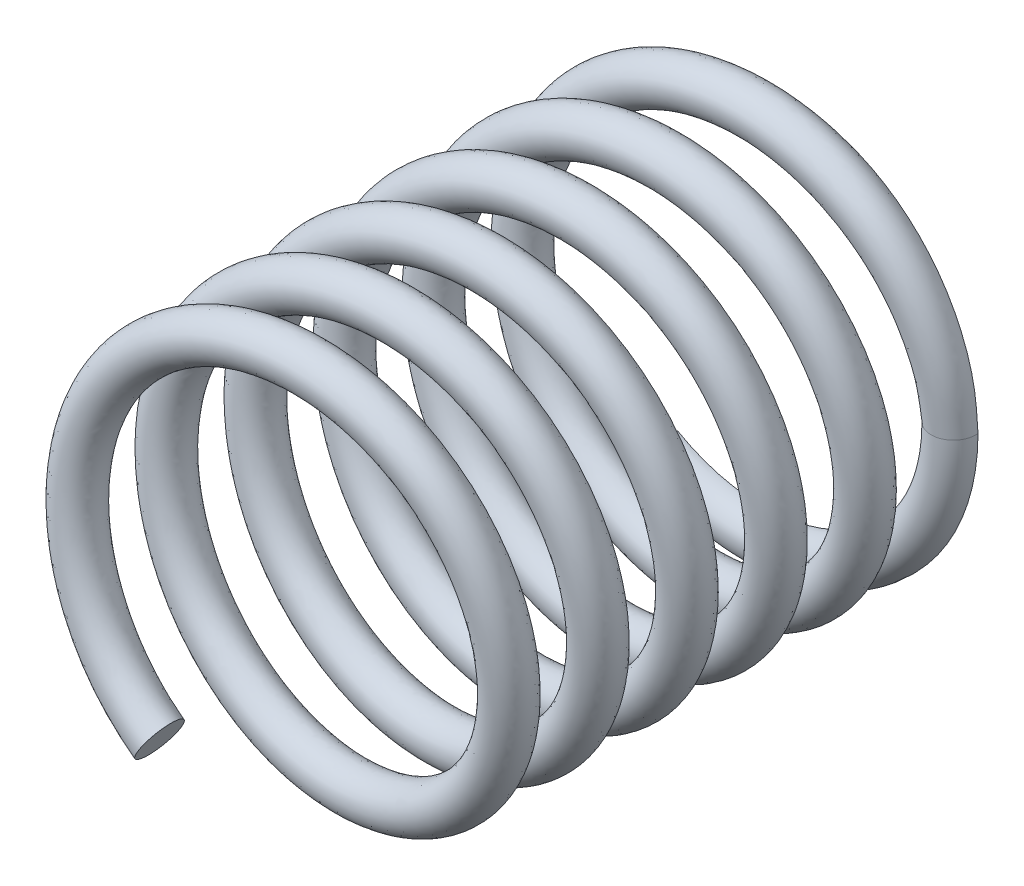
ISO-10303-21;
HEADER;
FILE_DESCRIPTION(('STEP AP214'),'2;1');
FILE_NAME('part.step','',(''),(''),'','','');
FILE_SCHEMA(('AUTOMOTIVE_DESIGN { 1 0 10303 214 1 1 1 1 }'));
ENDSEC;
DATA;
#1=APPLICATION_CONTEXT('core data for automotive mechanical design processes');
#2=APPLICATION_PROTOCOL_DEFINITION('international standard','automotive_design',2000,#1);
#3=PRODUCT_CONTEXT('',#1,'mechanical');
#4=PRODUCT('Part','Part','',(#3));
#5=PRODUCT_RELATED_PRODUCT_CATEGORY('part','',(#4));
#6=PRODUCT_DEFINITION_FORMATION('','',#4);
#7=PRODUCT_DEFINITION_CONTEXT('part definition',#1,'design');
#8=PRODUCT_DEFINITION('design','',#6,#7);
#9=PRODUCT_DEFINITION_SHAPE('','',#8);
#10=(LENGTH_UNIT() NAMED_UNIT(*) SI_UNIT(.MILLI.,.METRE.));
#11=(NAMED_UNIT(*) PLANE_ANGLE_UNIT() SI_UNIT($,.RADIAN.));
#12=(NAMED_UNIT(*) SI_UNIT($,.STERADIAN.) SOLID_ANGLE_UNIT());
#13=UNCERTAINTY_MEASURE_WITH_UNIT(LENGTH_MEASURE(1.E-05),#10,'distance_accuracy_value','');
#14=(GEOMETRIC_REPRESENTATION_CONTEXT(3) GLOBAL_UNCERTAINTY_ASSIGNED_CONTEXT((#13)) GLOBAL_UNIT_ASSIGNED_CONTEXT((#10,
#11,#12)) REPRESENTATION_CONTEXT('',''));
#15=CARTESIAN_POINT('',(0.,0.,0.));
#16=DIRECTION('',(0.,0.,1.));
#17=DIRECTION('',(1.,0.,0.));
#18=AXIS2_PLACEMENT_3D('',#15,#16,#17);
#19=CARTESIAN_POINT('',(6.5,0.,0.75));
#20=CARTESIAN_POINT('',(6.47803879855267,0.400819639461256,0.779446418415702));
#21=CARTESIAN_POINT('',(6.43402565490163,1.20411505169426,0.838460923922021));
#22=CARTESIAN_POINT('',(6.09077083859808,2.36877362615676,0.92702323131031));
#23=CARTESIAN_POINT('',(5.55180292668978,3.45210939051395,1.0156581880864));
#24=CARTESIAN_POINT('',(4.81980996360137,4.41698855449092,1.10417552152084));
#25=CARTESIAN_POINT('',(3.92231791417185,5.22874283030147,1.19270781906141));
#26=CARTESIAN_POINT('',(2.89150520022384,5.86322878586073,1.28123286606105));
#27=CARTESIAN_POINT('',(1.76058421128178,6.29519397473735,1.36980802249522));
#28=CARTESIAN_POINT('',(0.569789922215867,6.51242937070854,1.45832328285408));
#29=CARTESIAN_POINT('',(-0.640762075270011,6.50545141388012,1.54688530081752));
#30=CARTESIAN_POINT('',(-1.82922132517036,6.27588442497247,1.63540445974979));
#31=CARTESIAN_POINT('',(-2.95512377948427,5.83112363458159,1.7239692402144));
#32=CARTESIAN_POINT('',(-3.97933162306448,5.18600612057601,1.81249157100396));
#33=CARTESIAN_POINT('',(-4.86779587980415,4.36377561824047,1.90104849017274));
#34=CARTESIAN_POINT('',(-5.58820585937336,3.39102061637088,1.98957838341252));
#35=CARTESIAN_POINT('',(-6.1186037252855,2.3028796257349,2.07812763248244));
#36=CARTESIAN_POINT('',(-6.43715274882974,1.13504232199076,2.16666656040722));
#37=CARTESIAN_POINT('',(-6.53735656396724,-0.0713012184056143,2.25520603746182));
#38=CARTESIAN_POINT('',(-6.41081294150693,-1.27520680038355,2.34375453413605));
#39=CARTESIAN_POINT('',(-6.06701483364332,-2.43582376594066,2.43228490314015));
#40=CARTESIAN_POINT('',(-5.51278706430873,-3.51206521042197,2.52084187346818));
#41=CARTESIAN_POINT('',(-4.77158359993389,-4.46903238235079,2.6093648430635));
#42=CARTESIAN_POINT('',(-3.86513544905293,-5.27143453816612,2.69792788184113));
#43=CARTESIAN_POINT('',(-2.82732227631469,-5.89439460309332,2.7864463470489));
#44=CARTESIAN_POINT('',(-1.69182218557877,-6.31408899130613,2.8750122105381));
#45=CARTESIAN_POINT('',(-0.498714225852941,-6.51811167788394,2.96352965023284));
#46=CARTESIAN_POINT('',(0.711695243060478,-6.4982025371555,3.05209471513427));
#47=CARTESIAN_POINT('',(1.89753943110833,-6.25544558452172,3.14061474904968));
#48=CARTESIAN_POINT('',(3.01860851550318,-5.79865604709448,3.22917549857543));
#49=CARTESIAN_POINT('',(4.03560159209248,-5.14220099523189,3.31770140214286));
#50=CARTESIAN_POINT('',(4.91518269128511,-4.31049178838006,3.40625489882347));
#51=CARTESIAN_POINT('',(5.62479780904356,-3.32981635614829,3.49478913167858));
#52=CARTESIAN_POINT('',(6.14342757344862,-2.23603196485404,3.58333348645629));
#53=CARTESIAN_POINT('',(6.44911757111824,-1.06474431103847,3.67187724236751));
#54=CARTESIAN_POINT('',(6.53619781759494,0.142601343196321,3.76041204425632));
#55=CARTESIAN_POINT('',(6.3965364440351,1.34507008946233,3.84896500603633));
#56=CARTESIAN_POINT('',(6.04003785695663,2.5018348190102,3.93749136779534));
#57=CARTESIAN_POINT('',(5.47419946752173,3.57202699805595,4.02605173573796));
#58=CARTESIAN_POINT('',(4.72248528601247,4.52074942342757,4.11457204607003));
#59=CARTESIAN_POINT('',(3.80746018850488,5.31336082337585,4.20313693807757));
#60=CARTESIAN_POINT('',(2.76280784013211,5.92477832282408,4.29165443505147));
#61=CARTESIAN_POINT('',(1.62287840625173,6.33228183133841,4.38022035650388));
#62=CARTESIAN_POINT('',(0.427573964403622,6.52303938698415,4.4687386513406));
#63=CARTESIAN_POINT('',(-0.78254677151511,6.49017803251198,4.55730197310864));
#64=CARTESIAN_POINT('',(-1.96563038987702,6.23426179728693,4.64582457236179));
#65=CARTESIAN_POINT('',(-3.08173197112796,5.76549033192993,4.73438200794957));
#66=CARTESIAN_POINT('',(-4.0913981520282,5.09779625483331,4.82291183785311));
#67=CARTESIAN_POINT('',(-4.9619760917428,4.25668531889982,4.91146091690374));
#68=CARTESIAN_POINT('',(-5.66073777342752,3.26822675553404,4.999999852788));
#69=CARTESIAN_POINT('',(-6.1674919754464,2.16890628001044,5.08853938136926));
#70=CARTESIAN_POINT('',(-6.46033993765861,0.994324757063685,5.17708788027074));
#71=CARTESIAN_POINT('',(-6.53422990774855,-0.213884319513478,5.26561823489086));
#72=CARTESIAN_POINT('',(-6.38152240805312,-1.41477755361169,5.35417520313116));
#73=CARTESIAN_POINT('',(-6.01232098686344,-2.56753904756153,5.44269817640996));
#74=CARTESIAN_POINT('',(-5.43497604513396,-3.63157394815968,5.53126121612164));
#75=CARTESIAN_POINT('',(-4.67281556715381,-4.57191794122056,5.61977968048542));
#76=CARTESIAN_POINT('',(-3.7493384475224,-5.35466556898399,5.70834554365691));
#77=CARTESIAN_POINT('',(-2.69796356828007,-5.95445113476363,5.79686298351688));
#78=CARTESIAN_POINT('',(-1.5537413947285,-6.34972708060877,5.88542804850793));
#79=CARTESIAN_POINT('',(-0.356384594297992,-6.52719276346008,5.97394808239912));
#80=CARTESIAN_POINT('',(0.853306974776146,-6.48137921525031,6.06250883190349));
#81=CARTESIAN_POINT('',(2.0334887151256,-6.2123453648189,6.1510347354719));
#82=CARTESIAN_POINT('',(3.14448588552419,-5.73162881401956,6.23958823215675));
#83=CARTESIAN_POINT('',(4.14671672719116,-5.05279801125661,6.32812246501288));
#84=CARTESIAN_POINT('',(5.00816558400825,-4.20235871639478,6.41666681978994));
#85=CARTESIAN_POINT('',(5.69602419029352,-3.206260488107,6.50521057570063));
#86=CARTESIAN_POINT('',(6.19078938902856,-2.10150988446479,6.59374537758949));
#87=CARTESIAN_POINT('',(6.47081915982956,-0.923791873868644,6.6822983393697));
#88=CARTESIAN_POINT('',(6.53145690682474,0.285141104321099,6.77082470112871));
#89=CARTESIAN_POINT('',(6.36577003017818,1.48432092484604,6.85938506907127));
#90=CARTESIAN_POINT('',(5.98387194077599,2.63292977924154,6.94790537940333));
#91=CARTESIAN_POINT('',(5.3951186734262,3.69069787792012,7.0364702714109));
#92=CARTESIAN_POINT('',(4.62258367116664,4.62253453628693,7.1249877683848));
#93=CARTESIAN_POINT('',(3.69077480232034,5.39534140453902,7.2135536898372));
#94=CARTESIAN_POINT('',(2.63279896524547,5.98341306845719,7.30207198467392));
#95=CARTESIAN_POINT('',(1.4844181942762,6.36641916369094,7.39063530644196));
#96=CARTESIAN_POINT('',(0.285154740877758,6.53057499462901,7.4791579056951));
#97=CARTESIAN_POINT('',(-0.923966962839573,6.47180313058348,7.56771534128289));
#98=CARTESIAN_POINT('',(-2.10110764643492,6.1897021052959,7.65624517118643));
#99=CARTESIAN_POINT('',(-3.20686019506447,5.69707155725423,7.74479425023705));
#100=CARTESIAN_POINT('',(-4.20155413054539,5.00721490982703,7.83333318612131));
#101=CARTESIAN_POINT('',(-5.05373706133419,4.14751171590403,7.92187271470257));
#102=CARTESIAN_POINT('',(-5.73065467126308,3.14392602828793,8.01042121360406));
#103=CARTESIAN_POINT('',(-6.213320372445,2.03385273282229,8.09895156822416));
#104=CARTESIAN_POINT('',(-6.48055193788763,0.853153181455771,8.18750853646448));
#105=CARTESIAN_POINT('',(-6.52788373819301,-0.356362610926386,8.27603150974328));
#106=CARTESIAN_POINT('',(-6.34927832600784,-1.55369195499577,8.36459454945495));
#107=CARTESIAN_POINT('',(-5.95469833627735,-2.69800050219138,8.45311301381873));
#108=CARTESIAN_POINT('',(-5.35462915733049,-3.74939044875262,8.54167887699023));
#109=CARTESIAN_POINT('',(-4.57179868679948,-4.67259590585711,8.6301963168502));
#110=CARTESIAN_POINT('',(-3.63177388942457,-5.43538082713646,8.71876138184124));
#111=CARTESIAN_POINT('',(-2.56732337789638,-6.01166416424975,8.80728141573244));
#112=CARTESIAN_POINT('',(-1.41491598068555,-6.3823523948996,8.8958421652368));
#113=CARTESIAN_POINT('',(-0.213892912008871,-6.53318919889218,8.98436806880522));
#114=CARTESIAN_POINT('',(0.994517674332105,-6.46144681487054,9.07292156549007));
#115=CARTESIAN_POINT('',(2.16848040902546,-6.16633765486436,9.1614557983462));
#116=CARTESIAN_POINT('',(3.26884491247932,-5.66181898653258,9.25000015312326));
#117=CARTESIAN_POINT('',(4.25590622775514,-4.96105433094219,9.33854390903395));
#118=CARTESIAN_POINT('',(5.09868039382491,-4.09214800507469,9.42707871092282));
#119=CARTESIAN_POINT('',(5.76462558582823,-3.08123090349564,9.51563167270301));
#120=CARTESIAN_POINT('',(6.23508585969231,-1.96594483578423,9.60415803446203));
#121=CARTESIAN_POINT('',(6.48953477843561,-0.782416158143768,9.69271840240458));
#122=CARTESIAN_POINT('',(6.52351532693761,0.427539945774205,9.78123871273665));
#123=CARTESIAN_POINT('',(6.33204622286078,1.62288229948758,9.86980360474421));
#124=CARTESIAN_POINT('',(5.92480768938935,2.76274486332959,9.95832110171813));
#125=CARTESIAN_POINT('',(5.31350928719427,3.80764317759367,10.0468870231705));
#126=CARTESIAN_POINT('',(4.52046955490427,4.72209882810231,10.1354053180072));
#127=CARTESIAN_POINT('',(3.57234041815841,5.4747761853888,10.2239686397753));
#128=CARTESIAN_POINT('',(2.50154600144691,6.03920446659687,10.3124912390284));
#129=CARTESIAN_POINT('',(1.34524209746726,6.39752095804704,10.4010486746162));
#130=CARTESIAN_POINT('',(0.142607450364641,6.53503853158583,10.4895785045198));
#131=CARTESIAN_POINT('',(-1.06494963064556,6.45030688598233,10.5781275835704));
#132=CARTESIAN_POINT('',(-2.23560105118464,6.14225904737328,10.6666665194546));
#133=CARTESIAN_POINT('',(-3.3304268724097,5.62586602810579,10.7552060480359));
#134=CARTESIAN_POINT('',(-4.30976787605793,4.91432342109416,10.8437545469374));
#135=CARTESIAN_POINT('',(-5.14299270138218,4.0362771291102,10.9322849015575));
#136=CARTESIAN_POINT('',(-5.79793126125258,3.01818105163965,11.0208418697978));
#137=CARTESIAN_POINT('',(-6.25608736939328,1.89779641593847,11.1093648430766));
#138=CARTESIAN_POINT('',(-6.49776393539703,0.711588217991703,11.1979278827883));
#139=CARTESIAN_POINT('',(-6.51835660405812,-0.498664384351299,11.2864463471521));
#140=CARTESIAN_POINT('',(-6.31407256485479,-1.69188350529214,11.3750122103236));
#141=CARTESIAN_POINT('',(-5.89420741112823,-2.82715665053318,11.4635296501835));
#142=CARTESIAN_POINT('',(-5.27176085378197,-3.86544742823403,11.5520947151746));
#143=CARTESIAN_POINT('',(-4.46860507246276,-4.77104014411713,11.6406147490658));
#144=CARTESIAN_POINT('',(-3.51247918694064,-5.51351968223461,11.7291754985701));
#145=CARTESIAN_POINT('',(-2.43547589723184,-6.06603399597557,11.8177014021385));
#146=CARTESIAN_POINT('',(-1.27540404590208,-6.41191896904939,11.9062548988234));
#147=CARTESIAN_POINT('',(-0.071306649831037,-6.53612597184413,11.9947891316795));
#148=CARTESIAN_POINT('',(1.13525330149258,-6.43838032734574,12.0833334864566));
#149=CARTESIAN_POINT('',(2.30246316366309,-6.11747180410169,12.1718772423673));
#150=CARTESIAN_POINT('',(3.39159529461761,-5.58921268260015,12.2604120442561));
#151=CARTESIAN_POINT('',(4.36313308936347,-4.86702801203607,12.3489650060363));
#152=CARTESIAN_POINT('',(5.18667143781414,-3.97990881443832,12.4374913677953));
#153=CARTESIAN_POINT('',(5.83056585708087,-2.95478230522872,12.5260517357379));
#154=CARTESIAN_POINT('',(6.2763264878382,-1.82941751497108,12.61457204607));
#155=CARTESIAN_POINT('',(6.50523554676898,-0.640676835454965,12.7031369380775));
#156=CARTESIAN_POINT('',(6.51241245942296,0.569727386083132,12.7916544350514));
#157=CARTESIAN_POINT('',(6.29535613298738,1.76068698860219,12.8802203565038));
#158=CARTESIAN_POINT('',(5.86290480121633,2.89122977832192,12.9687386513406));
#159=CARTESIAN_POINT('',(5.22938566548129,3.92279440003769,13.0573019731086));
#160=CARTESIAN_POINT('',(4.41621389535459,4.81941675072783,13.1458245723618));
#161=CARTESIAN_POINT('',(3.45219510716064,5.55160334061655,13.2343820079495));
#162=CARTESIAN_POINT('',(2.36912198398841,6.09215286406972,13.3229118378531));
#163=CARTESIAN_POINT('',(1.20540957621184,6.42554000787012,13.4114609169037));
#164=CARTESIAN_POINT('',(-1.49109357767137E-06,6.53645609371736,13.499999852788));
#165=CARTESIAN_POINT('',(-1.20541805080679,6.4256578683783,13.5885393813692));
#166=CARTESIAN_POINT('',(-2.36905946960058,6.0919808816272,13.6770878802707));
#167=CARTESIAN_POINT('',(-3.45234420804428,5.55186693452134,13.7656182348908));
#168=CARTESIAN_POINT('',(-4.41599450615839,4.81917174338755,13.8541752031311));
#169=CARTESIAN_POINT('',(-5.22971453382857,3.92305318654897,13.9426981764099));
#170=CARTESIAN_POINT('',(-5.86252331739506,2.89104034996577,14.0312612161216));
#171=CARTESIAN_POINT('',(-6.29580486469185,1.76081801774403,14.1197796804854));
#172=CARTESIAN_POINT('',(-6.51194563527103,0.569689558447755,14.2083455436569));
#173=CARTESIAN_POINT('',(-6.50568773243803,-0.640720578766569,14.2968629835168));
#174=CARTESIAN_POINT('',(-6.27589565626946,-1.82928402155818,14.3854280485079));
#175=CARTESIAN_POINT('',(-5.83090704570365,-2.95495826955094,14.473948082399));
#176=CARTESIAN_POINT('',(-5.18638556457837,-3.97967512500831,14.5625088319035));
#177=CARTESIAN_POINT('',(-4.36330454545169,-4.86722556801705,14.6510347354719));
#178=CARTESIAN_POINT('',(-3.39149321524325,-5.58901906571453,14.7395882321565));
#179=CARTESIAN_POINT('',(-2.3024930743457,-6.11756103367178,14.8281224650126));
#180=CARTESIAN_POINT('',(-1.13526661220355,-6.43837798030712,14.9166668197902));
#181=CARTESIAN_POINT('',(0.0713090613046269,-6.53603189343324,15.0052105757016));
#182=CARTESIAN_POINT('',(1.27543374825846,-6.4121358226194,15.0937453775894));
#183=CARTESIAN_POINT('',(2.43538234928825,-6.06578971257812,15.1822983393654));
#184=CARTESIAN_POINT('',(3.51266789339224,-5.51383705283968,15.2708247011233));
#185=CARTESIAN_POINT('',(4.46834464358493,-4.77075809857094,15.3593850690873));
#186=CARTESIAN_POINT('',(5.27212004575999,-3.86572022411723,15.4479053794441));
#187=CARTESIAN_POINT('',(5.89379745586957,-2.82696088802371,15.5364702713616));
#188=CARTESIAN_POINT('',(6.31452417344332,-1.69200762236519,15.6249877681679));
#189=CARTESIAN_POINT('',(6.51789012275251,-0.498634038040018,15.7135536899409));
#190=CARTESIAN_POINT('',(6.49818720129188,0.711635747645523,15.8020719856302));
#191=CARTESIAN_POINT('',(6.25568981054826,1.89766571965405,15.8906353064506));
#192=CARTESIAN_POINT('',(5.79822122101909,3.0183362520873,15.9791579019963));
#193=CARTESIAN_POINT('',(5.14276249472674,4.036080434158,16.0677153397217));
#194=CARTESIAN_POINT('',(4.30988543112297,4.91446361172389,16.1562451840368));
#195=CARTESIAN_POINT('',(3.33037839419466,5.62575801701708,16.244794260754));
#196=CARTESIAN_POINT('',(2.23559824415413,6.14226028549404,16.3333331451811));
#197=CARTESIAN_POINT('',(1.06498238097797,6.45042149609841,16.4218726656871));
#198=CARTESIAN_POINT('',(-0.142607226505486,6.53485456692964,16.5104213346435));
#199=CARTESIAN_POINT('',(-1.34529177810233,6.39781606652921,16.5989517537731));
#200=CARTESIAN_POINT('',(-2.50142564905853,6.03890224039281,16.687508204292));
#201=CARTESIAN_POINT('',(-3.57256720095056,5.47514244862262,16.7760309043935));
#202=CARTESIAN_POINT('',(-4.52016795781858,4.72178283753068,16.8645954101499));
#203=CARTESIAN_POINT('',(-5.313853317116,3.80789649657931,16.9531147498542));
#204=CARTESIAN_POINT('',(-5.92440386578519,2.76256665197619,17.0416766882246));
#205=CARTESIAN_POINT('',(-6.33260379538,1.62302507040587,17.1301918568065));
#206=CARTESIAN_POINT('',(-6.52301737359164,0.427468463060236,17.2187672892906));
#207=CARTESIAN_POINT('',(-6.48959308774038,-0.782443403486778,17.3072919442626));
#208=CARTESIAN_POINT('',(-6.23484691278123,-1.96563514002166,17.3958249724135));
#209=CARTESIAN_POINT('',(-5.765579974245,-3.0815324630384,17.4843401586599));
#210=CARTESIAN_POINT('',(-5.09797767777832,-4.09263332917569,17.5729822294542));
#211=CARTESIAN_POINT('',(-4.25486215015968,-4.96096647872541,17.6615197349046));
#212=CARTESIAN_POINT('',(-3.59661837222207,-5.42889327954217,17.7205943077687));
#213=CARTESIAN_POINT('',(-3.24993433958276,-5.62905139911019,17.7499999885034));
#214=CARTESIAN_POINT('',(8.,0.,0.75));
#215=CARTESIAN_POINT('',(7.97295207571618,0.493790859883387,0.779474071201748));
#216=CARTESIAN_POINT('',(7.91874446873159,1.48341285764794,0.838543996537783));
#217=CARTESIAN_POINT('',(7.49731211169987,2.91277065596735,0.926948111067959));
#218=CARTESIAN_POINT('',(6.83246371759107,4.24994089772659,1.01627020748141));
#219=CARTESIAN_POINT('',(5.93260444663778,5.43560340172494,1.103905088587));
#220=CARTESIAN_POINT('',(4.82616965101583,6.43653315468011,1.19308333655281));
#221=CARTESIAN_POINT('',(3.56093396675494,7.21523217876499,1.28090952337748));
#222=CARTESIAN_POINT('',(2.16491457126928,7.74863220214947,1.37048079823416));
#223=CARTESIAN_POINT('',(0.703343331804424,8.01512891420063,1.45798266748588));
#224=CARTESIAN_POINT('',(-0.790784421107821,8.00660569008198,1.54745582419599));
#225=CARTESIAN_POINT('',(-2.2494462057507,7.72477534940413,1.63509786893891));
#226=CARTESIAN_POINT('',(-3.63881967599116,7.17597396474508,1.7245404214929));
#227=CARTESIAN_POINT('',(-4.89648252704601,6.38376586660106,1.81229025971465));
#228=CARTESIAN_POINT('',(-5.99209324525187,5.36979751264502,1.90148160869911));
#229=CARTESIAN_POINT('',(-6.87743679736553,4.17434793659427,1.98952237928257));
#230=CARTESIAN_POINT('',(-7.53079320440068,2.83382067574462,2.07837975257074));
#231=CARTESIAN_POINT('',(-7.92276623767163,1.39700622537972,2.16679821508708));
#232=CARTESIAN_POINT('',(-8.04597328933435,-0.0872066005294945,2.25521790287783));
#233=CARTESIAN_POINT('',(-7.89021161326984,-1.57032986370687,2.34407206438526));
#234=CARTESIAN_POINT('',(-7.46759523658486,-2.99662700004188,2.43210914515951));
#235=CARTESIAN_POINT('',(-6.78429262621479,-4.32389491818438,2.52130818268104));
#236=CARTESIAN_POINT('',(-5.87402862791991,-5.4989225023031,2.60907094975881));
#237=CARTESIAN_POINT('',(-4.75560388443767,-6.48919421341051,2.69849283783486));
#238=CARTESIAN_POINT('',(-3.48173292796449,-7.2537082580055,2.7861022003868));
#239=CARTESIAN_POINT('',(-2.08020057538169,-7.77186524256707,2.87562009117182));
#240=CARTESIAN_POINT('',(-0.615901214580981,-8.02216582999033,2.96319856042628));
#241=CARTESIAN_POINT('',(0.877999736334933,-7.9976576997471,3.05268457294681));
#242=CARTESIAN_POINT('',(2.33375040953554,-7.6995901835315,3.14035513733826));
#243=CARTESIAN_POINT('',(3.7167401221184,-7.13608085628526,3.22968170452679));
#244=CARTESIAN_POINT('',(4.96599562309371,-6.32968645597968,3.31756631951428));
#245=CARTESIAN_POINT('',(6.05013771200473,-5.3044901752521,3.40660784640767));
#246=CARTESIAN_POINT('',(6.92269785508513,-4.09867415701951,3.49482466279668));
#247=CARTESIAN_POINT('',(7.56114144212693,-2.75204742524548,3.58346480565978));
#248=CARTESIAN_POINT('',(7.93757563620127,-1.31005914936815,3.67210435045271));
#249=CARTESIAN_POINT('',(8.0445540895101,0.174494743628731,3.76032173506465));
#250=CARTESIAN_POINT('',(7.87256467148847,1.65667121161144,3.8493627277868));
#251=CARTESIAN_POINT('',(7.43452501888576,3.07759402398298,3.93724780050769));
#252=CARTESIAN_POINT('',(6.73664555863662,4.39789819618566,4.02657398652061));
#253=CARTESIAN_POINT('',(5.81372635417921,5.56248653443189,4.11424482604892));
#254=CARTESIAN_POINT('',(4.68449301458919,6.54084800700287,4.2037306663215));
#255=CARTESIAN_POINT('',(3.40235088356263,7.29113640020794,4.2913091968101));
#256=CARTESIAN_POINT('',(1.99533934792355,7.79421871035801,4.38082714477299));
#257=CARTESIAN_POINT('',(0.528216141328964,8.02827827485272,4.46843632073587));
#258=CARTESIAN_POINT('',(-0.96504926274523,7.98775983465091,4.55785848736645));
#259=CARTESIAN_POINT('',(-2.41780695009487,7.67347355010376,4.6456209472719));
#260=CARTESIAN_POINT('',(-3.79414503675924,7.09537497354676,4.73482049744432));
#261=CARTESIAN_POINT('',(-5.03496605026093,6.2748254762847,4.82285682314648));
#262=CARTESIAN_POINT('',(-6.10740772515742,5.2386037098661,4.91171122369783));
#263=CARTESIAN_POINT('',(-6.96716080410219,4.02250216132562,5.00013117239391));
#264=CARTESIAN_POINT('',(-7.59056795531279,2.66993739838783,5.08855171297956));
#265=CARTESIAN_POINT('',(-7.95145798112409,1.22298393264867,5.177405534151));
#266=CARTESIAN_POINT('',(-8.04215098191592,-0.261840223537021,5.26544238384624));
#267=CARTESIAN_POINT('',(-7.85400891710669,-1.74276742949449,5.35464146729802));
#268=CARTESIAN_POINT('',(-7.40052360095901,-3.15826080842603,5.44240430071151));
#269=CARTESIAN_POINT('',(-6.68824100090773,-4.47133558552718,5.53182618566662));
#270=CARTESIAN_POINT('',(-5.75267308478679,-5.62543332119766,5.61943553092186));
#271=CARTESIAN_POINT('',(-4.61288359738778,-6.59169392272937,5.70895342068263));
#272=CARTESIAN_POINT('',(-3.32250013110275,-7.32771941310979,5.79653189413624));
#273=CARTESIAN_POINT('',(-1.91031015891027,-7.81563351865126,5.88601790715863));
#274=CARTESIAN_POINT('',(-0.440406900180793,-8.03343772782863,5.97368847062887));
#275=CARTESIAN_POINT('',(1.05190986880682,-7.97692251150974,6.06301503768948));
#276=CARTESIAN_POINT('',(2.50162917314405,-7.64643018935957,6.15089965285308));
#277=CARTESIAN_POINT('',(3.87102727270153,-7.05385924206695,6.23994117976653));
#278=CARTESIAN_POINT('',(5.10337896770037,-6.21919597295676,6.32815799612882));
#279=CARTESIAN_POINT('',(6.16389316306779,-5.17214133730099,6.41679813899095));
#280=CARTESIAN_POINT('',(7.010814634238,-3.94586367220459,6.50543768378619));
#281=CARTESIAN_POINT('',(7.61908883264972,-2.58742811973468,6.59365506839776));
#282=CARTESIAN_POINT('',(7.96440585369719,-1.13581398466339,6.68269606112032));
#283=CARTESIAN_POINT('',(8.03876744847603,0.349235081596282,6.77058113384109));
#284=CARTESIAN_POINT('',(7.83454589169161,1.82860400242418,6.85990731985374));
#285=CARTESIAN_POINT('',(7.36559819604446,3.23861602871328,6.94757815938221));
#286=CARTESIAN_POINT('',(6.63908529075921,4.54419563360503,7.03706399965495));
#287=CARTESIAN_POINT('',(5.6908795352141,5.6877545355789,7.12464253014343));
#288=CARTESIAN_POINT('',(4.54078546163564,6.64172355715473,7.21416047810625));
#289=CARTESIAN_POINT('',(3.24219369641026,7.36345329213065,7.30176965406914));
#290=CARTESIAN_POINT('',(1.82512509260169,7.83610526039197,7.39119182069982));
#291=CARTESIAN_POINT('',(0.352487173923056,8.03764515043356,7.47895428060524));
#292=CARTESIAN_POINT('',(-1.13856892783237,7.96514553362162,7.56815383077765));
#293=CARTESIAN_POINT('',(-2.5852037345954,7.61846700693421,7.65619015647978));
#294=CARTESIAN_POINT('',(-3.94737797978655,7.01153371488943,7.74504455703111));
#295=CARTESIAN_POINT('',(-5.17121282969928,6.16282493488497,7.83346450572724));
#296=CARTESIAN_POINT('',(-6.21962832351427,5.10504761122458,7.92188504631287));
#297=CARTESIAN_POINT('',(-7.05364124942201,3.86878777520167,8.01073886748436));
#298=CARTESIAN_POINT('',(-7.64670456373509,2.50452830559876,8.09877571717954));
#299=CARTESIAN_POINT('',(-7.97641578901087,1.04856356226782,8.1879748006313));
#300=CARTESIAN_POINT('',(-8.03440623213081,-0.436666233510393,8.27573763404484));
#301=CARTESIAN_POINT('',(-7.81417755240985,-1.91416790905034,8.36515951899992));
#302=CARTESIAN_POINT('',(-7.32975595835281,-3.31864810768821,8.45276886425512));
#303=CARTESIAN_POINT('',(-6.58918477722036,-4.61646702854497,8.54228675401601));
#304=CARTESIAN_POINT('',(-5.62835649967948,-5.74944188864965,8.62986522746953));
#305=CARTESIAN_POINT('',(-4.46820845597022,-6.69092858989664,8.71935124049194));
#306=CARTESIAN_POINT('',(-3.16144463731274,-7.39833412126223,8.80702180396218));
#307=CARTESIAN_POINT('',(-1.73979623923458,-7.8556295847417,8.89634837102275));
#308=CARTESIAN_POINT('',(-0.264470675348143,-8.04090159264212,8.98423298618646));
#309=CARTESIAN_POINT('',(1.22501381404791,-7.95242878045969,9.07327451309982));
#310=CARTESIAN_POINT('',(2.66851725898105,-7.58959096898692,9.16149132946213));
#311=CARTESIAN_POINT('',(4.02318839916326,-6.96839867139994,9.25013147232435));
#312=CARTESIAN_POINT('',(5.23844591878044,-6.10573880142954,9.33877101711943));
#313=CARTESIAN_POINT('',(6.27464901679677,-5.03726896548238,9.42698840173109));
#314=CARTESIAN_POINT('',(7.09562214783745,-3.79130325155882,9.51602939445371));
#315=CARTESIAN_POINT('',(7.67341588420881,-2.42124676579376,9.60391446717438));
#316=CARTESIAN_POINT('',(7.98748436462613,-0.961246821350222,9.69324065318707));
#317=CARTESIAN_POINT('',(8.02907019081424,0.524120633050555,9.78091149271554));
#318=CARTESIAN_POINT('',(7.79290589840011,1.99944620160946,9.87039733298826));
#319=CARTESIAN_POINT('',(7.29300412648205,3.39834553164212,9.95797586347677));
#320=CARTESIAN_POINT('',(6.53854583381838,4.68813852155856,10.0474938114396));
#321=CARTESIAN_POINT('',(5.5651148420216,5.81048716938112,10.1351029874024));
#322=CARTESIAN_POINT('',(4.39516242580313,6.73930074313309,10.2245251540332));
#323=CARTESIAN_POINT('',(3.08026614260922,7.43235812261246,10.3122876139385));
#324=CARTESIAN_POINT('',(1.65433539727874,7.87420198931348,10.4014871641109));
#325=CARTESIAN_POINT('',(0.17637230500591,8.0432089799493,10.4895234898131));
#326=CARTESIAN_POINT('',(-1.31123619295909,7.93876927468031,10.5783778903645));
#327=CARTESIAN_POINT('',(-2.75154026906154,7.55982006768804,10.6667978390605));
#328=CARTESIAN_POINT('',(-4.0985097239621,6.9244137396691,10.7552183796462));
#329=CARTESIAN_POINT('',(-5.30505128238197,6.04795871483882,10.8440722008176));
#330=CARTESIAN_POINT('',(-6.32895272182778,4.9688137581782,10.9321090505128));
#331=CARTESIAN_POINT('',(-7.13674919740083,3.71342231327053,11.0213081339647));
#332=CARTESIAN_POINT('',(-7.69922089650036,2.33759673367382,11.1090709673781));
#333=CARTESIAN_POINT('',(-7.99760896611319,0.873876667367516,11.1984928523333));
#334=CARTESIAN_POINT('',(-8.02276208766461,-0.611584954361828,11.2861021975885));
#335=CARTESIAN_POINT('',(-7.77073302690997,-2.08442607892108,11.3756200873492));
#336=CARTESIAN_POINT('',(-7.25535000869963,-3.47769681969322,11.463198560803));
#337=CARTESIAN_POINT('',(-6.48717486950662,-4.75919892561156,11.5526845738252));
#338=CARTESIAN_POINT('',(-5.50116549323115,-5.87088223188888,11.6403551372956));
#339=CARTESIAN_POINT('',(-4.32165724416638,-6.78683179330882,11.7296817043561));
#340=CARTESIAN_POINT('',(-2.99867145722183,-7.46552159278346,11.8175663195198));
#341=CARTESIAN_POINT('',(-1.56875438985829,-7.89181804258,11.9066078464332));
#342=CARTESIAN_POINT('',(-0.0882070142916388,-8.04456928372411,11.9948246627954));
#343=CARTESIAN_POINT('',(1.39722773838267,-7.9241642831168,12.0834648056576));
#344=CARTESIAN_POINT('',(2.83424331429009,-7.5291717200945,12.1721043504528));
#345=CARTESIAN_POINT('',(4.17339392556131,-6.87954083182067,12.2603217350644));
#346=CARTESIAN_POINT('',(5.37100169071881,-5.9895053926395,12.349362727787));
#347=CARTESIAN_POINT('',(6.3825371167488,-4.89969051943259,12.4372478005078));
#348=CARTESIAN_POINT('',(7.17701434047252,-3.63515709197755,12.5265739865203));
#349=CARTESIAN_POINT('',(7.72411782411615,-2.25359144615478,12.6142448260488));
#350=CARTESIAN_POINT('',(8.00678704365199,-0.786465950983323,12.7037306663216));
#351=CARTESIAN_POINT('',(8.01548478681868,0.699045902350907,12.7913091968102));
#352=CARTESIAN_POINT('',(7.74766107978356,2.1690947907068,12.8808271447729));
#353=CARTESIAN_POINT('',(7.21680100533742,3.55669054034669,12.9684363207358));
#354=CARTESIAN_POINT('',(6.43507830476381,4.82963709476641,13.0578584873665));
#355=CARTESIAN_POINT('',(5.43651955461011,5.93061901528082,13.1456209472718));
#356=CARTESIAN_POINT('',(4.24770245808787,6.83351347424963,13.2348204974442));
#357=CARTESIAN_POINT('',(2.91667524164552,7.49782124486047,13.3228568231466));
#358=CARTESIAN_POINT('',(1.48306003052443,7.90847209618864,13.4117112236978));
#359=CARTESIAN_POINT('',(8.6564343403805E-06,8.04498932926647,13.5001311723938));
#360=CARTESIAN_POINT('',(-1.48305036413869,7.90859337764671,13.5885517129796));
#361=CARTESIAN_POINT('',(-2.91659383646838,7.49765657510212,13.6774055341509));
#362=CARTESIAN_POINT('',(-4.24783577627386,6.8337869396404,13.7654423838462));
#363=CARTESIAN_POINT('',(-5.43628532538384,5.93038752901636,13.854641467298));
#364=CARTESIAN_POINT('',(-6.43539589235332,4.82991103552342,13.9424043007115));
#365=CARTESIAN_POINT('',(-7.21641070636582,3.55651882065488,14.0318261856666));
#366=CARTESIAN_POINT('',(-7.74810470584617,2.16924437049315,14.1194355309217));
#367=CARTESIAN_POINT('',(-8.0150161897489,0.699027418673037,14.2089534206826));
#368=CARTESIAN_POINT('',(-8.00724122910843,-0.786490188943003,14.2965318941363));
#369=CARTESIAN_POINT('',(-7.72369225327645,-2.2534396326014,14.3860179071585));
#370=CARTESIAN_POINT('',(-7.17736460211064,-3.63531530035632,14.4736884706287));
#371=CARTESIAN_POINT('',(-6.38226260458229,-4.89944192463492,14.5630150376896));
#372=CARTESIAN_POINT('',(-5.37118820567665,-5.98968950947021,14.6508996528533));
#373=CARTESIAN_POINT('',(-4.17330766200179,-6.87933757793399,14.7399411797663));
#374=CARTESIAN_POINT('',(-2.83429221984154,-7.52925381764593,14.8281579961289));
#375=CARTESIAN_POINT('',(-1.39725920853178,-7.92415873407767,14.9167981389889));
#376=CARTESIAN_POINT('',(0.088189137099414,-8.04447541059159,15.005437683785));
#377=CARTESIAN_POINT('',(1.56876593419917,-7.89203854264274,15.0936550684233));
#378=CARTESIAN_POINT('',(2.99855916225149,-7.46528478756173,15.1826960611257));
#379=CARTESIAN_POINT('',(4.32183017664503,-6.78715928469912,15.2705811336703));
#380=CARTESIAN_POINT('',(5.50089046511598,-5.87061376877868,15.359907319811));
#381=CARTESIAN_POINT('',(6.48752285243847,-4.7594871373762,15.447578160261));
#382=CARTESIAN_POINT('',(7.25493150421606,-3.47751869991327,15.5370640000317));
#383=CARTESIAN_POINT('',(7.77117968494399,-2.08456897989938,15.6246425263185));
#384=CARTESIAN_POINT('',(8.02229405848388,-0.611573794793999,15.7141604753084));
#385=CARTESIAN_POINT('',(7.99803446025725,0.873904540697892,15.8017696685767));
#386=CARTESIAN_POINT('',(7.69882874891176,2.3374479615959,15.8911918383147));
#387=CARTESIAN_POINT('',(7.13704847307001,3.7135597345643,15.9789542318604));
#388=CARTESIAN_POINT('',(6.32873399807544,4.96860235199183,16.0681537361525));
#389=CARTESIAN_POINT('',(5.30518408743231,6.04808557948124,16.1561902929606));
#390=CARTESIAN_POINT('',(4.09847709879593,6.92429631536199,16.2450450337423));
#391=CARTESIAN_POINT('',(2.75155666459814,7.55981431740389,16.333464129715));
#392=CARTESIAN_POINT('',(1.31128690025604,7.93888099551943,16.4218831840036));
#393=CARTESIAN_POINT('',(-0.176352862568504,8.04302538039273,16.510739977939));
#394=CARTESIAN_POINT('',(-1.65436541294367,7.87450097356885,16.5987812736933));
#395=CARTESIAN_POINT('',(-3.08012197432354,7.43206571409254,16.6879721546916));
#396=CARTESIAN_POINT('',(-4.39537808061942,6.73967606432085,16.7757223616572));
#397=CARTESIAN_POINT('',(-5.56481727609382,5.81016717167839,16.8651646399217));
#398=CARTESIAN_POINT('',(-6.53886971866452,4.68841307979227,16.9528068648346));
#399=CARTESIAN_POINT('',(-7.2925446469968,3.39827103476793,17.0422799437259));
#400=CARTESIAN_POINT('',(-7.79349204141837,1.99961168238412,17.1297817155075));
#401=CARTESIAN_POINT('',(-8.02854961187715,0.523714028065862,17.2193532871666));
#402=CARTESIAN_POINT('',(-7.98768554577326,-0.961165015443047,17.3071790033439));
#403=CARTESIAN_POINT('',(-7.67269823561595,-2.42047340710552,17.3963582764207));
#404=CARTESIAN_POINT('',(-7.09946791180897,-3.78998300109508,17.4839899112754));
#405=CARTESIAN_POINT('',(-6.26263456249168,-5.04507880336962,17.5733232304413));
#406=CARTESIAN_POINT('',(-5.27545103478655,-6.08339191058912,17.6616872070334));
#407=CARTESIAN_POINT('',(-4.34665518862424,-6.7279101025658,17.7208552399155));
#408=CARTESIAN_POINT('',(-3.99995103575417,-6.92807983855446,17.7502626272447));
#409=CARTESIAN_POINT('',(8.,0.,-0.75));
#410=CARTESIAN_POINT('',(7.97297969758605,0.49379359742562,-0.720525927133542));
#411=CARTESIAN_POINT('',(7.91882744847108,1.48342108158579,-0.661455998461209));
#412=CARTESIAN_POINT('',(7.49723522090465,2.91277308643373,-0.573051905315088));
#413=CARTESIAN_POINT('',(6.83298316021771,4.25025413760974,-0.483729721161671));
#414=CARTESIAN_POINT('',(5.93240777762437,5.43542817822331,-0.396094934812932));
#415=CARTESIAN_POINT('',(4.8263973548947,6.43682450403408,-0.306916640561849));
#416=CARTESIAN_POINT('',(3.56078166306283,7.21495599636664,-0.219090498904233));
#417=CARTESIAN_POINT('',(2.16509163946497,7.74927322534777,-0.129519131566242));
#418=CARTESIAN_POINT('',(0.70331340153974,8.0147988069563,-0.042017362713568));
#419=CARTESIAN_POINT('',(-0.790844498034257,8.00716571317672,0.0474558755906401));
#420=CARTESIAN_POINT('',(-2.24936015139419,7.72449000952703,0.135097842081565));
#421=CARTESIAN_POINT('',(-3.63908648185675,7.17647217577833,0.224540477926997));
#422=CARTESIAN_POINT('',(-4.89635885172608,6.3836157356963,0.312290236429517));
#423=CARTESIAN_POINT('',(-5.99242339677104,5.37007225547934,0.401481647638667));
#424=CARTESIAN_POINT('',(-6.87738836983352,4.17432785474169,0.489522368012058));
#425=CARTESIAN_POINT('',(-7.5310346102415,2.8338926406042,0.578379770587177));
#426=CARTESIAN_POINT('',(-7.92289544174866,1.39703592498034,0.666798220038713));
#427=CARTESIAN_POINT('',(-8.04598732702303,-0.0872241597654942,0.755217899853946));
#428=CARTESIAN_POINT('',(-7.89052191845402,-1.57038371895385,0.844072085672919));
#429=CARTESIAN_POINT('',(-7.46743123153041,-2.99657828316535,0.932109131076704));
#430=CARTESIAN_POINT('',(-6.78468486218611,-4.32413701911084,1.02130821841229));
#431=CARTESIAN_POINT('',(-5.87381171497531,-5.49873540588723,1.10907092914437));
#432=CARTESIAN_POINT('',(-4.75593589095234,-6.48964255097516,1.19849288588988));
#433=CARTESIAN_POINT('',(-3.48158266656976,-7.25340850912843,1.28610217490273));
#434=CARTESIAN_POINT('',(-2.08035295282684,-7.7724458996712,1.37562014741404));
#435=CARTESIAN_POINT('',(-0.615876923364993,-8.02184463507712,1.46319853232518));
#436=CARTESIAN_POINT('',(0.878072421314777,-7.99823617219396,1.55268463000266));
#437=CARTESIAN_POINT('',(2.33367235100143,-7.69935081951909,1.64035511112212));
#438=CARTESIAN_POINT('',(3.71698425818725,-7.13651865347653,1.72968175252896));
#439=CARTESIAN_POINT('',(4.96590966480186,-6.32958940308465,1.81756630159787));
#440=CARTESIAN_POINT('',(6.05041252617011,-5.30470843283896,1.90660787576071));
#441=CARTESIAN_POINT('',(6.92272685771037,-4.09869984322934,1.99482465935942));
#442=CARTESIAN_POINT('',(7.56127161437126,-2.75207595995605,2.08346481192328));
#443=CARTESIAN_POINT('',(7.93779752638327,-1.31010313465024,2.17210436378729));
#444=CARTESIAN_POINT('',(8.0444673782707,0.174509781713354,2.26032172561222));
#445=CARTESIAN_POINT('',(7.87295134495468,1.6567448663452,2.3493627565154));
#446=CARTESIAN_POINT('',(7.43430075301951,3.07751639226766,2.43724778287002));
#447=CARTESIAN_POINT('',(6.73708025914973,4.39817599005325,2.52657402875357));
#448=CARTESIAN_POINT('',(5.81348990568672,5.56227252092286,2.61424480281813));
#449=CARTESIAN_POINT('',(4.6848344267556,6.54132459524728,2.70373071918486));
#450=CARTESIAN_POINT('',(3.40220635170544,7.29083288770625,2.79130916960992));
#451=CARTESIAN_POINT('',(1.99548213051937,7.79480089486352,2.88082720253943));
#452=CARTESIAN_POINT('',(0.528199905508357,8.02798496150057,2.96843629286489));
#453=CARTESIAN_POINT('',(-0.965127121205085,7.98830478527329,3.05785854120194));
#454=CARTESIAN_POINT('',(-2.41774128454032,7.67328800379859,3.14562092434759));
#455=CARTESIAN_POINT('',(-3.79436412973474,7.09575065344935,3.23482053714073));
#456=CARTESIAN_POINT('',(-5.03492810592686,6.27479074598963,3.32285681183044));
#457=CARTESIAN_POINT('',(-6.10760849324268,5.23875281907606,3.41171124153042));
#458=CARTESIAN_POINT('',(-6.96727174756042,4.02257413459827,3.50013117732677));
#459=CARTESIAN_POINT('',(-7.59058760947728,2.66992580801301,3.58855170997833));
#460=CARTESIAN_POINT('',(-7.95176811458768,1.22303946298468,3.67740555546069));
#461=CARTESIAN_POINT('',(-8.04198011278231,-0.261850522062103,3.76544236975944));
#462=CARTESIAN_POINT('',(-7.85446025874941,-1.74286076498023,3.85464150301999));
#463=CARTESIAN_POINT('',(-7.40025579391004,-3.1581591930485,3.94240428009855));
#464=CARTESIAN_POINT('',(-6.68870633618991,-4.47164334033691,4.03182623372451));
#465=CARTESIAN_POINT('',(-5.75242936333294,-5.62520303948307,4.11943550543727));
#466=CARTESIAN_POINT('',(-4.61322537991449,-6.59218744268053,4.20895347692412));
#467=CARTESIAN_POINT('',(-3.32236744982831,-7.3274258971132,4.29653186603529));
#468=CARTESIAN_POINT('',(-1.91043970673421,-7.81620196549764,4.38601796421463));
#469=CARTESIAN_POINT('',(-0.440398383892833,-8.03318610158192,4.47368844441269));
#470=CARTESIAN_POINT('',(1.05198954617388,-7.97741740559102,4.56301508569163));
#471=CARTESIAN_POINT('',(2.50158159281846,-7.64630959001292,4.65089963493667));
#472=CARTESIAN_POINT('',(3.87121086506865,-7.054158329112,4.73994120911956));
#473=CARTESIAN_POINT('',(5.10339743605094,-6.21923002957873,4.82815799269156));
#474=CARTESIAN_POINT('',(6.16400572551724,-5.17221267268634,4.91679814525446));
#475=CARTESIAN_POINT('',(7.01100809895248,-3.94598089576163,5.00543769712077));
#476=CARTESIAN_POINT('',(7.61901249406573,-2.58738433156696,5.09365505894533));
#477=CARTESIAN_POINT('',(7.96479439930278,-1.13587702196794,5.18269608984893));
#478=CARTESIAN_POINT('',(8.03853015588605,0.349238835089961,5.27058111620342));
#479=CARTESIAN_POINT('',(7.83504938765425,1.82871636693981,5.35990736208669));
#480=CARTESIAN_POINT('',(7.36530281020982,3.23849579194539,5.44757813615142));
#481=CARTESIAN_POINT('',(6.63956911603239,4.54452671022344,5.53706405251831));
#482=CARTESIAN_POINT('',(5.6906399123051,5.68751875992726,5.62464250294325));
#483=CARTESIAN_POINT('',(4.5411187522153,6.64222179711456,5.7141605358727));
#484=CARTESIAN_POINT('',(3.24207812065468,7.3631832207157,5.80176962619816));
#485=CARTESIAN_POINT('',(1.82523831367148,7.83664397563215,5.89119187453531));
#486=CARTESIAN_POINT('',(0.352485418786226,8.03744833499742,5.97895425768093));
#487=CARTESIAN_POINT('',(-1.13864631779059,7.96557349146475,6.06815387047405));
#488=CARTESIAN_POINT('',(-2.58517995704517,7.61842139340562,6.15619014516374));
#489=CARTESIAN_POINT('',(-3.94751564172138,7.011742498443,6.24504457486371));
#490=CARTESIAN_POINT('',(-5.1712924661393,6.16293051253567,6.3334645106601));
#491=CARTESIAN_POINT('',(-6.21965075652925,5.10504344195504,6.42188504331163));
#492=CARTESIAN_POINT('',(-7.05391368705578,3.86894602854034,6.51073888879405));
#493=CARTESIAN_POINT('',(-7.64654752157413,2.50446018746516,6.59877570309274));
#494=CARTESIAN_POINT('',(-7.97687183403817,1.04863022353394,6.68797483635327));
#495=CARTESIAN_POINT('',(-8.03411982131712,-0.436662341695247,6.77573761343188));
#496=CARTESIAN_POINT('',(-7.81472008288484,-1.91429794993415,6.86515956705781));
#497=CARTESIAN_POINT('',(-7.32944817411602,-3.31851507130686,6.95276883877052));
#498=CARTESIAN_POINT('',(-6.58967474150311,-4.61681388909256,7.0422868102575));
#499=CARTESIAN_POINT('',(-5.62813143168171,-5.74921145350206,7.12986519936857));
#500=CARTESIAN_POINT('',(-4.46852461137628,-6.69141844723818,7.21935129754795));
#501=CARTESIAN_POINT('',(-3.16135057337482,-7.39810058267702,7.307021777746));
#502=CARTESIAN_POINT('',(-1.73989063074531,-7.85612188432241,7.3963484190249));
#503=CARTESIAN_POINT('',(-0.264474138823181,-8.04077199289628,7.48423296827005));
#504=CARTESIAN_POINT('',(1.22508404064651,-7.95277262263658,7.57327454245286));
#505=CARTESIAN_POINT('',(2.66852296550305,-7.58962928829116,7.66149132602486));
#506=CARTESIAN_POINT('',(4.02326977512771,-6.96850420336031,7.75013147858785));
#507=CARTESIAN_POINT('',(5.23858762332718,-6.10591512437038,7.838771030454));
#508=CARTESIAN_POINT('',(6.27459225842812,-5.03720170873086,7.92698839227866));
#509=CARTESIAN_POINT('',(7.09596570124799,-3.79149537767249,8.01602942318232));
#510=CARTESIAN_POINT('',(7.67319418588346,-2.42116207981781,8.10391444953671));
#511=CARTESIAN_POINT('',(7.98799592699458,-0.96131343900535,8.19324069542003));
#512=CARTESIAN_POINT('',(8.02875149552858,0.524108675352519,8.28091146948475));
#513=CARTESIAN_POINT('',(7.79347378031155,1.99959183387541,8.37039738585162));
#514=CARTESIAN_POINT('',(7.29269831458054,3.39820593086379,8.45797583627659));
#515=CARTESIAN_POINT('',(6.53902943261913,4.68849272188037,8.54749386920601));
#516=CARTESIAN_POINT('',(5.56491386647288,5.81027291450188,8.63510295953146));
#517=CARTESIAN_POINT('',(4.39545307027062,6.73976824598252,8.72452520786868));
#518=CARTESIAN_POINT('',(3.08019717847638,7.43217377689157,8.81228759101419));
#519=CARTESIAN_POINT('',(1.65440904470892,7.8746306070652,8.9014872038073));
#520=CARTESIAN_POINT('',(0.176379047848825,8.04315798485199,8.98952347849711));
#521=CARTESIAN_POINT('',(-1.31129414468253,7.93901255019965,9.07837790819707));
#522=CARTESIAN_POINT('',(-2.75157899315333,7.55994651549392,9.1667978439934));
#523=CARTESIAN_POINT('',(-4.09853223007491,6.92441749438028,9.25521837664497));
#524=CARTESIAN_POINT('',(-5.30525316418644,6.04820060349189,9.34407222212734));
#525=CARTESIAN_POINT('',(-6.32882844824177,4.9686960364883,9.43210903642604));
#526=CARTESIAN_POINT('',(-7.13715494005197,3.71364093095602,9.52130816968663));
#527=CARTESIAN_POINT('',(-7.69895042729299,2.33750243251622,9.60907094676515));
#528=CARTESIAN_POINT('',(-7.99816325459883,0.873940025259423,9.69849290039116));
#529=CARTESIAN_POINT('',(-8.02242736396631,-0.611565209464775,9.78610217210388));
#530=CARTESIAN_POINT('',(-7.77131207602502,-2.08458444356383,9.87562014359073));
#531=CARTESIAN_POINT('',(-7.25505970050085,-3.47755725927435,9.96319853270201));
#532=CARTESIAN_POINT('',(-6.4876394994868,-4.75955110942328,10.0526846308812));
#533=CARTESIAN_POINT('',(-5.50099722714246,-5.87069494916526,10.1403551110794));
#534=CARTESIAN_POINT('',(-4.32191431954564,-6.78726211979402,10.2296817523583));
#535=CARTESIAN_POINT('',(-2.99863038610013,-7.46539862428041,10.3175663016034));
#536=CARTESIAN_POINT('',(-1.56880599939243,-7.89216516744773,10.4066078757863));
#537=CARTESIAN_POINT('',(-0.0882147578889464,-8.04460724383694,10.4948246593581));
#538=CARTESIAN_POINT('',(1.39726811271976,-7.92429128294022,10.5834648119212));
#539=CARTESIAN_POINT('',(2.83431616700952,-7.5293858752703,10.6721043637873));
#540=CARTESIAN_POINT('',(4.17336359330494,-6.87945821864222,10.760321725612));
#541=CARTESIAN_POINT('',(5.37125881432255,-5.98980343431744,10.8493627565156));
#542=CARTESIAN_POINT('',(6.38235775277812,-4.89953511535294,10.9372477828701));
#543=CARTESIAN_POINT('',(7.1774722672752,-3.63539465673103,11.0265740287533));
#544=CARTESIAN_POINT('',(7.72381425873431,-2.25349368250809,11.114244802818));
#545=CARTESIAN_POINT('',(8.00737048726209,-0.786523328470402,11.2037307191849));
#546=CARTESIAN_POINT('',(8.01514967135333,0.699019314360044,11.29130916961));
#547=CARTESIAN_POINT('',(7.74823665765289,2.16926222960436,11.3808272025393));
#548=CARTESIAN_POINT('',(7.21653887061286,3.55655794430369,11.4684362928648));
#549=CARTESIAN_POINT('',(6.43551131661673,4.82997699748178,11.557858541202));
#550=CARTESIAN_POINT('',(5.43639169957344,5.93046937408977,11.6456209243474));
#551=CARTESIAN_POINT('',(4.24791825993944,6.83389105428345,11.7348205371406));
#552=CARTESIAN_POINT('',(2.9166641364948,7.49777101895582,11.8228568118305));
#553=CARTESIAN_POINT('',(1.48308877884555,7.90872052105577,11.9117112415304));
#554=CARTESIAN_POINT('',(1.55153877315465E-05,8.04512139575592,12.0001311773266));
#555=CARTESIAN_POINT('',(-1.48307022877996,7.90860460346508,12.0885517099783));
#556=CARTESIAN_POINT('',(-2.91670081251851,7.49795292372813,12.1774055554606));
#557=CARTESIAN_POINT('',(-4.24775926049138,6.83363381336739,12.2654423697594));
#558=CARTESIAN_POINT('',(-5.43659182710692,5.93073173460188,12.3546415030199));
#559=CARTESIAN_POINT('',(-6.43517398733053,4.82972991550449,12.4424042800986));
#560=CARTESIAN_POINT('',(-7.21690989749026,3.55676793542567,12.5318262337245));
#561=CARTESIAN_POINT('',(-7.74778341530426,2.16914844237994,12.6194355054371));
#562=CARTESIAN_POINT('',(-8.01561448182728,0.699076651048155,12.7089534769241));
#563=CARTESIAN_POINT('',(-8.0069206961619,-0.786458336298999,12.7965318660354));
#564=CARTESIAN_POINT('',(-7.72424931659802,-2.25361166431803,12.8860179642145));
#565=CARTESIAN_POINT('',(-7.17714242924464,-3.63519686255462,12.9736884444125));
#566=CARTESIAN_POINT('',(-6.38265135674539,-4.89975837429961,13.0630150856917));
#567=CARTESIAN_POINT('',(-5.3711075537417,-5.98958800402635,13.1508996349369));
#568=CARTESIAN_POINT('',(-4.17347488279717,-6.87964611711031,13.2399412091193));
#569=CARTESIAN_POINT('',(-2.83431247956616,-7.52928684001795,13.3281579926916));
#570=CARTESIAN_POINT('',(-1.39726470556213,-7.92429188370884,13.4167981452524));
#571=CARTESIAN_POINT('',(0.0881843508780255,-8.04470156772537,13.5054376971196));
#572=CARTESIAN_POINT('',(1.56876568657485,-7.8919505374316,13.5936550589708));
#573=CARTESIAN_POINT('',(2.99869884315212,-7.46565279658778,13.6826960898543));
#574=CARTESIAN_POINT('',(4.32171478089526,-6.78695190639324,13.7705811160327));
#575=CARTESIAN_POINT('',(5.50123952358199,-5.8709936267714,13.859907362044));
#576=CARTESIAN_POINT('',(6.48727103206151,-4.75929144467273,13.9475781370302));
#577=CARTESIAN_POINT('',(7.25546013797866,-3.47777216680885,14.0370640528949));
#578=CARTESIAN_POINT('',(7.77085568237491,-2.08447934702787,14.1246424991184));
#579=CARTESIAN_POINT('',(8.02289218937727,-0.611613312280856,14.2141605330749));
#580=CARTESIAN_POINT('',(7.99774279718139,0.87386959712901,14.3017696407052));
#581=CARTESIAN_POINT('',(7.69935191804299,2.3376192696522,14.3911918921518));
#582=CARTESIAN_POINT('',(7.13687710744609,3.71346282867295,14.4789542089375));
#583=CARTESIAN_POINT('',(6.32906584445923,4.96888330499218,14.5681537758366));
#584=CARTESIAN_POINT('',(5.30515656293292,6.04804226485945,14.6561902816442));
#585=CARTESIAN_POINT('',(4.09858936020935,6.92452030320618,14.7450450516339));
#586=CARTESIAN_POINT('',(2.75160812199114,7.55993577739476,14.833464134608));
#587=CARTESIAN_POINT('',(1.31127164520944,7.9388965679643,14.9218831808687));
#588=CARTESIAN_POINT('',(-0.176351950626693,8.04334143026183,15.0107399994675));
#589=CARTESIAN_POINT('',(-1.65434667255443,7.87433623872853,15.09878125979));
#590=CARTESIAN_POINT('',(-3.08029148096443,7.43249181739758,15.1879721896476));
#591=CARTESIAN_POINT('',(-4.3952240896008,6.73941730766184,15.2757223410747));
#592=CARTESIAN_POINT('',(-5.56520427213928,5.81057493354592,15.3651646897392));
#593=CARTESIAN_POINT('',(-6.53862925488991,4.68823521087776,15.4528068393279));
#594=CARTESIAN_POINT('',(-7.29308504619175,3.39852147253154,15.5422799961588));
#595=CARTESIAN_POINT('',(-7.79310415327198,1.99951045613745,15.6297816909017));
#596=CARTESIAN_POINT('',(-8.02912856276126,0.523737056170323,15.7193533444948));
#597=CARTESIAN_POINT('',(-7.9875816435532,-0.961144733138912,15.8071789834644));
#598=CARTESIAN_POINT('',(-7.67320021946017,-2.42063595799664,15.896358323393));
#599=CARTESIAN_POINT('',(-7.09916992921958,-3.78981306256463,15.9839898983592));
#600=CARTESIAN_POINT('',(-6.2628768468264,-5.04531619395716,16.0733232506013));
#601=CARTESIAN_POINT('',(-5.2755735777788,-6.08351017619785,16.1616872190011));
#602=CARTESIAN_POINT('',(-4.3467865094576,-6.72813755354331,16.2208552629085));
#603=CARTESIAN_POINT('',(-4.00008235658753,-6.92830728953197,16.2502626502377));
#604=CARTESIAN_POINT('',(6.5,0.,-0.75));
#605=CARTESIAN_POINT('',(6.47806642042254,0.400822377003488,-0.720553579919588));
#606=CARTESIAN_POINT('',(6.43410863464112,1.20412327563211,-0.661539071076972));
#607=CARTESIAN_POINT('',(6.09069394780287,2.36877605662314,-0.572976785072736));
#608=CARTESIAN_POINT('',(5.55232236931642,3.4524226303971,-0.48434174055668));
#609=CARTESIAN_POINT('',(4.81961329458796,4.41681333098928,-0.395824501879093));
#610=CARTESIAN_POINT('',(3.92254561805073,5.22903417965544,-0.307292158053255));
#611=CARTESIAN_POINT('',(2.89135289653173,5.86295260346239,-0.218767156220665));
#612=CARTESIAN_POINT('',(1.76076127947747,6.29583499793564,-0.130191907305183));
#613=CARTESIAN_POINT('',(0.569759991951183,6.51209926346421,-0.0416767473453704));
#614=CARTESIAN_POINT('',(-0.640822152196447,6.50601143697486,0.0468853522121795));
#615=CARTESIAN_POINT('',(-1.82913527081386,6.27559908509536,0.135404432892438));
#616=CARTESIAN_POINT('',(-2.95539058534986,5.83162184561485,0.223969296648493));
#617=CARTESIAN_POINT('',(-3.97920794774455,5.18585598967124,0.312491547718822));
#618=CARTESIAN_POINT('',(-4.86812603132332,4.36405036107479,0.401048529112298));
#619=CARTESIAN_POINT('',(-5.58815743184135,3.3910005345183,0.48957837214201));
#620=CARTESIAN_POINT('',(-6.11884513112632,2.30295159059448,0.578127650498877));
#621=CARTESIAN_POINT('',(-6.43728195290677,1.13507202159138,0.66666656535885));
#622=CARTESIAN_POINT('',(-6.53737060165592,-0.071318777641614,0.755206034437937));
#623=CARTESIAN_POINT('',(-6.41112324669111,-1.27526065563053,0.843754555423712));
#624=CARTESIAN_POINT('',(-6.06685082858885,-2.43577504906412,0.932284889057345));
#625=CARTESIAN_POINT('',(-5.51317930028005,-3.51230731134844,1.02084190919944));
#626=CARTESIAN_POINT('',(-4.77136668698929,-4.46884528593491,1.10936482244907));
#627=CARTESIAN_POINT('',(-3.8654674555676,-5.27188287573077,1.19792792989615));
#628=CARTESIAN_POINT('',(-2.82717201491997,-5.89409485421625,1.28644632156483));
#629=CARTESIAN_POINT('',(-1.69197456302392,-6.31466964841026,1.37501226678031));
#630=CARTESIAN_POINT('',(-0.498689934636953,-6.51779048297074,1.46352962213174));
#631=CARTESIAN_POINT('',(0.711767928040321,-6.49878100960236,1.55209477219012));
#632=CARTESIAN_POINT('',(1.89746137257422,-6.25520622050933,1.64061472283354));
#633=CARTESIAN_POINT('',(3.01885265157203,-5.79909384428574,1.7291755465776));
#634=CARTESIAN_POINT('',(4.03551563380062,-5.14210394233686,1.81770138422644));
#635=CARTESIAN_POINT('',(4.91545750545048,-4.31071004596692,1.9062549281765));
#636=CARTESIAN_POINT('',(5.6248268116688,-3.32984204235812,1.99478912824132));
#637=CARTESIAN_POINT('',(6.14355774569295,-2.23606049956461,2.0833334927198));
#638=CARTESIAN_POINT('',(6.44933946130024,-1.06478829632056,2.17187725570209));
#639=CARTESIAN_POINT('',(6.53611110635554,0.142616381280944,2.26041203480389));
#640=CARTESIAN_POINT('',(6.3969231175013,1.3451437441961,2.34896503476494));
#641=CARTESIAN_POINT('',(6.03981359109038,2.50175718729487,2.43749135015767));
#642=CARTESIAN_POINT('',(5.47463416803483,3.57230479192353,2.52605177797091));
#643=CARTESIAN_POINT('',(4.72224883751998,4.52053540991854,2.61457202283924));
#644=CARTESIAN_POINT('',(3.8078016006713,5.31383741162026,2.70313699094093));
#645=CARTESIAN_POINT('',(2.76266330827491,5.92447481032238,2.79165440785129));
#646=CARTESIAN_POINT('',(1.62302118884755,6.33286401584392,2.88022041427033));
#647=CARTESIAN_POINT('',(0.427557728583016,6.522746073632,2.96873862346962));
#648=CARTESIAN_POINT('',(-0.782624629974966,6.49072298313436,3.05730202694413));
#649=CARTESIAN_POINT('',(-1.96556472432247,6.23407625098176,3.14582454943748));
#650=CARTESIAN_POINT('',(-3.08195106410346,5.76586601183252,3.23438204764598));
#651=CARTESIAN_POINT('',(-4.09136020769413,5.09776152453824,3.32291182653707));
#652=CARTESIAN_POINT('',(-4.96217685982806,4.25683442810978,3.41146093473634));
#653=CARTESIAN_POINT('',(-5.66084871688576,3.26829872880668,3.49999985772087));
#654=CARTESIAN_POINT('',(-6.16751162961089,2.16889468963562,3.58853937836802));
#655=CARTESIAN_POINT('',(-6.4606500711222,0.994380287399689,3.67708790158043));
#656=CARTESIAN_POINT('',(-6.53405903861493,-0.21389461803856,3.76561822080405));
#657=CARTESIAN_POINT('',(-6.38197374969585,-1.41487088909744,3.85417523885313));
#658=CARTESIAN_POINT('',(-6.01205317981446,-2.567437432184,3.94269815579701));
#659=CARTESIAN_POINT('',(-5.43544138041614,-3.63188170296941,4.03126126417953));
#660=CARTESIAN_POINT('',(-4.67257184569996,-4.57168765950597,4.11977965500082));
#661=CARTESIAN_POINT('',(-3.74968023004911,-5.35515908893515,4.2083455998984));
#662=CARTESIAN_POINT('',(-2.69783088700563,-5.95415761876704,4.29686295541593));
#663=CARTESIAN_POINT('',(-1.55387094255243,-6.35029552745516,4.38542810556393));
#664=CARTESIAN_POINT('',(-0.356376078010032,-6.52694113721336,4.47394805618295));
#665=CARTESIAN_POINT('',(0.853386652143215,-6.48187410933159,4.56250887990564));
#666=CARTESIAN_POINT('',(2.0334411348,-6.21222476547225,4.65103471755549));
#667=CARTESIAN_POINT('',(3.14466947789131,-5.73192790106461,4.73958826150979));
#668=CARTESIAN_POINT('',(4.14673519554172,-5.05283206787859,4.82812246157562));
#669=CARTESIAN_POINT('',(5.00827814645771,-4.20243005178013,4.91666682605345));
#670=CARTESIAN_POINT('',(5.69621765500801,-3.20637771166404,5.0052105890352));
#671=CARTESIAN_POINT('',(6.19071305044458,-2.10146609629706,5.09374536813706));
#672=CARTESIAN_POINT('',(6.47120770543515,-0.923854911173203,5.18229836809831));
#673=CARTESIAN_POINT('',(6.53121961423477,0.285144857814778,5.27082468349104));
#674=CARTESIAN_POINT('',(6.36627352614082,1.48443328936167,5.35938511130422));
#675=CARTESIAN_POINT('',(5.98357655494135,2.63280954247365,5.44790535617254));
#676=CARTESIAN_POINT('',(5.39560249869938,3.69102895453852,5.53647032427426));
#677=CARTESIAN_POINT('',(4.62234404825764,4.62229876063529,5.62498774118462));
#678=CARTESIAN_POINT('',(3.6911080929,5.39583964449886,5.71355374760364));
#679=CARTESIAN_POINT('',(2.63268338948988,5.98314299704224,5.80207195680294));
#680=CARTESIAN_POINT('',(1.48453141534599,6.36695787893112,5.89063536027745));
#681=CARTESIAN_POINT('',(0.285152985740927,6.53037817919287,5.97915788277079));
#682=CARTESIAN_POINT('',(-0.924044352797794,6.47223108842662,6.06771538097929));
#683=CARTESIAN_POINT('',(-2.10108386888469,6.18965649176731,6.15624515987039));
#684=CARTESIAN_POINT('',(-3.2069978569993,5.69728034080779,6.24479426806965));
#685=CARTESIAN_POINT('',(-4.20163376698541,5.00732048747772,6.33333319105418));
#686=CARTESIAN_POINT('',(-5.05375949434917,4.1475075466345,6.42187271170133));
#687=CARTESIAN_POINT('',(-5.73092710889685,3.1440842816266,6.51042123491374));
#688=CARTESIAN_POINT('',(-6.21316333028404,2.03378461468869,6.59895155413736));
#689=CARTESIAN_POINT('',(-6.48100798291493,0.853219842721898,6.68750857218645));
#690=CARTESIAN_POINT('',(-6.52759732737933,-0.35635871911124,6.77603148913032));
#691=CARTESIAN_POINT('',(-6.34982085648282,-1.55382199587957,6.86459459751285));
#692=CARTESIAN_POINT('',(-5.95439055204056,-2.69786746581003,6.95311298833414));
#693=CARTESIAN_POINT('',(-5.35511912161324,-3.74973730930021,7.04167893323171));
#694=CARTESIAN_POINT('',(-4.57157361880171,-4.67236547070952,7.13019628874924));
#695=CARTESIAN_POINT('',(-3.63209004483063,-5.435870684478,7.21876143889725));
#696=CARTESIAN_POINT('',(-2.56722931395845,-6.01143062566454,7.30728138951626));
#697=CARTESIAN_POINT('',(-1.41501037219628,-6.38284469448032,7.39584221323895));
#698=CARTESIAN_POINT('',(-0.213896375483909,-6.53305959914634,7.48436805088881));
#699=CARTESIAN_POINT('',(0.994587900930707,-6.46179065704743,7.57292159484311));
#700=CARTESIAN_POINT('',(2.16848611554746,-6.1663759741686,7.66145579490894));
#701=CARTESIAN_POINT('',(3.26892628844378,-5.66192451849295,7.75000015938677));
#702=CARTESIAN_POINT('',(4.25604793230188,-4.96123065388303,7.83854392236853));
#703=CARTESIAN_POINT('',(5.09862363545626,-4.09208074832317,7.92707870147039));
#704=CARTESIAN_POINT('',(5.76496913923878,-3.08142302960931,8.01563170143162));
#705=CARTESIAN_POINT('',(6.23486416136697,-1.96586014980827,8.10415801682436));
#706=CARTESIAN_POINT('',(6.49004634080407,-0.782482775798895,8.19271844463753));
#707=CARTESIAN_POINT('',(6.52319663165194,0.427527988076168,8.28123868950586));
#708=CARTESIAN_POINT('',(6.33261410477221,1.62302793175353,8.36980365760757));
#709=CARTESIAN_POINT('',(5.92450187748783,2.76260526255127,8.45832107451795));
#710=CARTESIAN_POINT('',(5.31399288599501,3.80799737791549,8.54688708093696));
#711=CARTESIAN_POINT('',(4.52026857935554,4.72188457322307,8.63540529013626));
#712=CARTESIAN_POINT('',(3.5726310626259,5.47524368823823,8.72396869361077));
#713=CARTESIAN_POINT('',(2.50147703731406,6.03902012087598,8.81249121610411));
#714=CARTESIAN_POINT('',(1.34531574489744,6.39794957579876,8.90104871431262));
#715=CARTESIAN_POINT('',(0.142614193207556,6.53498753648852,8.98957849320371));
#716=CARTESIAN_POINT('',(-1.06500758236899,6.45055016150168,9.07812760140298));
#717=CARTESIAN_POINT('',(-2.23563977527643,6.14238549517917,9.1666665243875));
#718=CARTESIAN_POINT('',(-3.33044937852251,5.62586978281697,9.25520604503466));
#719=CARTESIAN_POINT('',(-4.3099697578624,4.91456530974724,9.34375456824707));
#720=CARTESIAN_POINT('',(-5.14286842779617,4.03615940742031,9.43228488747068));
#721=CARTESIAN_POINT('',(-5.79833700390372,3.01839966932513,9.52084190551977));
#722=CARTESIAN_POINT('',(-6.25581690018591,1.89770211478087,9.60936482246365));
#723=CARTESIAN_POINT('',(-6.49831822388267,0.71165157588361,9.69792793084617));
#724=CARTESIAN_POINT('',(-6.51802188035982,-0.498644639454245,9.78644632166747));
#725=CARTESIAN_POINT('',(-6.31465161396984,-1.69204186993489,9.87501226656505));
#726=CARTESIAN_POINT('',(-5.89391710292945,-2.82701709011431,9.96352962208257));
#727=CARTESIAN_POINT('',(-5.27222548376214,-3.86579961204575,10.0520947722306));
#728=CARTESIAN_POINT('',(-4.46843680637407,-4.77085286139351,10.1406147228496));
#729=CARTESIAN_POINT('',(-3.51273626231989,-5.51395000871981,10.2291755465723));
#730=CARTESIAN_POINT('',(-2.43543482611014,-6.06591102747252,10.3177013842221));
#731=CARTESIAN_POINT('',(-1.27545565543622,-6.41226609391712,10.4062549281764));
#732=CARTESIAN_POINT('',(-0.0713143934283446,-6.53616393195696,10.4947891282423));
#733=CARTESIAN_POINT('',(1.13529367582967,-6.43850732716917,10.5833334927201));
#734=CARTESIAN_POINT('',(2.30253601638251,-6.11768595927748,10.6718772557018));
#735=CARTESIAN_POINT('',(3.39156496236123,-5.58913006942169,10.7604120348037));
#736=CARTESIAN_POINT('',(4.36339021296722,-4.867326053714,10.8489650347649));
#737=CARTESIAN_POINT('',(5.18649207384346,-3.97975341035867,10.9374913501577));
#738=CARTESIAN_POINT('',(5.83102378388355,-2.95501986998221,11.0260517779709));
#739=CARTESIAN_POINT('',(6.27602292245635,-1.82931975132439,11.1145720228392));
#740=CARTESIAN_POINT('',(6.50581899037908,-0.640734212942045,11.2031369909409));
#741=CARTESIAN_POINT('',(6.51207734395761,0.56970079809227,11.2916544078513));
#742=CARTESIAN_POINT('',(6.29593171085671,1.76085442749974,11.3802204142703));
#743=CARTESIAN_POINT('',(5.86264266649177,2.89109718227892,11.4687386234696));
#744=CARTESIAN_POINT('',(5.22981867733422,3.92313430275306,11.5573020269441));
#745=CARTESIAN_POINT('',(4.41608604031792,4.81926710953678,11.6458245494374));
#746=CARTESIAN_POINT('',(3.45241090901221,5.55198092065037,11.7343820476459));
#747=CARTESIAN_POINT('',(2.36911087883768,6.09210263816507,11.822911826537));
#748=CARTESIAN_POINT('',(1.20543832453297,6.42578843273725,11.9114609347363));
#749=CARTESIAN_POINT('',(5.36785981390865E-06,6.53658816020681,11.9999998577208));
#750=CARTESIAN_POINT('',(-1.20543791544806,6.42566909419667,12.088539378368));
#751=CARTESIAN_POINT('',(-2.36916644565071,6.0922772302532,12.1770879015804));
#752=CARTESIAN_POINT('',(-3.4522676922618,5.55171380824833,12.265618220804));
#753=CARTESIAN_POINT('',(-4.41630100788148,4.81951594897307,12.3541752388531));
#754=CARTESIAN_POINT('',(-5.22949262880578,3.92287206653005,12.442698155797));
#755=CARTESIAN_POINT('',(-5.86302250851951,2.89128946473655,12.5312612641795));
#756=CARTESIAN_POINT('',(-6.29548357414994,1.76072208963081,12.6197796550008));
#757=CARTESIAN_POINT('',(-6.51254392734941,0.569738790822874,12.7083455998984));
#758=CARTESIAN_POINT('',(-6.5053671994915,-0.640688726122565,12.7968629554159));
#759=CARTESIAN_POINT('',(-6.27645271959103,-1.82945605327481,12.8854281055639));
#760=CARTESIAN_POINT('',(-5.83068487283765,-2.95483983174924,12.9739480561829));
#761=CARTESIAN_POINT('',(-5.18677431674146,-3.97999157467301,13.0625088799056));
#762=CARTESIAN_POINT('',(-4.36322389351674,-4.86712406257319,13.1510347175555));
#763=CARTESIAN_POINT('',(-3.39166043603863,-5.58932760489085,13.2395882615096));
#764=CARTESIAN_POINT('',(-2.30251333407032,-6.1175940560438,13.3281224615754));
#765=CARTESIAN_POINT('',(-1.1352721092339,-6.43851112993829,13.4166668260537));
#766=CARTESIAN_POINT('',(0.0713042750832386,-6.53625805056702,13.5052105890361));
#767=CARTESIAN_POINT('',(1.27543350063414,-6.41204781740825,13.593745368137));
#768=CARTESIAN_POINT('',(2.43552203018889,-6.06615772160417,13.682298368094));
#769=CARTESIAN_POINT('',(3.51255249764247,-5.51362967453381,13.7708246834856));
#770=CARTESIAN_POINT('',(4.46869370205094,-4.77113795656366,13.8593851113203));
#771=CARTESIAN_POINT('',(5.27186822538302,-3.86552453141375,13.9479053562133));
#772=CARTESIAN_POINT('',(5.89432608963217,-2.82721435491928,14.0364703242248));
#773=CARTESIAN_POINT('',(6.31420017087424,-1.69191798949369,14.1249877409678));
#774=CARTESIAN_POINT('',(6.5184882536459,-0.498673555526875,14.2135537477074));
#775=CARTESIAN_POINT('',(6.49789553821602,0.711600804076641,14.3020719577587));
#776=CARTESIAN_POINT('',(6.25621297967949,1.89783702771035,14.3906353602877));
#777=CARTESIAN_POINT('',(5.79804985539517,3.01823934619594,14.4791578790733));
#778=CARTESIAN_POINT('',(5.14309434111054,4.03636138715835,14.5677153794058));
#779=CARTESIAN_POINT('',(4.30985790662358,4.91442029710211,14.6562451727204));
#780=CARTESIAN_POINT('',(3.33049065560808,5.62598200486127,14.7447942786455));
#781=CARTESIAN_POINT('',(2.23564970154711,6.14238174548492,14.833333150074));
#782=CARTESIAN_POINT('',(1.06496712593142,6.45043706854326,14.9218726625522));
#783=CARTESIAN_POINT('',(-0.142606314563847,6.53517061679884,15.010421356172));
#784=CARTESIAN_POINT('',(-1.34527303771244,6.39765133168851,15.0989517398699));
#785=CARTESIAN_POINT('',(-2.50159515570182,6.03932834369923,15.1875082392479));
#786=CARTESIAN_POINT('',(-3.572413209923,5.47488369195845,15.2760308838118));
#787=CARTESIAN_POINT('',(-4.52055495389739,4.72219059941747,15.3645954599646));
#788=CARTESIAN_POINT('',(-5.31361285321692,3.80771862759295,15.4531147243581));
#789=CARTESIAN_POINT('',(-5.92494426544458,2.76281709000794,15.5416767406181));
#790=CARTESIAN_POINT('',(-6.33221590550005,1.62292384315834,15.6301918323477));
#791=CARTESIAN_POINT('',(-6.52359633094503,0.427491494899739,15.7187673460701));
#792=CARTESIAN_POINT('',(-6.48948916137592,-0.782423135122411,15.807291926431));
#793=CARTESIAN_POINT('',(-6.2353489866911,-1.96579763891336,15.8958250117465));
#794=CARTESIAN_POINT('',(-5.76528165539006,-3.08136271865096,15.9843401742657));
#795=CARTESIAN_POINT('',(-5.09822121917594,-4.09286999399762,16.0729821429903));
#796=CARTESIAN_POINT('',(-4.2549800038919,-4.96108745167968,16.1615201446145));
#797=CARTESIAN_POINT('',(-3.59675975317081,-5.42911492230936,16.2205934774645));
#798=CARTESIAN_POINT('',(-3.25006566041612,-5.6292788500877,16.2500000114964));
#799=CARTESIAN_POINT('',(5.,0.,-0.75));
#800=CARTESIAN_POINT('',(4.98315314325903,0.307851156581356,-0.720581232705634));
#801=CARTESIAN_POINT('',(4.94938982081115,0.924825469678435,-0.661622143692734));
#802=CARTESIAN_POINT('',(4.68415267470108,1.82477902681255,-0.572901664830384));
#803=CARTESIAN_POINT('',(4.27166157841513,2.65459112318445,-0.484953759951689));
#804=CARTESIAN_POINT('',(3.70681881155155,3.39819848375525,-0.395554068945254));
#805=CARTESIAN_POINT('',(3.01869388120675,4.0212438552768,-0.307667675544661));
#806=CARTESIAN_POINT('',(2.22192413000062,4.51094921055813,-0.218443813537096));
#807=CARTESIAN_POINT('',(1.35643091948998,4.84239677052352,-0.130864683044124));
#808=CARTESIAN_POINT('',(0.436206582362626,5.00939971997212,-0.0413361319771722));
#809=CARTESIAN_POINT('',(-0.490799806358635,5.00485716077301,0.046314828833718));
#810=CARTESIAN_POINT('',(-1.40891039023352,4.8267081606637,0.135711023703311));
#811=CARTESIAN_POINT('',(-2.27169468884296,4.48677151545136,0.223398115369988));
#812=CARTESIAN_POINT('',(-3.06205704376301,3.98809624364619,0.312692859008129));
#813=CARTESIAN_POINT('',(-3.74382866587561,3.35802846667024,0.400615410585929));
#814=CARTESIAN_POINT('',(-4.29892649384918,2.6076732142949,0.489634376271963));
#815=CARTESIAN_POINT('',(-4.70665565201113,1.77201054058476,0.577875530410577));
#816=CARTESIAN_POINT('',(-4.95166846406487,0.873108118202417,0.666534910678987));
#817=CARTESIAN_POINT('',(-5.02875387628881,-0.0554133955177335,0.755194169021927));
#818=CARTESIAN_POINT('',(-4.9317245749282,-0.980137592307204,0.843437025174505));
#819=CARTESIAN_POINT('',(-4.66627042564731,-1.8749718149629,0.932460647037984));
#820=CARTESIAN_POINT('',(-4.24167373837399,-2.70047760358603,1.02037559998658));
#821=CARTESIAN_POINT('',(-3.66892165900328,-3.4389551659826,1.10965871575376));
#822=CARTESIAN_POINT('',(-2.97499902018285,-4.05412320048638,1.19736297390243));
#823=CARTESIAN_POINT('',(-2.17276136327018,-4.53478119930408,1.28679046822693));
#824=CARTESIAN_POINT('',(-1.303596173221,-4.85689339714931,1.37440438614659));
#825=CARTESIAN_POINT('',(-0.381502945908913,-5.01373633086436,1.4638607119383));
#826=CARTESIAN_POINT('',(0.545463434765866,-4.99932584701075,1.55150491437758));
#827=CARTESIAN_POINT('',(1.461250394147,-4.81106162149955,1.64087433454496));
#828=CARTESIAN_POINT('',(2.32072104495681,-4.46166903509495,1.72866934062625));
#829=CARTESIAN_POINT('',(3.1051216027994,-3.95461848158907,1.81783646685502));
#830=CARTESIAN_POINT('',(3.78050248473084,-3.31671165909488,1.9059019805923));
#831=CARTESIAN_POINT('',(4.32692676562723,-2.56098424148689,1.99475359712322));
#832=CARTESIAN_POINT('',(4.72584387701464,-1.72004503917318,2.08320217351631));
#833=CARTESIAN_POINT('',(4.96088139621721,-0.819473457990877,2.17165014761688));
#834=CARTESIAN_POINT('',(5.02775483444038,0.110722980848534,2.26050234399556));
#835=CARTESIAN_POINT('',(4.92089489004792,1.033542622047,2.34856731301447));
#836=CARTESIAN_POINT('',(4.64532642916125,1.92599798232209,2.43773491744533));
#837=CARTESIAN_POINT('',(4.21218807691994,2.74643359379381,2.52552952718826));
#838=CARTESIAN_POINT('',(3.63100776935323,3.47879829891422,2.61489924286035));
#839=CARTESIAN_POINT('',(2.93076877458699,4.08635022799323,2.702543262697));
#840=CARTESIAN_POINT('',(2.12312026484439,4.55811673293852,2.79199964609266));
#841=CARTESIAN_POINT('',(1.25056024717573,4.87092713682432,2.87961362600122));
#842=CARTESIAN_POINT('',(0.326915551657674,5.01750718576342,2.96904095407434));
#843=CARTESIAN_POINT('',(-0.600122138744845,4.99314118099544,3.05674551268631));
#844=CARTESIAN_POINT('',(-1.51338816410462,4.79486449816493,3.14602817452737));
#845=CARTESIAN_POINT('',(-2.36953799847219,4.4359813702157,3.23394355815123));
#846=CARTESIAN_POINT('',(-3.14779230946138,3.92073230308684,3.32296684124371));
#847=CARTESIAN_POINT('',(-3.81674522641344,3.2749160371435,3.41121062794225));
#848=CARTESIAN_POINT('',(-4.35442568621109,2.5140233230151,3.49986853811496));
#849=CARTESIAN_POINT('',(-4.7444356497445,1.66786357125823,3.58852704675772));
#850=CARTESIAN_POINT('',(-4.96953202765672,0.765721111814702,3.67677024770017));
#851=CARTESIAN_POINT('',(-5.02613796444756,-0.165938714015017,3.76579407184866));
#852=CARTESIAN_POINT('',(-4.90948724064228,-1.08688101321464,3.85370897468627));
#853=CARTESIAN_POINT('',(-4.62385056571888,-1.97671567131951,3.94299203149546));
#854=CARTESIAN_POINT('',(-4.18217642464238,-2.7921200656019,4.03069629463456));
#855=CARTESIAN_POINT('',(-3.59271432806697,-3.51817227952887,4.12012380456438));
#856=CARTESIAN_POINT('',(-2.88613508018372,-4.11813073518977,4.20773772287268));
#857=CARTESIAN_POINT('',(-2.07329432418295,-4.58088934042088,4.29719404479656));
#858=CARTESIAN_POINT('',(-1.19730217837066,-4.88438908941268,4.38483824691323));
#859=CARTESIAN_POINT('',(-0.27235377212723,-5.0206961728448,4.4742076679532));
#860=CARTESIAN_POINT('',(0.654783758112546,-4.98633081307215,4.56200267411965));
#861=CARTESIAN_POINT('',(1.56530067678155,-4.77813994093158,4.65116980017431));
#862=CARTESIAN_POINT('',(2.41812809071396,-4.40969747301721,4.73923531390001));
#863=CARTESIAN_POINT('',(3.19007295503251,-3.88643410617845,4.82808693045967));
#864=CARTESIAN_POINT('',(3.85255056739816,-3.23264743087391,4.91653550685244));
#865=CARTESIAN_POINT('',(4.38142721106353,-2.46677452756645,5.00498348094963));
#866=CARTESIAN_POINT('',(4.76241360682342,-1.61554786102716,5.0938356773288));
#867=CARTESIAN_POINT('',(4.97762101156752,-0.711832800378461,5.18190064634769));
#868=CARTESIAN_POINT('',(5.02390907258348,0.221050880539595,5.27106825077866));
#869=CARTESIAN_POINT('',(4.89749766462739,1.14015021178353,5.35886286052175));
#870=CARTESIAN_POINT('',(4.60185029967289,2.02712329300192,5.44823257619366));
#871=CARTESIAN_POINT('',(4.15163588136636,2.8375311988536,5.53587659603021));
#872=CARTESIAN_POINT('',(3.55404818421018,3.55707876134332,5.62533297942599));
#873=CARTESIAN_POINT('',(2.8410974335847,4.14945749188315,5.71294695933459));
#874=CARTESIAN_POINT('',(2.02328865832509,4.60310277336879,5.80237428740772));
#875=CARTESIAN_POINT('',(1.14382451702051,4.89727178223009,5.89007884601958));
#876=CARTESIAN_POINT('',(0.217820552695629,5.02330802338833,5.97936150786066));
#877=CARTESIAN_POINT('',(-0.709442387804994,4.97888868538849,6.06727689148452));
#878=CARTESIAN_POINT('',(-1.6169877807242,4.760891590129,6.15630017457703));
#879=CARTESIAN_POINT('',(-2.46648007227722,4.38281818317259,6.24454396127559));
#880=CARTESIAN_POINT('',(-3.23197506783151,3.85171046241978,6.33320187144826));
#881=CARTESIAN_POINT('',(-3.88786823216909,3.18997165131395,6.42186038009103));
#882=CARTESIAN_POINT('',(-4.40794053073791,2.41922253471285,6.51010358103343));
#883=CARTESIAN_POINT('',(-4.77977913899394,1.56310904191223,6.59912740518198));
#884=CARTESIAN_POINT('',(-4.98514413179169,0.657809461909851,6.68704230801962));
#885=CARTESIAN_POINT('',(-5.02107483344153,-0.276055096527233,6.77632536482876));
#886=CARTESIAN_POINT('',(-4.88492163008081,-1.193346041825,6.86402962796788));
#887=CARTESIAN_POINT('',(-4.5793329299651,-2.0772198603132,6.95345713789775));
#888=CARTESIAN_POINT('',(-4.12056350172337,-2.88266072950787,7.04107105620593));
#889=CARTESIAN_POINT('',(-3.51501580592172,-3.59551948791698,7.13052737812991));
#890=CARTESIAN_POINT('',(-2.79565547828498,-4.18032292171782,7.21817158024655));
#891=CARTESIAN_POINT('',(-1.97310805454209,-4.62476066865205,7.30754100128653));
#892=CARTESIAN_POINT('',(-1.09013011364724,-4.90956750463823,7.395336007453));
#893=CARTESIAN_POINT('',(-0.163318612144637,-5.0253472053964,7.48450313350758));
#894=CARTESIAN_POINT('',(0.764091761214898,-4.97080869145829,7.57256864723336));
#895=CARTESIAN_POINT('',(1.66844926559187,-4.74312266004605,7.66142026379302));
#896=CARTESIAN_POINT('',(2.51458280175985,-4.35534483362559,7.74986884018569));
#897=CARTESIAN_POINT('',(3.27350824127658,-3.81654618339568,7.83831681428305));
#898=CARTESIAN_POINT('',(3.92265501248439,-3.14695978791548,7.92716901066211));
#899=CARTESIAN_POINT('',(4.43397257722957,-2.37135068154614,8.01523397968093));
#900=CARTESIAN_POINT('',(4.79653413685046,-1.51055821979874,8.10440158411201));
#901=CARTESIAN_POINT('',(4.99209675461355,-0.60365211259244,8.19219619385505));
#902=CARTESIAN_POINT('',(5.01764176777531,0.330947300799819,8.28156590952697));
#903=CARTESIAN_POINT('',(4.87175442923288,1.24646402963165,8.36920992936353));
#904=CARTESIAN_POINT('',(4.55630544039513,2.12700459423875,8.4586663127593));
#905=CARTESIAN_POINT('',(4.08895633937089,2.9275020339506,8.54628029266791));
#906=CARTESIAN_POINT('',(3.47562329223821,3.63349623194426,8.63570762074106));
#907=CARTESIAN_POINT('',(2.74980905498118,4.21071913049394,8.72341217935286));
#908=CARTESIAN_POINT('',(1.92275689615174,4.64586646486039,8.81269484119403));
#909=CARTESIAN_POINT('',(1.03622244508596,4.92126854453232,8.90061022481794));
#910=CARTESIAN_POINT('',(0.108849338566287,5.02681708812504,8.98963350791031));
#911=CARTESIAN_POINT('',(-0.818721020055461,4.9620877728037,9.07787729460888));
#912=CARTESIAN_POINT('',(-1.71970055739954,4.72482447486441,9.16653520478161));
#913=CARTESIAN_POINT('',(-2.5623665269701,4.32732207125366,9.25519371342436));
#914=CARTESIAN_POINT('',(-3.31468635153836,3.78093001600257,9.34343691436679));
#915=CARTESIAN_POINT('',(-3.95690840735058,3.10362277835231,9.43246073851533));
#916=CARTESIAN_POINT('',(-4.45951906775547,2.32315840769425,9.52037564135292));
#917=CARTESIAN_POINT('',(-4.81268337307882,1.45790179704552,9.60965869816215));
#918=CARTESIAN_POINT('',(-4.99847319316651,0.549363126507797,9.69736296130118));
#919=CARTESIAN_POINT('',(-5.01361639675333,-0.385724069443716,9.78679047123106));
#920=CARTESIAN_POINT('',(-4.85799115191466,-1.29949929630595,9.87440438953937));
#921=CARTESIAN_POINT('',(-4.53277450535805,-2.17647692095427,9.96386071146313));
#922=CARTESIAN_POINT('',(-4.05681146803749,-2.97204811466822,10.05150491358));
#923=CARTESIAN_POINT('',(-3.43587638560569,-3.67101077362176,10.1408743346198));
#924=CARTESIAN_POINT('',(-2.70355820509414,-4.2406378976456,10.2286693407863));
#925=CARTESIAN_POINT('',(-1.87223926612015,-4.66642343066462,10.3178364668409));
#926=CARTESIAN_POINT('',(-0.982105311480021,-4.93236702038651,10.4059019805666));
#927=CARTESIAN_POINT('',(-0.0544140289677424,-5.02772062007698,10.4947535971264));
#928=CARTESIAN_POINT('',(0.873319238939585,-4.95272337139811,10.583202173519));
#929=CARTESIAN_POINT('',(1.77075586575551,-4.70598604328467,10.6716501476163));
#930=CARTESIAN_POINT('',(2.60976633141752,-4.29880192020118,10.7605023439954));
#931=CARTESIAN_POINT('',(3.35552161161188,-3.74484867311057,10.8485673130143));
#932=CARTESIAN_POINT('',(3.9906263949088,-3.05997170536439,10.9377349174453));
#933=CARTESIAN_POINT('',(4.4845753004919,-2.27464508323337,11.0255295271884));
#934=CARTESIAN_POINT('',(4.82823158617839,-1.40514582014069,11.1148992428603));
#935=CARTESIAN_POINT('',(5.00426749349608,-0.494945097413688,11.2025432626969));
#936=CARTESIAN_POINT('',(5.00900501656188,0.440382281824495,11.2919996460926));
#937=CARTESIAN_POINT('',(4.84362676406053,1.35244662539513,11.3796136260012));
#938=CARTESIAN_POINT('',(4.50874646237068,2.22563642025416,11.4690409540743));
#939=CARTESIAN_POINT('',(4.0241260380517,3.01629160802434,11.5567455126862));
#940=CARTESIAN_POINT('',(3.39578038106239,3.70806484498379,11.6460281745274));
#941=CARTESIAN_POINT('',(2.65690355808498,4.27007078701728,11.7339435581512));
#942=CARTESIAN_POINT('',(1.82155762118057,4.68643425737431,11.8229668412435));
#943=CARTESIAN_POINT('',(0.92778787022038,4.94285634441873,11.9112106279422));
#944=CARTESIAN_POINT('',(-4.77966810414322E-06,5.0280549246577,11.999868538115));
#945=CARTESIAN_POINT('',(-0.927805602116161,4.94273358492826,12.0885270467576));
#946=CARTESIAN_POINT('',(-1.82163207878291,4.68660153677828,12.1767702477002));
#947=CARTESIAN_POINT('',(-2.65677612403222,4.26979380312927,12.2657940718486));
#948=CARTESIAN_POINT('',(-3.39601018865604,3.70830016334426,12.3537089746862));
#949=CARTESIAN_POINT('',(-4.02381127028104,3.0160142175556,12.4429920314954));
#950=CARTESIAN_POINT('',(-4.50913511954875,2.22581099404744,12.5306962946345));
#951=CARTESIAN_POINT('',(-4.84318373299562,1.35229573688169,12.6201238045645));
#952=CARTESIAN_POINT('',(-5.00947337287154,0.440400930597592,12.7077377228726));
#953=CARTESIAN_POINT('',(-5.00381370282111,-0.494919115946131,12.7971940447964));
#954=CARTESIAN_POINT('',(-4.82865612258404,-1.40530044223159,12.8848382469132));
#955=CARTESIAN_POINT('',(-4.48422731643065,-2.27448280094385,12.9742076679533));
#956=CARTESIAN_POINT('',(-3.99089727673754,-3.0602247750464,13.0620026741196));
#957=CARTESIAN_POINT('',(-3.35534023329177,-3.74466012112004,13.1511698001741));
#958=CARTESIAN_POINT('',(-2.60984598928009,-4.29900909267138,13.2392353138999));
#959=CARTESIAN_POINT('',(-1.77071418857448,-4.70590127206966,13.3280869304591));
#960=CARTESIAN_POINT('',(-0.873279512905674,-4.95273037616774,13.4165355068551));
#961=CARTESIAN_POINT('',(0.0544241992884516,-5.02781453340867,13.5049834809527));
#962=CARTESIAN_POINT('',(0.982101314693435,-4.93214509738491,13.5938356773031));
#963=CARTESIAN_POINT('',(1.87234521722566,-4.66666264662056,13.6819006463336));
#964=CARTESIAN_POINT('',(2.70339021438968,-4.24030744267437,13.7710682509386));
#965=CARTESIAN_POINT('',(3.43614788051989,-3.67128228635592,13.8588628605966));
#966=CARTESIAN_POINT('',(4.05646541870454,-2.97175761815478,13.9482325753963));
#967=CARTESIAN_POINT('',(4.53319204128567,-2.17665654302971,14.0358765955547));
#968=CARTESIAN_POINT('',(4.85754465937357,-1.29935663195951,14.1253329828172));
#969=CARTESIAN_POINT('',(5.01408431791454,-0.385733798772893,14.2129469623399));
#970=CARTESIAN_POINT('',(4.99804827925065,0.549332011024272,14.3023742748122));
#971=CARTESIAN_POINT('',(4.81307404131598,1.45805478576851,14.3900788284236));
#972=CARTESIAN_POINT('',(4.45922260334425,2.32301586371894,14.4793615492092));
#973=CARTESIAN_POINT('',(3.95712283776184,3.10383946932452,14.5672769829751));
#974=CARTESIAN_POINT('',(3.31455925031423,3.78079832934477,14.6563000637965));
#975=CARTESIAN_POINT('',(2.56239195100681,4.32744370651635,14.7445435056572));
#976=CARTESIAN_POINT('',(1.71969128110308,4.72482771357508,14.8332021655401));
#977=CARTESIAN_POINT('',(0.818662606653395,4.9619775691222,14.9218621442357));
#978=CARTESIAN_POINT('',(-0.108860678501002,5.02699980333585,15.0101027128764));
#979=CARTESIAN_POINT('',(-1.03619940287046,4.9209664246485,15.0991222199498));
#980=CARTESIAN_POINT('',(-1.92289883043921,4.64616487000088,15.1870442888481));
#981=CARTESIAN_POINT('',(-2.74960233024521,4.21035007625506,15.2763394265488));
#982=CARTESIAN_POINT('',(-3.47590563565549,3.63380626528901,15.36402623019));
#983=CARTESIAN_POINT('',(-4.08859645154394,2.92720204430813,15.4534226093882));
#984=CARTESIAN_POINT('',(-4.55680348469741,2.12711270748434,15.5410734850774));
#985=CARTESIAN_POINT('',(-4.87132765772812,1.24633723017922,15.6306019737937));
#986=CARTESIAN_POINT('',(-5.01806409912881,0.331245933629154,15.7181813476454));
#987=CARTESIAN_POINT('',(-4.99139667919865,-0.603701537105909,15.8074048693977));
#988=CARTESIAN_POINT('',(-4.79749775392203,-1.51095931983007,15.8952917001));
#989=CARTESIAN_POINT('',(-4.43139338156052,-2.37291237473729,15.9846904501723));
#990=CARTESIAN_POINT('',(-3.93356559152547,-3.14042379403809,16.0726410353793));
#991=CARTESIAN_POINT('',(-3.234386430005,-3.83866472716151,16.161353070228));
#992=CARTESIAN_POINT('',(-2.84673299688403,-4.13009229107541,16.2203316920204));
#993=CARTESIAN_POINT('',(-2.50004896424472,-4.33025041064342,16.2497373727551));
#994=CARTESIAN_POINT('',(5.,0.,0.75));
#995=CARTESIAN_POINT('',(4.98312552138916,0.307848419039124,0.779418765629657));
#996=CARTESIAN_POINT('',(4.94930684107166,0.924817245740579,0.838377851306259));
#997=CARTESIAN_POINT('',(4.68422956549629,1.82477659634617,0.927098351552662));
#998=CARTESIAN_POINT('',(4.27114213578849,2.65427788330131,1.01504616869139));
#999=CARTESIAN_POINT('',(3.70701548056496,3.39837370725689,1.10444595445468));
#1000=CARTESIAN_POINT('',(3.01846617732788,4.02095250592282,1.19233230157));
#1001=CARTESIAN_POINT('',(2.22207643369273,4.51122539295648,1.28155620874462));
#1002=CARTESIAN_POINT('',(1.35625385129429,4.84175574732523,1.36913524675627));
#1003=CARTESIAN_POINT('',(0.43623651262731,5.00972982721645,1.45866389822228));
#1004=CARTESIAN_POINT('',(-0.490739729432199,5.00429713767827,1.54631477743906));
#1005=CARTESIAN_POINT('',(-1.40899644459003,4.82699350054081,1.63571105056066));
#1006=CARTESIAN_POINT('',(-2.27142788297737,4.4862733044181,1.7233980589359));
#1007=CARTESIAN_POINT('',(-3.06218071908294,3.98824637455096,1.81269288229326));
#1008=CARTESIAN_POINT('',(-3.74349851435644,3.35775372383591,1.90061537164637));
#1009=CARTESIAN_POINT('',(-4.29897492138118,2.60769329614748,1.98963438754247));
#1010=CARTESIAN_POINT('',(-4.70641424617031,1.77193857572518,2.07787551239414));
#1011=CARTESIAN_POINT('',(-4.95153925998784,0.8730784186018,2.16653490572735));
#1012=CARTESIAN_POINT('',(-5.02873983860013,-0.055395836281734,2.25519417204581));
#1013=CARTESIAN_POINT('',(-4.93141426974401,-0.980083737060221,2.34343700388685));
#1014=CARTESIAN_POINT('',(-4.66643443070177,-1.87502053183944,2.43246066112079));
#1015=CARTESIAN_POINT('',(-4.24128150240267,-2.70023550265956,2.52037556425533));
#1016=CARTESIAN_POINT('',(-3.66913857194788,-3.43914226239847,2.6096587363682));
#1017=CARTESIAN_POINT('',(-2.97466701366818,-4.05367486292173,2.6973629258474));
#1018=CARTESIAN_POINT('',(-2.1729116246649,-4.53508094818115,2.78679049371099));
#1019=CARTESIAN_POINT('',(-1.30344379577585,-4.85631274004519,2.87440432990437));
#1020=CARTESIAN_POINT('',(-0.381527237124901,-5.01405752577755,2.9638607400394));
#1021=CARTESIAN_POINT('',(0.545390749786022,-4.9987473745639,3.05150485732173));
#1022=CARTESIAN_POINT('',(1.46132845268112,-4.81130098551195,3.14087436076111));
#1023=CARTESIAN_POINT('',(2.32047690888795,-4.46123123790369,3.22866929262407));
#1024=CARTESIAN_POINT('',(3.10520756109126,-3.95471553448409,3.31783648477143));
#1025=CARTESIAN_POINT('',(3.78022767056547,-3.31649340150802,3.40590195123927));
#1026=CARTESIAN_POINT('',(4.326897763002,-2.56095855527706,3.49475360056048));
#1027=CARTESIAN_POINT('',(4.72571370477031,-1.72001650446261,3.5832021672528));
#1028=CARTESIAN_POINT('',(4.96065950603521,-0.819429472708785,3.67165013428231));
#1029=CARTESIAN_POINT('',(5.02784154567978,0.11070794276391,3.76050235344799));
#1030=CARTESIAN_POINT('',(4.92050821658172,1.03346896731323,3.84856728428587));
#1031=CARTESIAN_POINT('',(4.6455506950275,1.92607561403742,3.937734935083));
#1032=CARTESIAN_POINT('',(4.21175337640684,2.74615579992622,4.02552948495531));
#1033=CARTESIAN_POINT('',(3.63124421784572,3.47901231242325,4.11489926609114));
#1034=CARTESIAN_POINT('',(2.93042736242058,4.08587363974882,4.20254320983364));
#1035=CARTESIAN_POINT('',(2.12326479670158,4.55842024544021,4.29199967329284));
#1036=CARTESIAN_POINT('',(1.25041746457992,4.87034495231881,4.37961356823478));
#1037=CARTESIAN_POINT('',(0.326931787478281,5.01780049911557,4.46904098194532));
#1038=CARTESIAN_POINT('',(-0.60004428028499,4.99259623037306,4.55674545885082));
#1039=CARTESIAN_POINT('',(-1.51345382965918,4.7950500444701,4.64602819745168));
#1040=CARTESIAN_POINT('',(-2.36931890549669,4.43560569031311,4.73394351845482));
#1041=CARTESIAN_POINT('',(-3.14783025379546,3.92076703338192,4.82296685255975));
#1042=CARTESIAN_POINT('',(-3.81654445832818,3.27476692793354,4.91121061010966));
#1043=CARTESIAN_POINT('',(-4.35431474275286,2.51395134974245,4.9998685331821));
#1044=CARTESIAN_POINT('',(-4.74441599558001,1.66787516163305,5.08852704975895));
#1045=CARTESIAN_POINT('',(-4.96922189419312,0.765665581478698,5.17677022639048));
#1046=CARTESIAN_POINT('',(-5.02630883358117,-0.165928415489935,5.26579408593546));
#1047=CARTESIAN_POINT('',(-4.90903589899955,-1.0867876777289,5.3537089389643));
#1048=CARTESIAN_POINT('',(-4.62411837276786,-1.97681728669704,5.44299205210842));
#1049=CARTESIAN_POINT('',(-4.18171108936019,-2.79181231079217,5.53069624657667));
#1050=CARTESIAN_POINT('',(-3.59295804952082,-3.51840256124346,5.62012383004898));
#1051=CARTESIAN_POINT('',(-2.88579329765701,-4.1176372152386,5.70773766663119));
#1052=CARTESIAN_POINT('',(-2.07342700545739,-4.58118285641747,5.79719407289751));
#1053=CARTESIAN_POINT('',(-1.19717263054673,-4.88382064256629,5.88483818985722));
#1054=CARTESIAN_POINT('',(-0.272362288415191,-5.02094779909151,5.97420769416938));
#1055=CARTESIAN_POINT('',(0.654704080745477,-4.98583591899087,6.06200262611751));
#1056=CARTESIAN_POINT('',(1.56534825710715,-4.77826054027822,6.15116981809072));
#1057=CARTESIAN_POINT('',(2.41794449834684,-4.40939838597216,6.23923528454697));
#1058=CARTESIAN_POINT('',(3.19005448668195,-3.88640004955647,6.32808693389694));
#1059=CARTESIAN_POINT('',(3.8524380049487,-3.23257609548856,6.41653550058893));
#1060=CARTESIAN_POINT('',(4.38123374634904,-2.46665730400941,6.50498346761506));
#1061=CARTESIAN_POINT('',(4.76248994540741,-1.61559164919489,6.59383568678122));
#1062=CARTESIAN_POINT('',(4.97723246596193,-0.711769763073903,6.68190061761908));
#1063=CARTESIAN_POINT('',(5.02414636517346,0.221047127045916,6.77106826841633));
#1064=CARTESIAN_POINT('',(4.89699416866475,1.1400378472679,6.85886281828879));
#1065=CARTESIAN_POINT('',(4.60214568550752,2.0272435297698,6.94823259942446));
#1066=CARTESIAN_POINT('',(4.15115205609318,2.8372001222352,7.03587654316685));
#1067=CARTESIAN_POINT('',(3.55428780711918,3.55731453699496,7.12533300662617));
#1068=CARTESIAN_POINT('',(2.84076414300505,4.14895925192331,7.21294690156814));
#1069=CARTESIAN_POINT('',(2.02340423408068,4.60337284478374,7.3023743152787));
#1070=CARTESIAN_POINT('',(1.14371129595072,4.89673306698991,7.39007879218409));
#1071=CARTESIAN_POINT('',(0.217822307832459,5.02350483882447,7.47936153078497));
#1072=CARTESIAN_POINT('',(-0.709364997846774,4.97846072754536,7.56727685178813));
#1073=CARTESIAN_POINT('',(-1.61701155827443,4.76093720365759,7.65630018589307));
#1074=CARTESIAN_POINT('',(-2.46634241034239,4.38260939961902,7.744543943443));
#1075=CARTESIAN_POINT('',(-3.23189543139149,3.85160488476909,7.83320186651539));
#1076=CARTESIAN_POINT('',(-3.88784579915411,3.18997582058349,7.92186038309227));
#1077=CARTESIAN_POINT('',(-4.40766809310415,2.41906428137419,8.01010355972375));
#1078=CARTESIAN_POINT('',(-4.77993618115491,1.56317716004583,8.09912741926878));
#1079=CARTESIAN_POINT('',(-4.98468808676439,0.657742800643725,8.18704227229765));
#1080=CARTESIAN_POINT('',(-5.02136124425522,-0.276058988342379,8.27632538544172));
#1081=CARTESIAN_POINT('',(-4.88437909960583,-1.19321600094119,8.36402957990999));
#1082=CARTESIAN_POINT('',(-4.57964071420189,-2.07735289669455,8.45345716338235));
#1083=CARTESIAN_POINT('',(-4.12007353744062,-2.88231386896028,8.54107099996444));
#1084=CARTESIAN_POINT('',(-3.51524087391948,-3.59574992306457,8.63052740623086));
#1085=CARTESIAN_POINT('',(-2.79533932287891,-4.17983306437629,8.71817152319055));
#1086=CARTESIAN_POINT('',(-1.97320211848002,-4.62499420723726,8.8075410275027));
#1087=CARTESIAN_POINT('',(-1.09003572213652,-4.90907520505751,8.89533595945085));
#1088=CARTESIAN_POINT('',(-0.163315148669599,-5.02547680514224,8.98450315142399));
#1089=CARTESIAN_POINT('',(0.764021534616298,-4.97046484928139,9.07256861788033));
#1090=CARTESIAN_POINT('',(1.66844355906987,-4.74308434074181,9.16142026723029));
#1091=CARTESIAN_POINT('',(2.51450142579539,-4.35523930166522,9.24986883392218));
#1092=CARTESIAN_POINT('',(3.27336653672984,-3.81636986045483,9.33831680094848));
#1093=CARTESIAN_POINT('',(3.92271177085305,-3.147027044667,9.42716902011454));
#1094=CARTESIAN_POINT('',(4.43362902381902,-2.37115855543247,9.51523395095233));
#1095=CARTESIAN_POINT('',(4.79675583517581,-1.5106429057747,9.60440160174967));
#1096=CARTESIAN_POINT('',(4.9915851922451,-0.603585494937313,9.69219615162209));
#1097=CARTESIAN_POINT('',(5.01796046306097,0.330959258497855,9.78156593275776));
#1098=CARTESIAN_POINT('',(4.87118654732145,1.2463183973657,9.86920987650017));
#1099=CARTESIAN_POINT('',(4.55661125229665,2.12714419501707,9.95866633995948));
#1100=CARTESIAN_POINT('',(4.08847274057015,2.92714783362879,10.0462802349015));
#1101=CARTESIAN_POINT('',(3.47582426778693,3.6337104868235,10.135707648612));
#1102=CARTESIAN_POINT('',(2.74951841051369,4.21025162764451,10.2234121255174));
#1103=CARTESIAN_POINT('',(1.92282586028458,4.64605081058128,10.3126948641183));
#1104=CARTESIAN_POINT('',(1.03614879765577,4.9208399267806,10.4006101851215));
#1105=CARTESIAN_POINT('',(0.108842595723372,5.02686808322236,10.4896335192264));
#1106=CARTESIAN_POINT('',(-0.81866306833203,4.96184449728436,10.5778772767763));
#1107=CARTESIAN_POINT('',(-1.71966183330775,4.72469802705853,10.6665351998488));
#1108=CARTESIAN_POINT('',(-2.56234402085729,4.32731831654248,10.7551937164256));
#1109=CARTESIAN_POINT('',(-3.31448446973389,3.78068812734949,10.8434368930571));
#1110=CARTESIAN_POINT('',(-3.95703268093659,3.10374050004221,10.9324607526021));
#1111=CARTESIAN_POINT('',(-4.45911332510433,2.32293979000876,11.0203756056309));
#1112=CARTESIAN_POINT('',(-4.81295384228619,1.45799609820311,11.1096587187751));
#1113=CARTESIAN_POINT('',(-4.99791890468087,0.54929976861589,11.1973629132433));
#1114=CARTESIAN_POINT('',(-5.01395112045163,-0.38574381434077,11.2867904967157));
#1115=CARTESIAN_POINT('',(-4.85741210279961,-1.2993409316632,11.3744043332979));
#1116=CARTESIAN_POINT('',(-4.53306481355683,-2.17661648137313,11.4638607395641));
#1117=CARTESIAN_POINT('',(-4.05634683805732,-2.9716959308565,11.551504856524));
#1118=CARTESIAN_POINT('',(-3.43604465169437,-3.67119805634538,11.640874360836));
#1119=CARTESIAN_POINT('',(-2.70330112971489,-4.24020757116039,11.7286692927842));
#1120=CARTESIAN_POINT('',(-1.87228033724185,-4.66654639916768,11.8178364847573));
#1121=CARTESIAN_POINT('',(-0.982053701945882,-4.93201989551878,11.9059019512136));
#1122=CARTESIAN_POINT('',(-0.054406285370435,-5.02768265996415,11.9947536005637));
#1123=CARTESIAN_POINT('',(0.873278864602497,-4.95259637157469,12.0832021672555));
#1124=CARTESIAN_POINT('',(1.77068301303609,-4.70577188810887,12.1716501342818));
#1125=CARTESIAN_POINT('',(2.6097966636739,-4.29888453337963,12.2605023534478));
#1126=CARTESIAN_POINT('',(3.35526448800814,-3.74455063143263,12.3485672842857));
#1127=CARTESIAN_POINT('',(3.99080575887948,-3.06012710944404,12.4377349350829));
#1128=CARTESIAN_POINT('',(4.48411737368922,-2.27440751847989,12.5255294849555));
#1129=CARTESIAN_POINT('',(4.82853515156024,-1.40524358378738,12.6148992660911));
#1130=CARTESIAN_POINT('',(5.00368404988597,-0.494887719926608,12.7025432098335));
#1131=CARTESIAN_POINT('',(5.00934013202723,0.440408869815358,12.7919996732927));
#1132=CARTESIAN_POINT('',(4.84305118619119,1.35227918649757,12.8796135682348));
#1133=CARTESIAN_POINT('',(4.50900859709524,2.22576901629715,12.9690409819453));
#1134=CARTESIAN_POINT('',(4.02369302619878,3.01595170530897,13.0567454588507));
#1135=CARTESIAN_POINT('',(3.39590823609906,3.70821448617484,13.1460281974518));
#1136=CARTESIAN_POINT('',(2.65668775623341,4.26969320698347,13.2339435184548));
#1137=CARTESIAN_POINT('',(1.82156872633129,4.68648448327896,13.3229668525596));
#1138=CARTESIAN_POINT('',(0.927759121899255,4.9426079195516,13.4112106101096));
#1139=CARTESIAN_POINT('',(-1.16386214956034E-05,5.02792285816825,13.4998685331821));
#1140=CARTESIAN_POINT('',(-0.927785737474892,4.94272235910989,13.5885270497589));
#1141=CARTESIAN_POINT('',(-1.82152510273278,4.68630518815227,13.6767702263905));
#1142=CARTESIAN_POINT('',(-2.6568526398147,4.26994692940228,13.7657940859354));
#1143=CARTESIAN_POINT('',(-3.39570368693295,3.70795595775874,13.8537089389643));
#1144=CARTESIAN_POINT('',(-4.02403317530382,3.01619533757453,13.9429920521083));
#1145=CARTESIAN_POINT('',(-4.50863592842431,2.22556187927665,14.0306962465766));
#1146=CARTESIAN_POINT('',(-4.84350502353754,1.35239166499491,14.1201238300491));
#1147=CARTESIAN_POINT('',(-5.00887508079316,0.440351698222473,14.2077376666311));
#1148=CARTESIAN_POINT('',(-5.00413423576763,-0.494950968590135,14.2971940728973));
#1149=CARTESIAN_POINT('',(-4.82809905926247,-1.40512841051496,14.3848381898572));
#1150=CARTESIAN_POINT('',(-4.48444948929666,-2.27460123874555,14.4742076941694));
#1151=CARTESIAN_POINT('',(-3.99050852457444,-3.0599083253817,14.5620026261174));
#1152=CARTESIAN_POINT('',(-3.35542088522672,-3.7447616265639,14.6511698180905));
#1153=CARTESIAN_POINT('',(-2.60967876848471,-4.29870055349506,14.7392352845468));
#1154=CARTESIAN_POINT('',(-1.77069392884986,-4.70586824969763,14.8280869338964));
#1155=CARTESIAN_POINT('',(-0.87327401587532,-4.95259722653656,14.9165355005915));
#1156=CARTESIAN_POINT('',(0.0544289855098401,-5.02758837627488,15.0049834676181));
#1157=CARTESIAN_POINT('',(0.982101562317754,-4.93223310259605,15.0938356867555));
#1158=CARTESIAN_POINT('',(1.87220553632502,-4.6662946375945,15.181900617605));
#1159=CARTESIAN_POINT('',(2.70350561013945,-4.24051482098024,15.2710682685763));
#1160=CARTESIAN_POINT('',(3.43579882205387,-3.67090242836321,15.3588628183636));
#1161=CARTESIAN_POINT('',(4.0567172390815,-2.97195331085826,15.4482325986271));
#1162=CARTESIAN_POINT('',(4.53266340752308,-2.17640307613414,15.5358765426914));
#1163=CARTESIAN_POINT('',(4.85786866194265,-1.29944626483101,15.6253330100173));
#1164=CARTESIAN_POINT('',(5.01348618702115,-0.385694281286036,15.7129469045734));
#1165=CARTESIAN_POINT('',(4.99833994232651,0.549366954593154,15.8023743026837));
#1166=CARTESIAN_POINT('',(4.81255087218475,1.45788347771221,15.8900787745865));
#1167=CARTESIAN_POINT('',(4.45939396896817,2.32311276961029,15.9793615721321));
#1168=CARTESIAN_POINT('',(3.95679099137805,3.10355851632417,16.0672769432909));
#1169=CARTESIAN_POINT('',(3.31458677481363,3.78084164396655,16.1563000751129));
#1170=CARTESIAN_POINT('',(2.56227968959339,4.32721971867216,16.2445434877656));
#1171=CARTESIAN_POINT('',(1.71963982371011,4.72470625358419,16.3332021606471));
#1172=CARTESIAN_POINT('',(0.818677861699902,4.96196199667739,16.4218621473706));
#1173=CARTESIAN_POINT('',(-0.108861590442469,5.02668375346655,16.510102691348));
#1174=CARTESIAN_POINT('',(-1.03621814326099,4.92113115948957,16.5991222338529));
#1175=CARTESIAN_POINT('',(-1.92272932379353,4.64573876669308,16.6870442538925));
#1176=CARTESIAN_POINT('',(-2.7497563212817,4.2106088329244,16.7763394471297));
#1177=CARTESIAN_POINT('',(-3.47551863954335,3.63339850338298,16.8640261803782));
#1178=CARTESIAN_POINT('',(-4.08883691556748,2.92737991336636,16.9534226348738));
#1179=CARTESIAN_POINT('',(-4.55626308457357,2.12686226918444,17.0410734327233));
#1180=CARTESIAN_POINT('',(-4.87171554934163,1.24643845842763,17.1306019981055));
#1181=CARTESIAN_POINT('',(-5.01748513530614,0.33122289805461,17.2181812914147));
#1182=CARTESIAN_POINT('',(-4.99150062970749,-0.603721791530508,17.3074048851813));
#1183=CARTESIAN_POINT('',(-4.79699558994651,-1.5107968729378,17.3952916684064));
#1184=CARTESIAN_POINT('',(-4.43169203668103,-2.37308192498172,17.4846904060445));
#1185=CARTESIAN_POINT('',(-3.93332079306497,-3.14018785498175,17.5726412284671));
#1186=CARTESIAN_POINT('',(-3.23427326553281,-3.8385410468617,17.6613522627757));
#1187=CARTESIAN_POINT('',(-2.84658155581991,-4.12987645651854,17.7203333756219));
#1188=CARTESIAN_POINT('',(-2.49991764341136,-4.33002295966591,17.749737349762));
#1189=CARTESIAN_POINT('',(6.5,0.,0.75));
#1190=CARTESIAN_POINT('',(6.47803879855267,0.400819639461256,0.779446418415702));
#1191=CARTESIAN_POINT('',(6.43402565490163,1.20411505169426,0.838460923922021));
#1192=CARTESIAN_POINT('',(6.09077083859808,2.36877362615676,0.92702323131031));
#1193=CARTESIAN_POINT('',(5.55180292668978,3.45210939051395,1.0156581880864));
#1194=CARTESIAN_POINT('',(4.81980996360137,4.41698855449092,1.10417552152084));
#1195=CARTESIAN_POINT('',(3.92231791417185,5.22874283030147,1.19270781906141));
#1196=CARTESIAN_POINT('',(2.89150520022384,5.86322878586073,1.28123286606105));
#1197=CARTESIAN_POINT('',(1.76058421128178,6.29519397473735,1.36980802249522));
#1198=CARTESIAN_POINT('',(0.569789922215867,6.51242937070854,1.45832328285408));
#1199=CARTESIAN_POINT('',(-0.640762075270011,6.50545141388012,1.54688530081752));
#1200=CARTESIAN_POINT('',(-1.82922132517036,6.27588442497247,1.63540445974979));
#1201=CARTESIAN_POINT('',(-2.95512377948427,5.83112363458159,1.7239692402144));
#1202=CARTESIAN_POINT('',(-3.97933162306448,5.18600612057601,1.81249157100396));
#1203=CARTESIAN_POINT('',(-4.86779587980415,4.36377561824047,1.90104849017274));
#1204=CARTESIAN_POINT('',(-5.58820585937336,3.39102061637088,1.98957838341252));
#1205=CARTESIAN_POINT('',(-6.1186037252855,2.3028796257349,2.07812763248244));
#1206=CARTESIAN_POINT('',(-6.43715274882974,1.13504232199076,2.16666656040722));
#1207=CARTESIAN_POINT('',(-6.53735656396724,-0.0713012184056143,2.25520603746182));
#1208=CARTESIAN_POINT('',(-6.41081294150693,-1.27520680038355,2.34375453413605));
#1209=CARTESIAN_POINT('',(-6.06701483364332,-2.43582376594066,2.43228490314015));
#1210=CARTESIAN_POINT('',(-5.51278706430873,-3.51206521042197,2.52084187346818));
#1211=CARTESIAN_POINT('',(-4.77158359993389,-4.46903238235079,2.6093648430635));
#1212=CARTESIAN_POINT('',(-3.86513544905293,-5.27143453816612,2.69792788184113));
#1213=CARTESIAN_POINT('',(-2.82732227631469,-5.89439460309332,2.7864463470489));
#1214=CARTESIAN_POINT('',(-1.69182218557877,-6.31408899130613,2.8750122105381));
#1215=CARTESIAN_POINT('',(-0.498714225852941,-6.51811167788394,2.96352965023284));
#1216=CARTESIAN_POINT('',(0.711695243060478,-6.4982025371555,3.05209471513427));
#1217=CARTESIAN_POINT('',(1.89753943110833,-6.25544558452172,3.14061474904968));
#1218=CARTESIAN_POINT('',(3.01860851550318,-5.79865604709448,3.22917549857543));
#1219=CARTESIAN_POINT('',(4.03560159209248,-5.14220099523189,3.31770140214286));
#1220=CARTESIAN_POINT('',(4.91518269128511,-4.31049178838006,3.40625489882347));
#1221=CARTESIAN_POINT('',(5.62479780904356,-3.32981635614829,3.49478913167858));
#1222=CARTESIAN_POINT('',(6.14342757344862,-2.23603196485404,3.58333348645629));
#1223=CARTESIAN_POINT('',(6.44911757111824,-1.06474431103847,3.67187724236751));
#1224=CARTESIAN_POINT('',(6.53619781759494,0.142601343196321,3.76041204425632));
#1225=CARTESIAN_POINT('',(6.3965364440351,1.34507008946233,3.84896500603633));
#1226=CARTESIAN_POINT('',(6.04003785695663,2.5018348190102,3.93749136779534));
#1227=CARTESIAN_POINT('',(5.47419946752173,3.57202699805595,4.02605173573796));
#1228=CARTESIAN_POINT('',(4.72248528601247,4.52074942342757,4.11457204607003));
#1229=CARTESIAN_POINT('',(3.80746018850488,5.31336082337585,4.20313693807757));
#1230=CARTESIAN_POINT('',(2.76280784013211,5.92477832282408,4.29165443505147));
#1231=CARTESIAN_POINT('',(1.62287840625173,6.33228183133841,4.38022035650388));
#1232=CARTESIAN_POINT('',(0.427573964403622,6.52303938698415,4.4687386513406));
#1233=CARTESIAN_POINT('',(-0.78254677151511,6.49017803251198,4.55730197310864));
#1234=CARTESIAN_POINT('',(-1.96563038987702,6.23426179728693,4.64582457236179));
#1235=CARTESIAN_POINT('',(-3.08173197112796,5.76549033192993,4.73438200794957));
#1236=CARTESIAN_POINT('',(-4.0913981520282,5.09779625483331,4.82291183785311));
#1237=CARTESIAN_POINT('',(-4.9619760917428,4.25668531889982,4.91146091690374));
#1238=CARTESIAN_POINT('',(-5.66073777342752,3.26822675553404,4.999999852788));
#1239=CARTESIAN_POINT('',(-6.1674919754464,2.16890628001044,5.08853938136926));
#1240=CARTESIAN_POINT('',(-6.46033993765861,0.994324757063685,5.17708788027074));
#1241=CARTESIAN_POINT('',(-6.53422990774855,-0.213884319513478,5.26561823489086));
#1242=CARTESIAN_POINT('',(-6.38152240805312,-1.41477755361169,5.35417520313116));
#1243=CARTESIAN_POINT('',(-6.01232098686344,-2.56753904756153,5.44269817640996));
#1244=CARTESIAN_POINT('',(-5.43497604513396,-3.63157394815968,5.53126121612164));
#1245=CARTESIAN_POINT('',(-4.67281556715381,-4.57191794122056,5.61977968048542));
#1246=CARTESIAN_POINT('',(-3.7493384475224,-5.35466556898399,5.70834554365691));
#1247=CARTESIAN_POINT('',(-2.69796356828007,-5.95445113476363,5.79686298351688));
#1248=CARTESIAN_POINT('',(-1.5537413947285,-6.34972708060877,5.88542804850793));
#1249=CARTESIAN_POINT('',(-0.356384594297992,-6.52719276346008,5.97394808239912));
#1250=CARTESIAN_POINT('',(0.853306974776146,-6.48137921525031,6.06250883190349));
#1251=CARTESIAN_POINT('',(2.0334887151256,-6.2123453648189,6.1510347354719));
#1252=CARTESIAN_POINT('',(3.14448588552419,-5.73162881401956,6.23958823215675));
#1253=CARTESIAN_POINT('',(4.14671672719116,-5.05279801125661,6.32812246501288));
#1254=CARTESIAN_POINT('',(5.00816558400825,-4.20235871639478,6.41666681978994));
#1255=CARTESIAN_POINT('',(5.69602419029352,-3.206260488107,6.50521057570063));
#1256=CARTESIAN_POINT('',(6.19078938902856,-2.10150988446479,6.59374537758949));
#1257=CARTESIAN_POINT('',(6.47081915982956,-0.923791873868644,6.6822983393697));
#1258=CARTESIAN_POINT('',(6.53145690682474,0.285141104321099,6.77082470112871));
#1259=CARTESIAN_POINT('',(6.36577003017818,1.48432092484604,6.85938506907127));
#1260=CARTESIAN_POINT('',(5.98387194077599,2.63292977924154,6.94790537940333));
#1261=CARTESIAN_POINT('',(5.3951186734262,3.69069787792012,7.0364702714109));
#1262=CARTESIAN_POINT('',(4.62258367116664,4.62253453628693,7.1249877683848));
#1263=CARTESIAN_POINT('',(3.69077480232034,5.39534140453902,7.2135536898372));
#1264=CARTESIAN_POINT('',(2.63279896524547,5.98341306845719,7.30207198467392));
#1265=CARTESIAN_POINT('',(1.4844181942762,6.36641916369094,7.39063530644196));
#1266=CARTESIAN_POINT('',(0.285154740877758,6.53057499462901,7.4791579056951));
#1267=CARTESIAN_POINT('',(-0.923966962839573,6.47180313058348,7.56771534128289));
#1268=CARTESIAN_POINT('',(-2.10110764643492,6.1897021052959,7.65624517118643));
#1269=CARTESIAN_POINT('',(-3.20686019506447,5.69707155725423,7.74479425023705));
#1270=CARTESIAN_POINT('',(-4.20155413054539,5.00721490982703,7.83333318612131));
#1271=CARTESIAN_POINT('',(-5.05373706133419,4.14751171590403,7.92187271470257));
#1272=CARTESIAN_POINT('',(-5.73065467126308,3.14392602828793,8.01042121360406));
#1273=CARTESIAN_POINT('',(-6.213320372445,2.03385273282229,8.09895156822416));
#1274=CARTESIAN_POINT('',(-6.48055193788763,0.853153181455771,8.18750853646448));
#1275=CARTESIAN_POINT('',(-6.52788373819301,-0.356362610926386,8.27603150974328));
#1276=CARTESIAN_POINT('',(-6.34927832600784,-1.55369195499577,8.36459454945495));
#1277=CARTESIAN_POINT('',(-5.95469833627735,-2.69800050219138,8.45311301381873));
#1278=CARTESIAN_POINT('',(-5.35462915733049,-3.74939044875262,8.54167887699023));
#1279=CARTESIAN_POINT('',(-4.57179868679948,-4.67259590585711,8.6301963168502));
#1280=CARTESIAN_POINT('',(-3.63177388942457,-5.43538082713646,8.71876138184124));
#1281=CARTESIAN_POINT('',(-2.56732337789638,-6.01166416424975,8.80728141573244));
#1282=CARTESIAN_POINT('',(-1.41491598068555,-6.3823523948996,8.8958421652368));
#1283=CARTESIAN_POINT('',(-0.213892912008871,-6.53318919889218,8.98436806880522));
#1284=CARTESIAN_POINT('',(0.994517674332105,-6.46144681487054,9.07292156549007));
#1285=CARTESIAN_POINT('',(2.16848040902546,-6.16633765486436,9.1614557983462));
#1286=CARTESIAN_POINT('',(3.26884491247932,-5.66181898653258,9.25000015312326));
#1287=CARTESIAN_POINT('',(4.25590622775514,-4.96105433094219,9.33854390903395));
#1288=CARTESIAN_POINT('',(5.09868039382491,-4.09214800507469,9.42707871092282));
#1289=CARTESIAN_POINT('',(5.76462558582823,-3.08123090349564,9.51563167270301));
#1290=CARTESIAN_POINT('',(6.23508585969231,-1.96594483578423,9.60415803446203));
#1291=CARTESIAN_POINT('',(6.48953477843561,-0.782416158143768,9.69271840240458));
#1292=CARTESIAN_POINT('',(6.52351532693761,0.427539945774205,9.78123871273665));
#1293=CARTESIAN_POINT('',(6.33204622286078,1.62288229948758,9.86980360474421));
#1294=CARTESIAN_POINT('',(5.92480768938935,2.76274486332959,9.95832110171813));
#1295=CARTESIAN_POINT('',(5.31350928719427,3.80764317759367,10.0468870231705));
#1296=CARTESIAN_POINT('',(4.52046955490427,4.72209882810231,10.1354053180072));
#1297=CARTESIAN_POINT('',(3.57234041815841,5.4747761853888,10.2239686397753));
#1298=CARTESIAN_POINT('',(2.50154600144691,6.03920446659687,10.3124912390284));
#1299=CARTESIAN_POINT('',(1.34524209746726,6.39752095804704,10.4010486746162));
#1300=CARTESIAN_POINT('',(0.142607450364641,6.53503853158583,10.4895785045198));
#1301=CARTESIAN_POINT('',(-1.06494963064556,6.45030688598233,10.5781275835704));
#1302=CARTESIAN_POINT('',(-2.23560105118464,6.14225904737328,10.6666665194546));
#1303=CARTESIAN_POINT('',(-3.3304268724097,5.62586602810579,10.7552060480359));
#1304=CARTESIAN_POINT('',(-4.30976787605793,4.91432342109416,10.8437545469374));
#1305=CARTESIAN_POINT('',(-5.14299270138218,4.0362771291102,10.9322849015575));
#1306=CARTESIAN_POINT('',(-5.79793126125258,3.01818105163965,11.0208418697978));
#1307=CARTESIAN_POINT('',(-6.25608736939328,1.89779641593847,11.1093648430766));
#1308=CARTESIAN_POINT('',(-6.49776393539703,0.711588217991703,11.1979278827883));
#1309=CARTESIAN_POINT('',(-6.51835660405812,-0.498664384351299,11.2864463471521));
#1310=CARTESIAN_POINT('',(-6.31407256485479,-1.69188350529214,11.3750122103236));
#1311=CARTESIAN_POINT('',(-5.89420741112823,-2.82715665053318,11.4635296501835));
#1312=CARTESIAN_POINT('',(-5.27176085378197,-3.86544742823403,11.5520947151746));
#1313=CARTESIAN_POINT('',(-4.46860507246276,-4.77104014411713,11.6406147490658));
#1314=CARTESIAN_POINT('',(-3.51247918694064,-5.51351968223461,11.7291754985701));
#1315=CARTESIAN_POINT('',(-2.43547589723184,-6.06603399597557,11.8177014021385));
#1316=CARTESIAN_POINT('',(-1.27540404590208,-6.41191896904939,11.9062548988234));
#1317=CARTESIAN_POINT('',(-0.071306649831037,-6.53612597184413,11.9947891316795));
#1318=CARTESIAN_POINT('',(1.13525330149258,-6.43838032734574,12.0833334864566));
#1319=CARTESIAN_POINT('',(2.30246316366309,-6.11747180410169,12.1718772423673));
#1320=CARTESIAN_POINT('',(3.39159529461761,-5.58921268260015,12.2604120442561));
#1321=CARTESIAN_POINT('',(4.36313308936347,-4.86702801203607,12.3489650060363));
#1322=CARTESIAN_POINT('',(5.18667143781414,-3.97990881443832,12.4374913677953));
#1323=CARTESIAN_POINT('',(5.83056585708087,-2.95478230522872,12.5260517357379));
#1324=CARTESIAN_POINT('',(6.2763264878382,-1.82941751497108,12.61457204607));
#1325=CARTESIAN_POINT('',(6.50523554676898,-0.640676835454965,12.7031369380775));
#1326=CARTESIAN_POINT('',(6.51241245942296,0.569727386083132,12.7916544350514));
#1327=CARTESIAN_POINT('',(6.29535613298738,1.76068698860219,12.8802203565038));
#1328=CARTESIAN_POINT('',(5.86290480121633,2.89122977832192,12.9687386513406));
#1329=CARTESIAN_POINT('',(5.22938566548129,3.92279440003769,13.0573019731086));
#1330=CARTESIAN_POINT('',(4.41621389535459,4.81941675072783,13.1458245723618));
#1331=CARTESIAN_POINT('',(3.45219510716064,5.55160334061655,13.2343820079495));
#1332=CARTESIAN_POINT('',(2.36912198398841,6.09215286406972,13.3229118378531));
#1333=CARTESIAN_POINT('',(1.20540957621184,6.42554000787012,13.4114609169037));
#1334=CARTESIAN_POINT('',(-1.49109357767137E-06,6.53645609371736,13.499999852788));
#1335=CARTESIAN_POINT('',(-1.20541805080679,6.4256578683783,13.5885393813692));
#1336=CARTESIAN_POINT('',(-2.36905946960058,6.0919808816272,13.6770878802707));
#1337=CARTESIAN_POINT('',(-3.45234420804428,5.55186693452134,13.7656182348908));
#1338=CARTESIAN_POINT('',(-4.41599450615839,4.81917174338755,13.8541752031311));
#1339=CARTESIAN_POINT('',(-5.22971453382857,3.92305318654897,13.9426981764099));
#1340=CARTESIAN_POINT('',(-5.86252331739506,2.89104034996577,14.0312612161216));
#1341=CARTESIAN_POINT('',(-6.29580486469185,1.76081801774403,14.1197796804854));
#1342=CARTESIAN_POINT('',(-6.51194563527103,0.569689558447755,14.2083455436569));
#1343=CARTESIAN_POINT('',(-6.50568773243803,-0.640720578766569,14.2968629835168));
#1344=CARTESIAN_POINT('',(-6.27589565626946,-1.82928402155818,14.3854280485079));
#1345=CARTESIAN_POINT('',(-5.83090704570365,-2.95495826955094,14.473948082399));
#1346=CARTESIAN_POINT('',(-5.18638556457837,-3.97967512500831,14.5625088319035));
#1347=CARTESIAN_POINT('',(-4.36330454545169,-4.86722556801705,14.6510347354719));
#1348=CARTESIAN_POINT('',(-3.39149321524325,-5.58901906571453,14.7395882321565));
#1349=CARTESIAN_POINT('',(-2.3024930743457,-6.11756103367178,14.8281224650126));
#1350=CARTESIAN_POINT('',(-1.13526661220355,-6.43837798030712,14.9166668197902));
#1351=CARTESIAN_POINT('',(0.0713090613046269,-6.53603189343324,15.0052105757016));
#1352=CARTESIAN_POINT('',(1.27543374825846,-6.4121358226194,15.0937453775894));
#1353=CARTESIAN_POINT('',(2.43538234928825,-6.06578971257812,15.1822983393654));
#1354=CARTESIAN_POINT('',(3.51266789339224,-5.51383705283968,15.2708247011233));
#1355=CARTESIAN_POINT('',(4.46834464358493,-4.77075809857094,15.3593850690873));
#1356=CARTESIAN_POINT('',(5.27212004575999,-3.86572022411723,15.4479053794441));
#1357=CARTESIAN_POINT('',(5.89379745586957,-2.82696088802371,15.5364702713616));
#1358=CARTESIAN_POINT('',(6.31452417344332,-1.69200762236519,15.6249877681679));
#1359=CARTESIAN_POINT('',(6.51789012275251,-0.498634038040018,15.7135536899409));
#1360=CARTESIAN_POINT('',(6.49818720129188,0.711635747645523,15.8020719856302));
#1361=CARTESIAN_POINT('',(6.25568981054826,1.89766571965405,15.8906353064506));
#1362=CARTESIAN_POINT('',(5.79822122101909,3.0183362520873,15.9791579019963));
#1363=CARTESIAN_POINT('',(5.14276249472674,4.036080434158,16.0677153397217));
#1364=CARTESIAN_POINT('',(4.30988543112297,4.91446361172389,16.1562451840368));
#1365=CARTESIAN_POINT('',(3.33037839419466,5.62575801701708,16.244794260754));
#1366=CARTESIAN_POINT('',(2.23559824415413,6.14226028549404,16.3333331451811));
#1367=CARTESIAN_POINT('',(1.06498238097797,6.45042149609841,16.4218726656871));
#1368=CARTESIAN_POINT('',(-0.142607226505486,6.53485456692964,16.5104213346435));
#1369=CARTESIAN_POINT('',(-1.34529177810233,6.39781606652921,16.5989517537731));
#1370=CARTESIAN_POINT('',(-2.50142564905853,6.03890224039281,16.687508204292));
#1371=CARTESIAN_POINT('',(-3.57256720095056,5.47514244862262,16.7760309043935));
#1372=CARTESIAN_POINT('',(-4.52016795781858,4.72178283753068,16.8645954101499));
#1373=CARTESIAN_POINT('',(-5.313853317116,3.80789649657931,16.9531147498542));
#1374=CARTESIAN_POINT('',(-5.92440386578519,2.76256665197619,17.0416766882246));
#1375=CARTESIAN_POINT('',(-6.33260379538,1.62302507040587,17.1301918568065));
#1376=CARTESIAN_POINT('',(-6.52301737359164,0.427468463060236,17.2187672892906));
#1377=CARTESIAN_POINT('',(-6.48959308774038,-0.782443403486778,17.3072919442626));
#1378=CARTESIAN_POINT('',(-6.23484691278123,-1.96563514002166,17.3958249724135));
#1379=CARTESIAN_POINT('',(-5.765579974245,-3.0815324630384,17.4843401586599));
#1380=CARTESIAN_POINT('',(-5.09797767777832,-4.09263332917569,17.5729822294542));
#1381=CARTESIAN_POINT('',(-4.25486215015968,-4.96096647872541,17.6615197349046));
#1382=CARTESIAN_POINT('',(-3.59661837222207,-5.42889327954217,17.7205943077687));
#1383=CARTESIAN_POINT('',(-3.24993433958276,-5.62905139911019,17.7499999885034));
#1384=(BOUNDED_SURFACE() B_SPLINE_SURFACE(3,3,((#19,#20,#21,#22,#23,#24,#25,#26,#27,#28,#29,#30,
#31,#32,#33,#34,#35,#36,#37,#38,#39,#40,#41,#42,#43,#44,#45,#46,#47,#48,#49,#50,#51,#52,#53,#54,
#55,#56,#57,#58,#59,#60,#61,#62,#63,#64,#65,#66,#67,#68,#69,#70,#71,#72,#73,#74,#75,#76,#77,#78,
#79,#80,#81,#82,#83,#84,#85,#86,#87,#88,#89,#90,#91,#92,#93,#94,#95,#96,#97,#98,#99,#100,#101,
#102,#103,#104,#105,#106,#107,#108,#109,#110,#111,#112,#113,#114,#115,#116,#117,#118,#119,#120,
#121,#122,#123,#124,#125,#126,#127,#128,#129,#130,#131,#132,#133,#134,#135,#136,#137,#138,#139,
#140,#141,#142,#143,#144,#145,#146,#147,#148,#149,#150,#151,#152,#153,#154,#155,#156,#157,#158,
#159,#160,#161,#162,#163,#164,#165,#166,#167,#168,#169,#170,#171,#172,#173,#174,#175,#176,#177,
#178,#179,#180,#181,#182,#183,#184,#185,#186,#187,#188,#189,#190,#191,#192,#193,#194,#195,#196,
#197,#198,#199,#200,#201,#202,#203,#204,#205,#206,#207,#208,#209,#210,#211,#212,#213),(#214,
#215,#216,#217,#218,#219,#220,#221,#222,#223,#224,#225,#226,#227,#228,#229,#230,#231,#232,#233,
#234,#235,#236,#237,#238,#239,#240,#241,#242,#243,#244,#245,#246,#247,#248,#249,#250,#251,#252,
#253,#254,#255,#256,#257,#258,#259,#260,#261,#262,#263,#264,#265,#266,#267,#268,#269,#270,#271,
#272,#273,#274,#275,#276,#277,#278,#279,#280,#281,#282,#283,#284,#285,#286,#287,#288,#289,#290,
#291,#292,#293,#294,#295,#296,#297,#298,#299,#300,#301,#302,#303,#304,#305,#306,#307,#308,#309,
#310,#311,#312,#313,#314,#315,#316,#317,#318,#319,#320,#321,#322,#323,#324,#325,#326,#327,#328,
#329,#330,#331,#332,#333,#334,#335,#336,#337,#338,#339,#340,#341,#342,#343,#344,#345,#346,#347,
#348,#349,#350,#351,#352,#353,#354,#355,#356,#357,#358,#359,#360,#361,#362,#363,#364,#365,#366,
#367,#368,#369,#370,#371,#372,#373,#374,#375,#376,#377,#378,#379,#380,#381,#382,#383,#384,#385,
#386,#387,#388,#389,#390,#391,#392,#393,#394,#395,#396,#397,#398,#399,#400,#401,#402,#403,#404,
#405,#406,#407,#408),(#409,#410,#411,#412,#413,#414,#415,#416,#417,#418,#419,#420,#421,#422,
#423,#424,#425,#426,#427,#428,#429,#430,#431,#432,#433,#434,#435,#436,#437,#438,#439,#440,#441,
#442,#443,#444,#445,#446,#447,#448,#449,#450,#451,#452,#453,#454,#455,#456,#457,#458,#459,#460,
#461,#462,#463,#464,#465,#466,#467,#468,#469,#470,#471,#472,#473,#474,#475,#476,#477,#478,#479,
#480,#481,#482,#483,#484,#485,#486,#487,#488,#489,#490,#491,#492,#493,#494,#495,#496,#497,#498,
#499,#500,#501,#502,#503,#504,#505,#506,#507,#508,#509,#510,#511,#512,#513,#514,#515,#516,#517,
#518,#519,#520,#521,#522,#523,#524,#525,#526,#527,#528,#529,#530,#531,#532,#533,#534,#535,#536,
#537,#538,#539,#540,#541,#542,#543,#544,#545,#546,#547,#548,#549,#550,#551,#552,#553,#554,#555,
#556,#557,#558,#559,#560,#561,#562,#563,#564,#565,#566,#567,#568,#569,#570,#571,#572,#573,#574,
#575,#576,#577,#578,#579,#580,#581,#582,#583,#584,#585,#586,#587,#588,#589,#590,#591,#592,#593,
#594,#595,#596,#597,#598,#599,#600,#601,#602,#603),(#604,#605,#606,#607,#608,#609,#610,#611,
#612,#613,#614,#615,#616,#617,#618,#619,#620,#621,#622,#623,#624,#625,#626,#627,#628,#629,#630,
#631,#632,#633,#634,#635,#636,#637,#638,#639,#640,#641,#642,#643,#644,#645,#646,#647,#648,#649,
#650,#651,#652,#653,#654,#655,#656,#657,#658,#659,#660,#661,#662,#663,#664,#665,#666,#667,#668,
#669,#670,#671,#672,#673,#674,#675,#676,#677,#678,#679,#680,#681,#682,#683,#684,#685,#686,#687,
#688,#689,#690,#691,#692,#693,#694,#695,#696,#697,#698,#699,#700,#701,#702,#703,#704,#705,#706,
#707,#708,#709,#710,#711,#712,#713,#714,#715,#716,#717,#718,#719,#720,#721,#722,#723,#724,#725,
#726,#727,#728,#729,#730,#731,#732,#733,#734,#735,#736,#737,#738,#739,#740,#741,#742,#743,#744,
#745,#746,#747,#748,#749,#750,#751,#752,#753,#754,#755,#756,#757,#758,#759,#760,#761,#762,#763,
#764,#765,#766,#767,#768,#769,#770,#771,#772,#773,#774,#775,#776,#777,#778,#779,#780,#781,#782,
#783,#784,#785,#786,#787,#788,#789,#790,#791,#792,#793,#794,#795,#796,#797,#798),(#799,#800,
#801,#802,#803,#804,#805,#806,#807,#808,#809,#810,#811,#812,#813,#814,#815,#816,#817,#818,#819,
#820,#821,#822,#823,#824,#825,#826,#827,#828,#829,#830,#831,#832,#833,#834,#835,#836,#837,#838,
#839,#840,#841,#842,#843,#844,#845,#846,#847,#848,#849,#850,#851,#852,#853,#854,#855,#856,#857,
#858,#859,#860,#861,#862,#863,#864,#865,#866,#867,#868,#869,#870,#871,#872,#873,#874,#875,#876,
#877,#878,#879,#880,#881,#882,#883,#884,#885,#886,#887,#888,#889,#890,#891,#892,#893,#894,#895,
#896,#897,#898,#899,#900,#901,#902,#903,#904,#905,#906,#907,#908,#909,#910,#911,#912,#913,#914,
#915,#916,#917,#918,#919,#920,#921,#922,#923,#924,#925,#926,#927,#928,#929,#930,#931,#932,#933,
#934,#935,#936,#937,#938,#939,#940,#941,#942,#943,#944,#945,#946,#947,#948,#949,#950,#951,#952,
#953,#954,#955,#956,#957,#958,#959,#960,#961,#962,#963,#964,#965,#966,#967,#968,#969,#970,#971,
#972,#973,#974,#975,#976,#977,#978,#979,#980,#981,#982,#983,#984,#985,#986,#987,#988,#989,#990,
#991,#992,#993),(#994,#995,#996,#997,#998,#999,#1000,#1001,#1002,#1003,#1004,#1005,#1006,#1007,
#1008,#1009,#1010,#1011,#1012,#1013,#1014,#1015,#1016,#1017,#1018,#1019,#1020,#1021,#1022,#1023,
#1024,#1025,#1026,#1027,#1028,#1029,#1030,#1031,#1032,#1033,#1034,#1035,#1036,#1037,#1038,#1039,
#1040,#1041,#1042,#1043,#1044,#1045,#1046,#1047,#1048,#1049,#1050,#1051,#1052,#1053,#1054,#1055,
#1056,#1057,#1058,#1059,#1060,#1061,#1062,#1063,#1064,#1065,#1066,#1067,#1068,#1069,#1070,#1071,
#1072,#1073,#1074,#1075,#1076,#1077,#1078,#1079,#1080,#1081,#1082,#1083,#1084,#1085,#1086,#1087,
#1088,#1089,#1090,#1091,#1092,#1093,#1094,#1095,#1096,#1097,#1098,#1099,#1100,#1101,#1102,#1103,
#1104,#1105,#1106,#1107,#1108,#1109,#1110,#1111,#1112,#1113,#1114,#1115,#1116,#1117,#1118,#1119,
#1120,#1121,#1122,#1123,#1124,#1125,#1126,#1127,#1128,#1129,#1130,#1131,#1132,#1133,#1134,#1135,
#1136,#1137,#1138,#1139,#1140,#1141,#1142,#1143,#1144,#1145,#1146,#1147,#1148,#1149,#1150,#1151,
#1152,#1153,#1154,#1155,#1156,#1157,#1158,#1159,#1160,#1161,#1162,#1163,#1164,#1165,#1166,#1167,
#1168,#1169,#1170,#1171,#1172,#1173,#1174,#1175,#1176,#1177,#1178,#1179,#1180,#1181,#1182,#1183,
#1184,#1185,#1186,#1187,#1188),(#1189,#1190,#1191,#1192,#1193,#1194,#1195,#1196,#1197,#1198,
#1199,#1200,#1201,#1202,#1203,#1204,#1205,#1206,#1207,#1208,#1209,#1210,#1211,#1212,#1213,#1214,
#1215,#1216,#1217,#1218,#1219,#1220,#1221,#1222,#1223,#1224,#1225,#1226,#1227,#1228,#1229,#1230,
#1231,#1232,#1233,#1234,#1235,#1236,#1237,#1238,#1239,#1240,#1241,#1242,#1243,#1244,#1245,#1246,
#1247,#1248,#1249,#1250,#1251,#1252,#1253,#1254,#1255,#1256,#1257,#1258,#1259,#1260,#1261,#1262,
#1263,#1264,#1265,#1266,#1267,#1268,#1269,#1270,#1271,#1272,#1273,#1274,#1275,#1276,#1277,#1278,
#1279,#1280,#1281,#1282,#1283,#1284,#1285,#1286,#1287,#1288,#1289,#1290,#1291,#1292,#1293,#1294,
#1295,#1296,#1297,#1298,#1299,#1300,#1301,#1302,#1303,#1304,#1305,#1306,#1307,#1308,#1309,#1310,
#1311,#1312,#1313,#1314,#1315,#1316,#1317,#1318,#1319,#1320,#1321,#1322,#1323,#1324,#1325,#1326,
#1327,#1328,#1329,#1330,#1331,#1332,#1333,#1334,#1335,#1336,#1337,#1338,#1339,#1340,#1341,#1342,
#1343,#1344,#1345,#1346,#1347,#1348,#1349,#1350,#1351,#1352,#1353,#1354,#1355,#1356,#1357,#1358,
#1359,#1360,#1361,#1362,#1363,#1364,#1365,#1366,#1367,#1368,#1369,#1370,#1371,#1372,#1373,#1374,
#1375,#1376,#1377,#1378,#1379,#1380,#1381,#1382,#1383)),.UNSPECIFIED.,.T.,.F.,
.F.) B_SPLINE_SURFACE_WITH_KNOTS((4,3,4),(4,1,1,1,1,1,1,1,1,1,1,1,1,1,1,1,1,1,1,1,1,1,1,1,1,1,1,
1,1,1,1,1,1,1,1,1,1,1,1,1,1,1,1,1,1,1,1,1,1,1,1,1,1,1,1,1,1,1,1,1,1,1,1,1,1,1,1,1,1,1,1,1,1,1,1,
1,1,1,1,1,1,1,1,1,1,1,1,1,1,1,1,1,1,1,1,1,1,1,1,1,1,1,1,1,1,1,1,1,1,1,1,1,1,1,1,1,1,1,1,1,1,1,1,
1,1,1,1,1,1,1,1,1,1,1,1,1,1,1,1,1,1,1,1,1,1,1,1,1,1,1,1,1,1,1,1,1,1,1,1,1,1,1,1,1,1,1,1,1,1,1,1,
1,1,1,1,1,1,1,1,1,1,1,1,1,1,1,1,1,1,1,1,1,4),(0.,0.5,1.),(0.,0.00519683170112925,
0.0104151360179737,0.0156272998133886,0.0208339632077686,0.026040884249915,0.0312498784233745,
0.0364579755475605,0.0416667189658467,0.0468746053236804,0.0520833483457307,0.057291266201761,
0.0624999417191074,0.0677080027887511,0.0729165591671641,0.0781247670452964,0.0833331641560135,
0.0885415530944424,0.0937497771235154,0.0989583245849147,0.104166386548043,0.109375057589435,
0.114583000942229,0.119791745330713,0.124999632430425,0.130208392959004,0.135416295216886,
0.140625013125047,0.145832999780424,0.151041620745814,0.156249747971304,0.161458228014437,
0.166666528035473,0.171874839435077,0.177083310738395,0.182291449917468,0.187500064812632,
0.19270806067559,0.197916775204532,0.203124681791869,0.208333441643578,0.213541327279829,
0.218750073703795,0.223958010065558,0.229166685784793,0.23437473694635,0.239583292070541,
0.24479150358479,0.249999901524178,0.255208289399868,0.260416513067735,0.265625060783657,
0.270833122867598,0.276041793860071,0.281249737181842,0.286458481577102,0.291666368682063,
0.296875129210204,0.30208303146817,0.307291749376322,0.312499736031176,0.317708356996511,
0.32291648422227,0.328124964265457,0.333333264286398,0.338541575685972,0.343750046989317,
0.348958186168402,0.354166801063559,0.359374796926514,0.364583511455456,0.369791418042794,
0.375000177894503,0.380208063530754,0.38541680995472,0.390624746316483,0.395833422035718,
0.401041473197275,0.406250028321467,0.411458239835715,0.416666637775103,0.421875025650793,
0.42708324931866,0.432291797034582,0.437499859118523,0.442708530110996,0.447916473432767,
0.453125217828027,0.458333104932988,0.463541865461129,0.468749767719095,0.473958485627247,
0.479166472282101,0.484375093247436,0.489583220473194,0.494791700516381,0.500000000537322,
0.505208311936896,0.510416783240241,0.515624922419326,0.520833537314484,0.526041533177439,
0.531250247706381,0.536458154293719,0.541666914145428,0.546874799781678,0.552083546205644,
0.557291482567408,0.562500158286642,0.567708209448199,0.572916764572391,0.578124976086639,
0.583333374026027,0.588541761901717,0.593749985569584,0.598958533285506,0.604166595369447,
0.60937526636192,0.614583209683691,0.619791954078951,0.624999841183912,0.630208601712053,
0.635416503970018,0.64062522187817,0.645833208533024,0.651041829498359,0.656249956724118,
0.661458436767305,0.666666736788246,0.67187504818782,0.677083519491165,0.68229165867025,
0.687500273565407,0.692708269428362,0.697916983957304,0.703124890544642,0.708333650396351,
0.713541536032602,0.718750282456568,0.723958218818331,0.729166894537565,0.734374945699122,
0.739583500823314,0.744791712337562,0.750000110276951,0.75520849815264,0.760416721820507,
0.76562526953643,0.77083333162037,0.776042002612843,0.781249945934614,0.786458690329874,
0.791666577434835,0.796875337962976,0.80208324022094,0.807291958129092,0.812499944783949,
0.817708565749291,0.822916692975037,0.828125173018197,0.833333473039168,0.838541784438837,
0.843750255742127,0.848958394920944,0.854167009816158,0.859375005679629,0.864583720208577,
0.869791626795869,0.875000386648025,0.880208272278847,0.885417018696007,0.890624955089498,
0.895833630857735,0.901041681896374,0.906250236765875,0.911458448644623,0.916666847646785,
0.921875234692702,0.927083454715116,0.932292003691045,0.937500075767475,0.942708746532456,
0.947916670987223,0.953125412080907,0.958333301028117,0.963542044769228,0.968750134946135,
0.973959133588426,0.979166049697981,0.984372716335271,0.989584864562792,0.994803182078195,1.),
.UNSPECIFIED.) GEOMETRIC_REPRESENTATION_ITEM() RATIONAL_B_SPLINE_SURFACE(((1.,1.,1.,1.,1.,1.,1.,
1.,1.,1.,1.,1.,1.,1.,1.,1.,1.,1.,1.,1.,1.,1.,1.,1.,1.,1.,1.,1.,1.,1.,1.,1.,1.,1.,1.,1.,1.,1.,1.,
1.,1.,1.,1.,1.,1.,1.,1.,1.,1.,1.,1.,1.,1.,1.,1.,1.,1.,1.,1.,1.,1.,1.,1.,1.,1.,1.,1.,1.,1.,1.,1.,
1.,1.,1.,1.,1.,1.,1.,1.,1.,1.,1.,1.,0.999999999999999,1.,1.,1.,1.,1.,1.,1.,1.,1.,1.,1.,1.,1.,1.,
1.,1.,1.,1.,1.,1.,1.,1.,1.,1.,1.,1.,1.,1.,1.,1.,1.,1.,1.,1.,1.,1.,1.,1.,1.,1.,1.,1.,1.,1.,1.,1.,
1.,1.,1.,1.,1.,1.,1.,1.,1.,1.,1.,1.,1.,1.,1.,1.,1.,1.,1.,1.,1.,1.,1.,1.,1.,1.,1.,1.,1.,1.,1.,1.,
1.,1.,1.,1.,1.,1.,1.,1.,1.,1.,1.,1.,1.,1.,1.,1.,1.,1.,1.,1.,1.,1.,1.,1.,1.,1.,1.,1.,1.,1.,1.,1.,
1.),(0.333333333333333,0.333333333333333,0.333333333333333,0.333333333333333,0.333333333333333,
0.333333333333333,0.333333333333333,0.333333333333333,0.333333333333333,0.333333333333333,
0.333333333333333,0.333333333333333,0.333333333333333,0.333333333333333,0.333333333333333,
0.333333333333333,0.333333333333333,0.333333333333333,0.333333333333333,0.333333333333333,
0.333333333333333,0.333333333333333,0.333333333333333,0.333333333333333,0.333333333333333,
0.333333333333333,0.333333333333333,0.333333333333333,0.333333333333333,0.333333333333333,
0.333333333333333,0.333333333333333,0.333333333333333,0.333333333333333,0.333333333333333,
0.333333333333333,0.333333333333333,0.333333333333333,0.333333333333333,0.333333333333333,
0.333333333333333,0.333333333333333,0.333333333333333,0.333333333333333,0.333333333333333,
0.333333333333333,0.333333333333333,0.333333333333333,0.333333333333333,0.333333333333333,
0.333333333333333,0.333333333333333,0.333333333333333,0.333333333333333,0.333333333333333,
0.333333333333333,0.333333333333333,0.333333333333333,0.333333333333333,0.333333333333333,
0.333333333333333,0.333333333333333,0.333333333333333,0.333333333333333,0.333333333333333,
0.333333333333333,0.333333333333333,0.333333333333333,0.333333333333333,0.333333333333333,
0.333333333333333,0.333333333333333,0.333333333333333,0.333333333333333,0.333333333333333,
0.333333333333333,0.333333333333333,0.333333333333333,0.333333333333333,0.333333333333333,
0.333333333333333,0.333333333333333,0.333333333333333,0.333333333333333,0.333333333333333,
0.333333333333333,0.333333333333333,0.333333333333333,0.333333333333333,0.333333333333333,
0.333333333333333,0.333333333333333,0.333333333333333,0.333333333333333,0.333333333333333,
0.333333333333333,0.333333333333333,0.333333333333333,0.333333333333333,0.333333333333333,
0.333333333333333,0.333333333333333,0.333333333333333,0.333333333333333,0.333333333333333,
0.333333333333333,0.333333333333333,0.333333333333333,0.333333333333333,0.333333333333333,
0.333333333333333,0.333333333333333,0.333333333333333,0.333333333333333,0.333333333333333,
0.333333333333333,0.333333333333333,0.333333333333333,0.333333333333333,0.333333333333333,
0.333333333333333,0.333333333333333,0.333333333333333,0.333333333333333,0.333333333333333,
0.333333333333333,0.333333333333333,0.333333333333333,0.333333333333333,0.333333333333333,
0.333333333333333,0.333333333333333,0.333333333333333,0.333333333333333,0.333333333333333,
0.333333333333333,0.333333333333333,0.333333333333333,0.333333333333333,0.333333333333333,
0.333333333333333,0.333333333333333,0.333333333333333,0.333333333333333,0.333333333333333,
0.333333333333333,0.333333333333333,0.333333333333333,0.333333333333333,0.333333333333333,
0.333333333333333,0.333333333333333,0.333333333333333,0.333333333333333,0.333333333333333,
0.333333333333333,0.333333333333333,0.333333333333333,0.333333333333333,0.333333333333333,
0.333333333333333,0.333333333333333,0.333333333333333,0.333333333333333,0.333333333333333,
0.333333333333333,0.333333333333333,0.333333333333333,0.333333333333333,0.333333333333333,
0.333333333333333,0.333333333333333,0.333333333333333,0.333333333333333,0.333333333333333,
0.333333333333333,0.333333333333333,0.333333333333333,0.333333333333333,0.333333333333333,
0.333333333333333,0.333333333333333,0.333333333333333,0.333333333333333,0.333333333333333,
0.333333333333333,0.333333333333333,0.333333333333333,0.333333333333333,0.333333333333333,
0.333333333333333,0.333333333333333,0.333333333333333,0.333333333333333,0.333333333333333),
(0.333333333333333,0.333333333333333,0.333333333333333,0.333333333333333,0.333333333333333,
0.333333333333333,0.333333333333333,0.333333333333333,0.333333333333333,0.333333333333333,
0.333333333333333,0.333333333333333,0.333333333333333,0.333333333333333,0.333333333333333,
0.333333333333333,0.333333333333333,0.333333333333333,0.333333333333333,0.333333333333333,
0.333333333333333,0.333333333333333,0.333333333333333,0.333333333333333,0.333333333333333,
0.333333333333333,0.333333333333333,0.333333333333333,0.333333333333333,0.333333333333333,
0.333333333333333,0.333333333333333,0.333333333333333,0.333333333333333,0.333333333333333,
0.333333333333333,0.333333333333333,0.333333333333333,0.333333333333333,0.333333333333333,
0.333333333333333,0.333333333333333,0.333333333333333,0.333333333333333,0.333333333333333,
0.333333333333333,0.333333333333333,0.333333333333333,0.333333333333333,0.333333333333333,
0.333333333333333,0.333333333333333,0.333333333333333,0.333333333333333,0.333333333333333,
0.333333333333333,0.333333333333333,0.333333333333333,0.333333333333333,0.333333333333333,
0.333333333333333,0.333333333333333,0.333333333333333,0.333333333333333,0.333333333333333,
0.333333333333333,0.333333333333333,0.333333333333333,0.333333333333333,0.333333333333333,
0.333333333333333,0.333333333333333,0.333333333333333,0.333333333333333,0.333333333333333,
0.333333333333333,0.333333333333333,0.333333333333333,0.333333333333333,0.333333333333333,
0.333333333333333,0.333333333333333,0.333333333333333,0.333333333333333,0.333333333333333,
0.333333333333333,0.333333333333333,0.333333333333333,0.333333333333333,0.333333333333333,
0.333333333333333,0.333333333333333,0.333333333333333,0.333333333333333,0.333333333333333,
0.333333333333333,0.333333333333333,0.333333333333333,0.333333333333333,0.333333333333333,
0.333333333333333,0.333333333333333,0.333333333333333,0.333333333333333,0.333333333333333,
0.333333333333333,0.333333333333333,0.333333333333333,0.333333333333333,0.333333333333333,
0.333333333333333,0.333333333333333,0.333333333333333,0.333333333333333,0.333333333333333,
0.333333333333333,0.333333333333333,0.333333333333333,0.333333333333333,0.333333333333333,
0.333333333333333,0.333333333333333,0.333333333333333,0.333333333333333,0.333333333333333,
0.333333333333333,0.333333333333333,0.333333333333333,0.333333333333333,0.333333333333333,
0.333333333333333,0.333333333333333,0.333333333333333,0.333333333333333,0.333333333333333,
0.333333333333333,0.333333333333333,0.333333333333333,0.333333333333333,0.333333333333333,
0.333333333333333,0.333333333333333,0.333333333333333,0.333333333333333,0.333333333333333,
0.333333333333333,0.333333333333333,0.333333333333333,0.333333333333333,0.333333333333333,
0.333333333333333,0.333333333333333,0.333333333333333,0.333333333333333,0.333333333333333,
0.333333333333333,0.333333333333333,0.333333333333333,0.333333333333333,0.333333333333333,
0.333333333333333,0.333333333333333,0.333333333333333,0.333333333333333,0.333333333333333,
0.333333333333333,0.333333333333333,0.333333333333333,0.333333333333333,0.333333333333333,
0.333333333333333,0.333333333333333,0.333333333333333,0.333333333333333,0.333333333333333,
0.333333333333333,0.333333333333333,0.333333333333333,0.333333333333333,0.333333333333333,
0.333333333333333,0.333333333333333,0.333333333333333,0.333333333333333,0.333333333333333,
0.333333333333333,0.333333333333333,0.333333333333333,0.333333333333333,0.333333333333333,
0.333333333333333,0.333333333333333,0.333333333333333,0.333333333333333,0.333333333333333),(1.,
1.,1.,1.,1.,1.,1.,1.,1.,1.,1.,1.,1.,1.,1.,1.,1.,1.,1.,1.,1.,1.,1.,1.,1.,1.,1.,1.,1.,1.,1.,1.,1.,
1.,1.,1.,1.,1.,1.,1.,1.,1.,1.,1.,1.,1.,1.,1.,1.,1.,1.,1.,1.,1.,1.,1.,1.,1.,1.,1.,1.,1.,1.,1.,1.,
1.,1.,1.,1.,1.,1.,1.,1.,1.,1.,1.,1.,1.,1.,1.,1.,1.,1.,0.999999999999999,1.,1.,1.,1.,1.,1.,1.,1.,
1.,1.,1.,1.,1.,1.,1.,1.,1.,1.,1.,1.,1.,1.,1.,1.,1.,1.,1.,1.,1.,1.,1.,1.,1.,1.,1.,1.,1.,1.,1.,1.,
1.,1.,1.,1.,1.,1.,1.,1.,1.,1.,1.,1.,1.,1.,1.,1.,1.,1.,1.,1.,1.,1.,1.,1.,1.,1.,1.,1.,1.,1.,1.,1.,
1.,1.,1.,1.,1.,1.,1.,1.,1.,1.,1.,1.,1.,1.,1.,1.,1.,1.,1.,1.,1.,1.,1.,1.,1.,1.,1.,1.,1.,1.,1.,1.,
1.,1.,1.,1.,1.,1.,1.),(0.333333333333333,0.333333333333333,0.333333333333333,0.333333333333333,
0.333333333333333,0.333333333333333,0.333333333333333,0.333333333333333,0.333333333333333,
0.333333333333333,0.333333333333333,0.333333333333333,0.333333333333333,0.333333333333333,
0.333333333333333,0.333333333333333,0.333333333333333,0.333333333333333,0.333333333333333,
0.333333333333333,0.333333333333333,0.333333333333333,0.333333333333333,0.333333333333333,
0.333333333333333,0.333333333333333,0.333333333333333,0.333333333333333,0.333333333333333,
0.333333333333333,0.333333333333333,0.333333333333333,0.333333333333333,0.333333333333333,
0.333333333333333,0.333333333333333,0.333333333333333,0.333333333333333,0.333333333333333,
0.333333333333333,0.333333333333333,0.333333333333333,0.333333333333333,0.333333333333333,
0.333333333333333,0.333333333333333,0.333333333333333,0.333333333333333,0.333333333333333,
0.333333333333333,0.333333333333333,0.333333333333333,0.333333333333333,0.333333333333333,
0.333333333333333,0.333333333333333,0.333333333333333,0.333333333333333,0.333333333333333,
0.333333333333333,0.333333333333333,0.333333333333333,0.333333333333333,0.333333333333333,
0.333333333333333,0.333333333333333,0.333333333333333,0.333333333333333,0.333333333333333,
0.333333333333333,0.333333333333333,0.333333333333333,0.333333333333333,0.333333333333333,
0.333333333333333,0.333333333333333,0.333333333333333,0.333333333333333,0.333333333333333,
0.333333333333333,0.333333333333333,0.333333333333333,0.333333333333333,0.333333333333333,
0.333333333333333,0.333333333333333,0.333333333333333,0.333333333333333,0.333333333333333,
0.333333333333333,0.333333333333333,0.333333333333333,0.333333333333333,0.333333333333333,
0.333333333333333,0.333333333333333,0.333333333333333,0.333333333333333,0.333333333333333,
0.333333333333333,0.333333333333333,0.333333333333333,0.333333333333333,0.333333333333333,
0.333333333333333,0.333333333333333,0.333333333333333,0.333333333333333,0.333333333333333,
0.333333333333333,0.333333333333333,0.333333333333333,0.333333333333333,0.333333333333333,
0.333333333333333,0.333333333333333,0.333333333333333,0.333333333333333,0.333333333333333,
0.333333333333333,0.333333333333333,0.333333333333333,0.333333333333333,0.333333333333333,
0.333333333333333,0.333333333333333,0.333333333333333,0.333333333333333,0.333333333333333,
0.333333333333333,0.333333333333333,0.333333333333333,0.333333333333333,0.333333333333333,
0.333333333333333,0.333333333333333,0.333333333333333,0.333333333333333,0.333333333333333,
0.333333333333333,0.333333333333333,0.333333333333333,0.333333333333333,0.333333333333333,
0.333333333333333,0.333333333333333,0.333333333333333,0.333333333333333,0.333333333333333,
0.333333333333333,0.333333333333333,0.333333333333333,0.333333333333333,0.333333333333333,
0.333333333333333,0.333333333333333,0.333333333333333,0.333333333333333,0.333333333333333,
0.333333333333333,0.333333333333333,0.333333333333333,0.333333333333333,0.333333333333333,
0.333333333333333,0.333333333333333,0.333333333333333,0.333333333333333,0.333333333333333,
0.333333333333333,0.333333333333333,0.333333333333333,0.333333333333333,0.333333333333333,
0.333333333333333,0.333333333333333,0.333333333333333,0.333333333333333,0.333333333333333,
0.333333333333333,0.333333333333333,0.333333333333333,0.333333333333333,0.333333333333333,
0.333333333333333,0.333333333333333,0.333333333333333,0.333333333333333,0.333333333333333,
0.333333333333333,0.333333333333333,0.333333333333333,0.333333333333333,0.333333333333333,
0.333333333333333),(0.333333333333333,0.333333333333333,0.333333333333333,0.333333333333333,
0.333333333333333,0.333333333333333,0.333333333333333,0.333333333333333,0.333333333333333,
0.333333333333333,0.333333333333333,0.333333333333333,0.333333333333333,0.333333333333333,
0.333333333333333,0.333333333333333,0.333333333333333,0.333333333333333,0.333333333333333,
0.333333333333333,0.333333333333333,0.333333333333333,0.333333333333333,0.333333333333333,
0.333333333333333,0.333333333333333,0.333333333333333,0.333333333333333,0.333333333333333,
0.333333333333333,0.333333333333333,0.333333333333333,0.333333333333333,0.333333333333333,
0.333333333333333,0.333333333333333,0.333333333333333,0.333333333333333,0.333333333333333,
0.333333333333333,0.333333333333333,0.333333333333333,0.333333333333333,0.333333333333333,
0.333333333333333,0.333333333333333,0.333333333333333,0.333333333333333,0.333333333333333,
0.333333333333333,0.333333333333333,0.333333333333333,0.333333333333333,0.333333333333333,
0.333333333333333,0.333333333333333,0.333333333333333,0.333333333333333,0.333333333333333,
0.333333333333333,0.333333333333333,0.333333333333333,0.333333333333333,0.333333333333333,
0.333333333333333,0.333333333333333,0.333333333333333,0.333333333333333,0.333333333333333,
0.333333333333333,0.333333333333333,0.333333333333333,0.333333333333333,0.333333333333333,
0.333333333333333,0.333333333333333,0.333333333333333,0.333333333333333,0.333333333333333,
0.333333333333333,0.333333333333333,0.333333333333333,0.333333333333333,0.333333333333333,
0.333333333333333,0.333333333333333,0.333333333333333,0.333333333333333,0.333333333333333,
0.333333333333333,0.333333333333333,0.333333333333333,0.333333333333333,0.333333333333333,
0.333333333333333,0.333333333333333,0.333333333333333,0.333333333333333,0.333333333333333,
0.333333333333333,0.333333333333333,0.333333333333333,0.333333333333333,0.333333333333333,
0.333333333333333,0.333333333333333,0.333333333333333,0.333333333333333,0.333333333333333,
0.333333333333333,0.333333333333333,0.333333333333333,0.333333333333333,0.333333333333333,
0.333333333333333,0.333333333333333,0.333333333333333,0.333333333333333,0.333333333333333,
0.333333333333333,0.333333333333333,0.333333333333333,0.333333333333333,0.333333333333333,
0.333333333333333,0.333333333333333,0.333333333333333,0.333333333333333,0.333333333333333,
0.333333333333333,0.333333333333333,0.333333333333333,0.333333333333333,0.333333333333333,
0.333333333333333,0.333333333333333,0.333333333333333,0.333333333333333,0.333333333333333,
0.333333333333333,0.333333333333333,0.333333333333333,0.333333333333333,0.333333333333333,
0.333333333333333,0.333333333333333,0.333333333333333,0.333333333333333,0.333333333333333,
0.333333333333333,0.333333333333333,0.333333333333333,0.333333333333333,0.333333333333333,
0.333333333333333,0.333333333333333,0.333333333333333,0.333333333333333,0.333333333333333,
0.333333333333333,0.333333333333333,0.333333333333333,0.333333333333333,0.333333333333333,
0.333333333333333,0.333333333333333,0.333333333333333,0.333333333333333,0.333333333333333,
0.333333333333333,0.333333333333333,0.333333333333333,0.333333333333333,0.333333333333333,
0.333333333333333,0.333333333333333,0.333333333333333,0.333333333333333,0.333333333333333,
0.333333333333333,0.333333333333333,0.333333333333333,0.333333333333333,0.333333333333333,
0.333333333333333,0.333333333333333,0.333333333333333,0.333333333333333,0.333333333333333,
0.333333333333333,0.333333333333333,0.333333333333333,0.333333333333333,0.333333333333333,
0.333333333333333),(1.,1.,1.,1.,1.,1.,1.,1.,1.,1.,1.,1.,1.,1.,1.,1.,1.,1.,1.,1.,1.,1.,1.,1.,1.,
1.,1.,1.,1.,1.,1.,1.,1.,1.,1.,1.,1.,1.,1.,1.,1.,1.,1.,1.,1.,1.,1.,1.,1.,1.,1.,1.,1.,1.,1.,1.,1.,
1.,1.,1.,1.,1.,1.,1.,1.,1.,1.,1.,1.,1.,1.,1.,1.,1.,1.,1.,1.,1.,1.,1.,1.,1.,1.,0.999999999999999,
1.,1.,1.,1.,1.,1.,1.,1.,1.,1.,1.,1.,1.,1.,1.,1.,1.,1.,1.,1.,1.,1.,1.,1.,1.,1.,1.,1.,1.,1.,1.,1.,
1.,1.,1.,1.,1.,1.,1.,1.,1.,1.,1.,1.,1.,1.,1.,1.,1.,1.,1.,1.,1.,1.,1.,1.,1.,1.,1.,1.,1.,1.,1.,1.,
1.,1.,1.,1.,1.,1.,1.,1.,1.,1.,1.,1.,1.,1.,1.,1.,1.,1.,1.,1.,1.,1.,1.,1.,1.,1.,1.,1.,1.,1.,1.,1.,
1.,1.,1.,1.,1.,1.,1.,1.,1.,1.,1.,1.,1.,1.,1.))) REPRESENTATION_ITEM('') SURFACE());
#1385=CARTESIAN_POINT('',(-3.24999999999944,-5.62916512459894,16.9999999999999));
#1386=DIRECTION('',(0.866018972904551,-0.500011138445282,1.12598632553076E-09));
#1387=DIRECTION('',(8.75472222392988E-05,0.000151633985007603,0.999999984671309));
#1388=AXIS2_PLACEMENT_3D('',#1385,#1386,#1387);
#1389=CIRCLE('',#1388,0.75);
#1390=CARTESIAN_POINT('',(-3.24993433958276,-5.62905139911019,17.7499999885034));
#1391=VERTEX_POINT('',#1390);
#1392=EDGE_CURVE('E71',#1391,#1391,#1389,.T.);
#1393=CARTESIAN_POINT('',(6.5,0.,0.));
#1394=DIRECTION('',(0.,1.,0.));
#1395=DIRECTION('',(0.,0.,1.));
#1396=AXIS2_PLACEMENT_3D('',#1393,#1394,#1395);
#1397=CIRCLE('',#1396,0.75);
#1398=CARTESIAN_POINT('',(5.7544181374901,0.,-0.0812876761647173));
#1399=VERTEX_POINT('',#1398);
#1400=CARTESIAN_POINT('',(7.24558186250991,0.,-0.0812876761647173));
#1401=VERTEX_POINT('',#1400);
#1402=EDGE_CURVE('E43',#1399,#1401,#1397,.T.);
#1403=CARTESIAN_POINT('',(7.24558186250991,0.,-0.0812876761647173));
#1404=CARTESIAN_POINT('',(7.24047667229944,0.0824135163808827,-0.0812876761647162));
#1405=CARTESIAN_POINT('',(7.23531316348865,0.164829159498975,-0.0812876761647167));
#1406=CARTESIAN_POINT('',(7.22420609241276,0.329783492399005,-0.0812876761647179));
#1407=CARTESIAN_POINT('',(7.21826088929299,0.412322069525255,-0.0812876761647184));
#1408=CARTESIAN_POINT('',(7.20493843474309,0.577348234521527,-0.0812876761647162));
#1409=CARTESIAN_POINT('',(7.19756015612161,0.659835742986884,-0.0812876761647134));
#1410=CARTESIAN_POINT('',(7.18069721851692,0.824714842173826,-0.0812876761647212));
#1411=CARTESIAN_POINT('',(7.17120966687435,0.907106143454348,-0.0812876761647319));
#1412=CARTESIAN_POINT('',(7.14947657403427,1.07147196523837,-0.0812876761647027));
#1413=CARTESIAN_POINT('',(7.13723312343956,1.15344675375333,-0.0812876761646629));
#1414=CARTESIAN_POINT('',(7.11630145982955,1.27595178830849,-0.0812876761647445));
#1415=CARTESIAN_POINT('',(7.10889820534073,1.3167026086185,-0.0812876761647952));
#1416=CARTESIAN_POINT('',(7.09317556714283,1.39802882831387,-0.0812876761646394));
#1417=CARTESIAN_POINT('',(7.08485613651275,1.43860421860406,-0.0812876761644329));
#1418=CARTESIAN_POINT('',(7.0565946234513,1.56920029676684,-0.0812876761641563));
#1419=CARTESIAN_POINT('',(7.03490842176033,1.65885008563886,-0.0812876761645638));
#1420=CARTESIAN_POINT('',(6.98744886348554,1.8370607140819,-0.0812876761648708));
#1421=CARTESIAN_POINT('',(6.9616748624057,1.92562137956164,-0.0812876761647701));
#1422=CARTESIAN_POINT('',(6.87856325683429,2.18971542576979,-0.0812876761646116));
#1423=CARTESIAN_POINT('',(6.81547719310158,2.36347537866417,-0.0812876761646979));
#1424=CARTESIAN_POINT('',(6.71098913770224,2.61997428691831,-0.081287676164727));
#1425=CARTESIAN_POINT('',(6.67451752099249,2.70478196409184,-0.0812876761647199));
#1426=CARTESIAN_POINT('',(6.59834424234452,2.87293582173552,-0.0812876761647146));
#1427=CARTESIAN_POINT('',(6.55864261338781,2.95628201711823,-0.0812876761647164));
#1428=CARTESIAN_POINT('',(6.43472077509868,3.2037910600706,-0.0812876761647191));
#1429=CARTESIAN_POINT('',(6.34562710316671,3.36556351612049,-0.0812876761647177));
#1430=CARTESIAN_POINT('',(6.20149226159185,3.60379324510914,-0.0812876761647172));
#1431=CARTESIAN_POINT('',(6.15119377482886,3.68316247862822,-0.0812876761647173));
#1432=CARTESIAN_POINT('',(6.0472799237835,3.83969625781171,-0.0812876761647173));
#1433=CARTESIAN_POINT('',(5.99366469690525,3.91686089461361,-0.0812876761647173));
#1434=CARTESIAN_POINT('',(5.82795943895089,4.14486892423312,-0.0812876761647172));
#1435=CARTESIAN_POINT('',(5.71101116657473,4.29222422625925,-0.0812876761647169));
#1436=CARTESIAN_POINT('',(5.46494598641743,4.57653444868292,-0.0812876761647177));
#1437=CARTESIAN_POINT('',(5.33582134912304,4.7134826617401,-0.0812876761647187));
#1438=CARTESIAN_POINT('',(5.06620436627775,4.97584572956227,-0.0812876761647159));
#1439=CARTESIAN_POINT('',(4.92570645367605,5.10125487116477,-0.0812876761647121));
#1440=CARTESIAN_POINT('',(4.63555413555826,5.33845430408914,-0.0812876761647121));
#1441=CARTESIAN_POINT('',(4.48598365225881,5.45034722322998,-0.0812876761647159));
#1442=CARTESIAN_POINT('',(4.17758216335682,5.66054025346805,-0.0812876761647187));
#1443=CARTESIAN_POINT('',(4.01875220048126,5.75884189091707,-0.0812876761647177));
#1444=CARTESIAN_POINT('',(3.69323994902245,5.94038102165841,-0.0812876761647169));
#1445=CARTESIAN_POINT('',(3.52657919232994,6.02365708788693,-0.0812876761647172));
#1446=CARTESIAN_POINT('',(3.1861500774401,6.17394362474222,-0.0812876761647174));
#1447=CARTESIAN_POINT('',(3.01238748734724,6.24096700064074,-0.0812876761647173));
#1448=CARTESIAN_POINT('',(2.75556041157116,6.3251556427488,-0.0812876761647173));
#1449=CARTESIAN_POINT('',(2.6748183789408,6.3495527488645,-0.0812876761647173));
#1450=CARTESIAN_POINT('',(2.5122398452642,6.3943515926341,-0.0812876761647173));
#1451=CARTESIAN_POINT('',(2.43040358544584,6.41475419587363,-0.0812876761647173));
#1452=CARTESIAN_POINT('',(2.26564535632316,6.45122587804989,-0.0812876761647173));
#1453=CARTESIAN_POINT('',(2.18272199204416,6.46728866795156,-0.0812876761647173));
#1454=CARTESIAN_POINT('',(2.01608762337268,6.49447817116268,-0.0812876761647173));
#1455=CARTESIAN_POINT('',(1.93237704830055,6.50560743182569,-0.0812876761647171));
#1456=CARTESIAN_POINT('',(1.80634937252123,6.51781517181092,-0.0812876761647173));
#1457=CARTESIAN_POINT('',(1.76424524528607,6.52113718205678,-0.0812876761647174));
#1458=CARTESIAN_POINT('',(1.67990873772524,6.52604869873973,-0.0812876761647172));
#1459=CARTESIAN_POINT('',(1.63767630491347,6.52763736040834,-0.081287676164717));
#1460=CARTESIAN_POINT('',(1.55336981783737,6.52870317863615,-0.0812876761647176));
#1461=CARTESIAN_POINT('',(1.51129588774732,6.52818962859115,-0.0812876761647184));
#1462=CARTESIAN_POINT('',(1.42727930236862,6.52443807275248,-0.0812876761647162));
#1463=CARTESIAN_POINT('',(1.38533655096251,6.52120326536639,-0.0812876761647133));
#1464=CARTESIAN_POINT('',(1.3283621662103,6.51385588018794,-0.0812876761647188));
#1465=CARTESIAN_POINT('',(1.31309399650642,6.51159360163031,-0.0812876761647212));
#1466=CARTESIAN_POINT('',(1.28265694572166,6.50631571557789,-0.0812876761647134));
#1467=CARTESIAN_POINT('',(1.26748828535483,6.50329879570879,-0.0812876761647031));
#1468=CARTESIAN_POINT('',(1.23771039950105,6.4963364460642,-0.0812876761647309));
#1469=CARTESIAN_POINT('',(1.22309621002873,6.49241292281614,-0.0812876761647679));
#1470=CARTESIAN_POINT('',(1.19434072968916,6.48319064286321,-0.0812876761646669));
#1471=CARTESIAN_POINT('',(1.1801980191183,6.47789653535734,-0.0812876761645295));
#1472=CARTESIAN_POINT('',(1.1562078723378,6.46658289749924,-0.0812876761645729));
#1473=CARTESIAN_POINT('',(1.14615002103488,6.4610499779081,-0.0812876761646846));
#1474=CARTESIAN_POINT('',(1.13209518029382,6.45110878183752,-0.0812876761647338));
#1475=CARTESIAN_POINT('',(1.12755504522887,6.44749117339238,-0.0812876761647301));
#1476=CARTESIAN_POINT('',(1.11913401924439,6.43957040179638,-0.0812876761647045));
#1477=CARTESIAN_POINT('',(1.11525040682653,6.43527021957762,-0.0812876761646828));
#1478=CARTESIAN_POINT('',(1.1080365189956,6.42509181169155,-0.0812876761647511));
#1479=CARTESIAN_POINT('',(1.10488969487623,6.41907172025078,-0.0812876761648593));
#1480=CARTESIAN_POINT('',(1.10096021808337,6.40623669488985,-0.0812876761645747));
#1481=CARTESIAN_POINT('',(1.10018934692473,6.39941797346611,-0.0812876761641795));
#1482=CARTESIAN_POINT('',(1.10104200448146,6.38490782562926,-0.0812876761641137));
#1483=CARTESIAN_POINT('',(1.1030673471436,6.37725081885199,-0.0812876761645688));
#1484=CARTESIAN_POINT('',(1.1084404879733,6.3639558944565,-0.0812876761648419));
#1485=CARTESIAN_POINT('',(1.11152060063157,6.35819190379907,-0.0812876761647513));
#1486=CARTESIAN_POINT('',(1.11845765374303,6.34713609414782,-0.0812876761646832));
#1487=CARTESIAN_POINT('',(1.12231702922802,6.34184583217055,-0.0812876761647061));
#1488=CARTESIAN_POINT('',(1.13285973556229,6.32875557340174,-0.0812876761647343));
#1489=CARTESIAN_POINT('',(1.13989691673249,6.32124805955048,-0.0812876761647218));
#1490=CARTESIAN_POINT('',(1.15460365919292,6.30691238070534,-0.0812876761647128));
#1491=CARTESIAN_POINT('',(1.16227301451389,6.30008399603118,-0.0812876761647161));
#1492=CARTESIAN_POINT('',(1.17806433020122,6.28686132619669,-0.0812876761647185));
#1493=CARTESIAN_POINT('',(1.18618905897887,6.2804703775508,-0.0812876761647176));
#1494=CARTESIAN_POINT('',(1.20270333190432,6.26805187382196,-0.081287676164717));
#1495=CARTESIAN_POINT('',(1.21109276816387,6.26202417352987,-0.0812876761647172));
#1496=CARTESIAN_POINT('',(1.23919652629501,6.2424964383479,-0.0812876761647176));
#1497=CARTESIAN_POINT('',(1.25931383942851,6.22957949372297,-0.081287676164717));
#1498=CARTESIAN_POINT('',(1.30005581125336,6.20456718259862,-0.0812876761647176));
#1499=CARTESIAN_POINT('',(1.32068077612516,6.19247232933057,-0.0812876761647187));
#1500=CARTESIAN_POINT('',(1.38304373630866,6.15690979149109,-0.0812876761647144));
#1501=CARTESIAN_POINT('',(1.42521180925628,6.13420102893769,-0.0812876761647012));
#1502=CARTESIAN_POINT('',(1.50985308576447,6.08960089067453,-0.0812876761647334));
#1503=CARTESIAN_POINT('',(1.55232547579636,6.06770791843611,-0.0812876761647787));
#1504=CARTESIAN_POINT('',(1.63735006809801,6.02416856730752,-0.0812876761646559));
#1505=CARTESIAN_POINT('',(1.67990216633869,6.00252198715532,-0.081287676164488));
#1506=CARTESIAN_POINT('',(1.80783740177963,5.93722737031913,-0.081287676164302));
#1507=CARTESIAN_POINT('',(1.89313444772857,5.89340832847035,-0.0812876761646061));
#1508=CARTESIAN_POINT('',(2.06279383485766,5.8039878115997,-0.0812876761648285));
#1509=CARTESIAN_POINT('',(2.14715620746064,5.75838639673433,-0.0812876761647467));
#1510=CARTESIAN_POINT('',(2.31455766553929,5.66479193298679,-0.0812876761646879));
#1511=CARTESIAN_POINT('',(2.39759667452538,5.61679874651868,-0.0812876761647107));
#1512=CARTESIAN_POINT('',(2.56203408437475,5.51808019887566,-0.0812876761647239));
#1513=CARTESIAN_POINT('',(2.64343246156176,5.46735479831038,-0.0812876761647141));
#1514=CARTESIAN_POINT('',(2.88476744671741,5.31079163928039,-0.0812876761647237));
#1515=CARTESIAN_POINT('',(3.04188713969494,5.20054314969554,-0.0812876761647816));
#1516=CARTESIAN_POINT('',(3.34697978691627,4.96791972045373,-0.0812876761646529));
#1517=CARTESIAN_POINT('',(3.4949493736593,4.84554035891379,-0.0812876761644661));
#1518=CARTESIAN_POINT('',(3.78179643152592,4.587353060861,-0.081287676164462));
#1519=CARTESIAN_POINT('',(3.92055043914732,4.45140744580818,-0.0812876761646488));
#1520=CARTESIAN_POINT('',(4.18554623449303,4.16786306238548,-0.0812876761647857));
#1521=CARTESIAN_POINT('',(4.31179036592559,4.02026648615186,-0.0812876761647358));
#1522=CARTESIAN_POINT('',(4.55049459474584,3.7141608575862,-0.0812876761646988));
#1523=CARTESIAN_POINT('',(4.66294859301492,3.55564702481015,-0.0812876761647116));
#1524=CARTESIAN_POINT('',(4.82031309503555,3.31066290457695,-0.0812876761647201));
#1525=CARTESIAN_POINT('',(4.87089005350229,3.22778349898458,-0.0812876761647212));
#1526=CARTESIAN_POINT('',(4.96809357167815,3.05974179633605,-0.0812876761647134));
#1527=CARTESIAN_POINT('',(5.01472048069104,2.97457970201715,-0.0812876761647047));
#1528=CARTESIAN_POINT('',(5.11519651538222,2.78045167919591,-0.0812876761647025));
#1529=CARTESIAN_POINT('',(5.16790531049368,2.67089453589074,-0.0812876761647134));
#1530=CARTESIAN_POINT('',(5.26698282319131,2.4489408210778,-0.0812876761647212));
#1531=CARTESIAN_POINT('',(5.31335113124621,2.3365440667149,-0.081287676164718));
#1532=CARTESIAN_POINT('',(5.37815651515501,2.16614723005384,-0.081287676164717));
#1533=CARTESIAN_POINT('',(5.39896958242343,2.10904028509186,-0.0812876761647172));
#1534=CARTESIAN_POINT('',(5.43899242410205,1.99426952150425,-0.0812876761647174));
#1535=CARTESIAN_POINT('',(5.45820222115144,1.93660571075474,-0.0812876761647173));
#1536=CARTESIAN_POINT('',(5.51326232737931,1.76278573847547,-0.0812876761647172));
#1537=CARTESIAN_POINT('',(5.54654616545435,1.64579369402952,-0.0812876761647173));
#1538=CARTESIAN_POINT('',(5.59062512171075,1.46889933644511,-0.0812876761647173));
#1539=CARTESIAN_POINT('',(5.60434166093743,1.40971115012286,-0.0812876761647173));
#1540=CARTESIAN_POINT('',(5.62971593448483,1.29089397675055,-0.0812876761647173));
#1541=CARTESIAN_POINT('',(5.64137378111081,1.23126501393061,-0.0812876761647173));
#1542=CARTESIAN_POINT('',(5.6624516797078,1.11165110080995,-0.0812876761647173));
#1543=CARTESIAN_POINT('',(5.67187313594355,1.05166639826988,-0.0812876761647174));
#1544=CARTESIAN_POINT('',(5.6885434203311,0.9313985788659,-0.0812876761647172));
#1545=CARTESIAN_POINT('',(5.6957922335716,0.871115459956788,-0.0812876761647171));
#1546=CARTESIAN_POINT('',(5.70694248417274,0.765800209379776,-0.0812876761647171));
#1547=CARTESIAN_POINT('',(5.71122596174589,0.720807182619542,-0.0812876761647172));
#1548=CARTESIAN_POINT('',(5.71900269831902,0.630751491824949,-0.0812876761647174));
#1549=CARTESIAN_POINT('',(5.72249592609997,0.585688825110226,-0.0812876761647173));
#1550=CARTESIAN_POINT('',(5.72886444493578,0.495515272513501,-0.0812876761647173));
#1551=CARTESIAN_POINT('',(5.73173966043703,0.450404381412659,-0.0812876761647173));
#1552=CARTESIAN_POINT('',(5.73703470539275,0.360259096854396,-0.0812876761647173));
#1553=CARTESIAN_POINT('',(5.73945555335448,0.315224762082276,-0.0812876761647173));
#1554=CARTESIAN_POINT('',(5.74401792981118,0.22515036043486,-0.0812876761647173));
#1555=CARTESIAN_POINT('',(5.74615950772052,0.180110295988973,-0.0812876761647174));
#1556=CARTESIAN_POINT('',(5.75033063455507,0.0900462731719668,-0.0812876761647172));
#1557=CARTESIAN_POINT('',(5.75236023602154,0.0450223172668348,-0.0812876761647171));
#1558=CARTESIAN_POINT('',(5.7544181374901,0.,-0.0812876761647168));
#1559=B_SPLINE_CURVE_WITH_KNOTS('',3,(#1403,#1404,#1405,#1406,#1407,#1408,#1409,#1410,#1411,
#1412,#1413,#1414,#1415,#1416,#1417,#1418,#1419,#1420,#1421,#1422,#1423,#1424,#1425,#1426,#1427,
#1428,#1429,#1430,#1431,#1432,#1433,#1434,#1435,#1436,#1437,#1438,#1439,#1440,#1441,#1442,#1443,
#1444,#1445,#1446,#1447,#1448,#1449,#1450,#1451,#1452,#1453,#1454,#1455,#1456,#1457,#1458,#1459,
#1460,#1461,#1462,#1463,#1464,#1465,#1466,#1467,#1468,#1469,#1470,#1471,#1472,#1473,#1474,#1475,
#1476,#1477,#1478,#1479,#1480,#1481,#1482,#1483,#1484,#1485,#1486,#1487,#1488,#1489,#1490,#1491,
#1492,#1493,#1494,#1495,#1496,#1497,#1498,#1499,#1500,#1501,#1502,#1503,#1504,#1505,#1506,#1507,
#1508,#1509,#1510,#1511,#1512,#1513,#1514,#1515,#1516,#1517,#1518,#1519,#1520,#1521,#1522,#1523,
#1524,#1525,#1526,#1527,#1528,#1529,#1530,#1531,#1532,#1533,#1534,#1535,#1536,#1537,#1538,#1539,
#1540,#1541,#1542,#1543,#1544,#1545,#1546,#1547,#1548,#1549,#1550,#1551,#1552,#1553,#1554,#1555,
#1556,#1557,#1558),.UNSPECIFIED.,.F.,.F.,(4,2,2,2,2,2,2,2,2,2,2,2,2,2,2,2,2,2,2,2,2,2,2,2,2,2,2,
2,2,2,2,2,2,2,2,2,2,2,2,2,2,2,2,2,2,2,2,2,2,2,2,2,2,2,2,2,2,2,2,2,2,2,2,2,2,2,2,2,2,2,2,2,2,2,2,
2,2,4),(0.,0.247723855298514,0.495976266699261,0.744407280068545,0.993181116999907,
1.24176686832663,1.36601069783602,1.49026089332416,1.76684912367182,2.04348100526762,
2.59731278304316,2.87421669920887,3.15111778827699,3.70447057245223,3.98629632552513,
4.2681104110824,4.8317463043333,5.39574243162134,5.960016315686,6.51969311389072,
7.07930700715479,7.63746318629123,8.19517470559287,8.44813824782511,8.7010469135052,
8.95432013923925,9.20746243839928,9.33414095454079,9.46088118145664,9.58706172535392,
9.71309417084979,9.75938562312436,9.80575814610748,9.85110963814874,9.89630926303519,
9.93055664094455,9.94791732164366,9.96520417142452,9.9852133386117,10.005321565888,
10.0286393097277,10.0481761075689,10.0677749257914,10.098568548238,10.1293521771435,
10.1603491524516,10.1913336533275,10.2630108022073,10.3347322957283,10.4783812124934,
10.6217324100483,10.7649566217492,11.0526312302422,11.3402961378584,11.6279776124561,
11.9156632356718,12.4908868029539,13.0663208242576,13.6483417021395,14.2302533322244,
14.8124214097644,15.1036118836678,15.3947765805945,15.7593028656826,16.1238526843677,
16.3061760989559,16.4884969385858,16.8531150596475,17.0353573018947,17.2175895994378,
17.3997071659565,17.5818259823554,17.7174083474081,17.8529960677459,17.9886003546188,
18.1238969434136,18.2591695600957,18.3943781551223),.UNSPECIFIED.);
#1560=EDGE_CURVE('E54',#1401,#1399,#1559,.T.);
#1561=ORIENTED_EDGE('',*,*,#1392,.F.);
#1562=EDGE_LOOP('',(#1561));
#1563=FACE_BOUND('',#1562,.T.);
#1564=ORIENTED_EDGE('',*,*,#1402,.T.);
#1565=ORIENTED_EDGE('',*,*,#1560,.T.);
#1566=EDGE_LOOP('',(#1564,#1565));
#1567=FACE_BOUND('',#1566,.T.);
#1568=ADVANCED_FACE('F33',(#1563,#1567),#1384,.T.);
#1569=CARTESIAN_POINT('',(0.,0.,0.));
#1570=DIRECTION('',(0.,0.,1.));
#1571=DIRECTION('',(1.,0.,0.));
#1572=AXIS2_PLACEMENT_3D('',#1569,#1570,#1571);
#1573=TOROIDAL_SURFACE('',#1572,6.5,0.75);
#1574=CARTESIAN_POINT('',(0.,0.,-0.0812876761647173));
#1575=DIRECTION('',(0.,0.,-1.));
#1576=DIRECTION('',(-1.,0.,0.));
#1577=AXIS2_PLACEMENT_3D('',#1574,#1575,#1576);
#1578=CIRCLE('',#1577,7.24558186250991);
#1579=CARTESIAN_POINT('',(-3.62279093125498,-6.27485795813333,-0.0812876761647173));
#1580=VERTEX_POINT('',#1579);
#1581=EDGE_CURVE('E50',#1401,#1580,#1578,.T.);
#1582=ORIENTED_EDGE('',*,*,#1581,.F.);
#1583=ORIENTED_EDGE('',*,*,#1402,.F.);
#1584=CARTESIAN_POINT('',(0.,0.,-0.0812876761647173));
#1585=DIRECTION('',(0.,0.,1.));
#1586=DIRECTION('',(1.,0.,0.));
#1587=AXIS2_PLACEMENT_3D('',#1584,#1585,#1586);
#1588=CIRCLE('',#1587,5.75441813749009);
#1589=CARTESIAN_POINT('',(-2.87720906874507,-4.98347229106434,-0.0812876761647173));
#1590=VERTEX_POINT('',#1589);
#1591=EDGE_CURVE('E60',#1590,#1399,#1588,.T.);
#1592=ORIENTED_EDGE('',*,*,#1591,.F.);
#1593=CARTESIAN_POINT('',(-3.25000000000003,-5.62916512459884,0.));
#1594=DIRECTION('',(-0.866025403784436,0.500000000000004,0.));
#1595=DIRECTION('',(0.,0.,-1.));
#1596=AXIS2_PLACEMENT_3D('',#1593,#1594,#1595);
#1597=CIRCLE('',#1596,0.75);
#1598=EDGE_CURVE('E67',#1580,#1590,#1597,.T.);
#1599=ORIENTED_EDGE('',*,*,#1598,.F.);
#1600=EDGE_LOOP('',(#1582,#1583,#1592,#1599));
#1601=FACE_BOUND('',#1600,.T.);
#1602=ADVANCED_FACE('F66',(#1601),#1573,.T.);
#1603=CARTESIAN_POINT('',(-3.25000000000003,-5.62916512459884,0.));
#1604=DIRECTION('',(-0.866025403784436,0.500000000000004,0.));
#1605=DIRECTION('',(0.,0.,-1.));
#1606=AXIS2_PLACEMENT_3D('',#1603,#1604,#1605);
#1607=PLANE('',#1606);
#1608=ORIENTED_EDGE('',*,*,#1598,.T.);
#1609=DIRECTION('',(-0.500000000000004,-0.866025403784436,0.));
#1610=VECTOR('',#1609,1.);
#1611=CARTESIAN_POINT('',(-3.25000000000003,-5.62916512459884,-0.0812876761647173));
#1612=LINE('',#1611,#1610);
#1613=EDGE_CURVE('E11',#1590,#1580,#1612,.T.);
#1614=ORIENTED_EDGE('',*,*,#1613,.T.);
#1615=EDGE_LOOP('',(#1608,#1614));
#1616=FACE_BOUND('',#1615,.T.);
#1617=ADVANCED_FACE('F70',(#1616),#1607,.T.);
#1618=CARTESIAN_POINT('',(-3.24999999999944,-5.62916512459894,16.9999999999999));
#1619=DIRECTION('',(0.866018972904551,-0.500011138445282,1.12598632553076E-09));
#1620=DIRECTION('',(8.75472222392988E-05,0.000151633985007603,0.999999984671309));
#1621=AXIS2_PLACEMENT_3D('',#1618,#1619,#1620);
#1622=PLANE('',#1621);
#1623=ORIENTED_EDGE('',*,*,#1392,.T.);
#1624=EDGE_LOOP('',(#1623));
#1625=FACE_BOUND('',#1624,.T.);
#1626=ADVANCED_FACE('F90',(#1625),#1622,.T.);
#1627=CARTESIAN_POINT('',(-43.0839814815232,-5.57931837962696,-0.0812876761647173));
#1628=DIRECTION('',(0.,0.,-1.));
#1629=DIRECTION('',(-1.,0.,0.));
#1630=AXIS2_PLACEMENT_3D('',#1627,#1628,#1629);
#1631=PLANE('',#1630);
#1632=ORIENTED_EDGE('',*,*,#1560,.F.);
#1633=ORIENTED_EDGE('',*,*,#1581,.T.);
#1634=ORIENTED_EDGE('',*,*,#1613,.F.);
#1635=ORIENTED_EDGE('',*,*,#1591,.T.);
#1636=EDGE_LOOP('',(#1632,#1633,#1634,#1635));
#1637=FACE_BOUND('',#1636,.T.);
#1638=ADVANCED_FACE('F59',(#1637),#1631,.T.);
#1639=CLOSED_SHELL('',(#1568,#1602,#1617,#1626,#1638));
#1640=MANIFOLD_SOLID_BREP('B2',#1639);
#1641=ADVANCED_BREP_SHAPE_REPRESENTATION('',(#18,#1640),#14);
#1642=SHAPE_DEFINITION_REPRESENTATION(#9,#1641);
ENDSEC;
END-ISO-10303-21;
